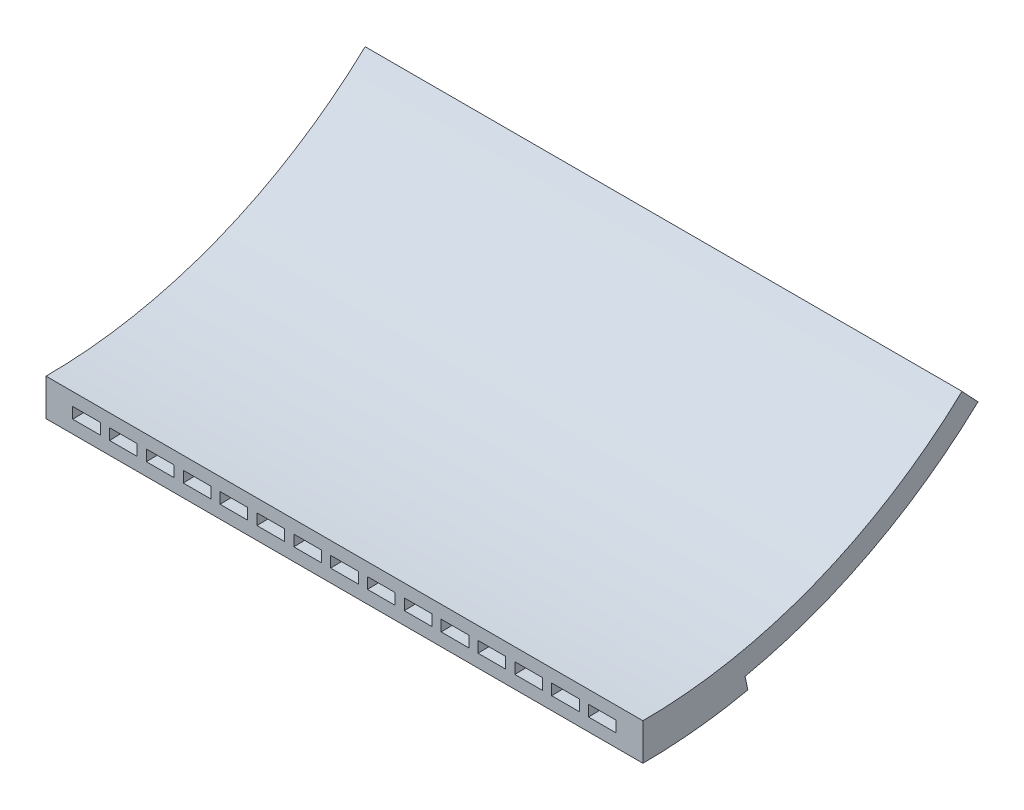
ISO-10303-21;
HEADER;
FILE_DESCRIPTION(('STEP AP214'),'2;1');
FILE_NAME('part.step','',(''),(''),'','','');
FILE_SCHEMA(('AUTOMOTIVE_DESIGN { 1 0 10303 214 1 1 1 1 }'));
ENDSEC;
DATA;
#1=APPLICATION_CONTEXT('core data for automotive mechanical design processes');
#2=APPLICATION_PROTOCOL_DEFINITION('international standard','automotive_design',2000,#1);
#3=PRODUCT_CONTEXT('',#1,'mechanical');
#4=PRODUCT('Part','Part','',(#3));
#5=PRODUCT_RELATED_PRODUCT_CATEGORY('part','',(#4));
#6=PRODUCT_DEFINITION_FORMATION('','',#4);
#7=PRODUCT_DEFINITION_CONTEXT('part definition',#1,'design');
#8=PRODUCT_DEFINITION('design','',#6,#7);
#9=PRODUCT_DEFINITION_SHAPE('','',#8);
#10=(LENGTH_UNIT() NAMED_UNIT(*) SI_UNIT(.MILLI.,.METRE.));
#11=(NAMED_UNIT(*) PLANE_ANGLE_UNIT() SI_UNIT($,.RADIAN.));
#12=(NAMED_UNIT(*) SI_UNIT($,.STERADIAN.) SOLID_ANGLE_UNIT());
#13=UNCERTAINTY_MEASURE_WITH_UNIT(LENGTH_MEASURE(1.E-05),#10,'distance_accuracy_value','');
#14=(GEOMETRIC_REPRESENTATION_CONTEXT(3) GLOBAL_UNCERTAINTY_ASSIGNED_CONTEXT((#13)) GLOBAL_UNIT_ASSIGNED_CONTEXT((#10,
#11,#12)) REPRESENTATION_CONTEXT('',''));
#15=CARTESIAN_POINT('',(0.,0.,0.));
#16=DIRECTION('',(0.,0.,1.));
#17=DIRECTION('',(1.,0.,0.));
#18=AXIS2_PLACEMENT_3D('',#15,#16,#17);
#19=CARTESIAN_POINT('',(96.6125,154.427341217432,-56.2069555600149));
#20=DIRECTION('',(1.,0.,0.));
#21=DIRECTION('',(0.,0.,-1.));
#22=AXIS2_PLACEMENT_3D('',#19,#20,#21);
#23=PLANE('',#22);
#24=CARTESIAN_POINT('',(96.6125,87.4425,0.));
#25=DIRECTION('',(1.,0.,0.));
#26=DIRECTION('',(0.,0.,-1.));
#27=AXIS2_PLACEMENT_3D('',#24,#25,#26);
#28=CIRCLE('',#27,87.3425);
#29=CARTESIAN_POINT('',(96.6125,2.0086431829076,-18.1595268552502));
#30=VERTEX_POINT('',#29);
#31=CARTESIAN_POINT('',(96.6125,23.5642393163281,-59.5674417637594));
#32=VERTEX_POINT('',#31);
#33=EDGE_CURVE('E53',#30,#32,#28,.T.);
#34=ORIENTED_EDGE('',*,*,#33,.F.);
#35=DIRECTION('',(0.,-0.978147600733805,-0.20791169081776));
#36=VECTOR('',#35,1.);
#37=CARTESIAN_POINT('',(96.6125,140.101055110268,11.1929214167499));
#38=LINE('',#37,#36);
#39=CARTESIAN_POINT('',(96.6125,1.91082842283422,-18.180318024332));
#40=VERTEX_POINT('',#39);
#41=EDGE_CURVE('E742',#30,#40,#38,.T.);
#42=ORIENTED_EDGE('',*,*,#41,.T.);
#43=CARTESIAN_POINT('',(96.6125,87.4425,0.));
#44=DIRECTION('',(-1.,0.,0.));
#45=DIRECTION('',(0.,0.,1.));
#46=AXIS2_PLACEMENT_3D('',#43,#44,#45);
#47=CIRCLE('',#46,87.4425);
#48=CARTESIAN_POINT('',(96.6125,0.,0.));
#49=VERTEX_POINT('',#48);
#50=EDGE_CURVE('E1294',#40,#49,#47,.T.);
#51=ORIENTED_EDGE('',*,*,#50,.T.);
#52=DIRECTION('',(0.,1.,0.));
#53=VECTOR('',#52,1.);
#54=CARTESIAN_POINT('',(96.6125,0.,0.));
#55=LINE('',#54,#53);
#56=CARTESIAN_POINT('',(96.6125,1.965,0.));
#57=VERTEX_POINT('',#56);
#58=EDGE_CURVE('E1161',#49,#57,#55,.T.);
#59=ORIENTED_EDGE('',*,*,#58,.T.);
#60=CARTESIAN_POINT('',(96.6125,87.4425,0.));
#61=DIRECTION('',(-1.,0.,0.));
#62=DIRECTION('',(0.,0.,1.));
#63=AXIS2_PLACEMENT_3D('',#60,#61,#62);
#64=CIRCLE('',#63,85.4775);
#65=CARTESIAN_POINT('',(96.6125,24.9282139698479,-58.2955148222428));
#66=VERTEX_POINT('',#65);
#67=EDGE_CURVE('E1296',#66,#57,#64,.T.);
#68=ORIENTED_EDGE('',*,*,#67,.F.);
#69=DIRECTION('',(0.,-0.731353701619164,-0.681998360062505));
#70=VECTOR('',#69,1.);
#71=CARTESIAN_POINT('',(96.6125,95.2362146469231,7.26775648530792));
#72=LINE('',#71,#70);
#73=EDGE_CURVE('E863',#66,#32,#72,.T.);
#74=ORIENTED_EDGE('',*,*,#73,.T.);
#75=EDGE_LOOP('',(#34,#42,#51,#59,#68,#74));
#76=FACE_BOUND('',#75,.T.);
#77=ADVANCED_FACE('F39',(#76),#23,.F.);
#78=CARTESIAN_POINT('',(85.15,154.427341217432,-56.2069555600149));
#79=DIRECTION('',(1.,0.,0.));
#80=DIRECTION('',(0.,0.,-1.));
#81=AXIS2_PLACEMENT_3D('',#78,#79,#80);
#82=PLANE('',#81);
#83=DIRECTION('',(0.,-0.978147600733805,-0.20791169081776));
#84=VECTOR('',#83,1.);
#85=CARTESIAN_POINT('',(85.15,140.101055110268,11.1929214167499));
#86=LINE('',#85,#84);
#87=CARTESIAN_POINT('',(85.15,2.0086431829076,-18.1595268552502));
#88=VERTEX_POINT('',#87);
#89=CARTESIAN_POINT('',(85.15,1.91082842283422,-18.180318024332));
#90=VERTEX_POINT('',#89);
#91=EDGE_CURVE('E847',#88,#90,#86,.T.);
#92=ORIENTED_EDGE('',*,*,#91,.F.);
#93=CARTESIAN_POINT('',(85.15,87.4425,0.));
#94=DIRECTION('',(1.,0.,0.));
#95=DIRECTION('',(0.,0.,-1.));
#96=AXIS2_PLACEMENT_3D('',#93,#94,#95);
#97=CIRCLE('',#96,87.3425);
#98=CARTESIAN_POINT('',(85.15,23.5642393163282,-59.5674417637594));
#99=VERTEX_POINT('',#98);
#100=EDGE_CURVE('E735',#88,#99,#97,.T.);
#101=ORIENTED_EDGE('',*,*,#100,.T.);
#102=DIRECTION('',(0.,-0.731353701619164,-0.681998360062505));
#103=VECTOR('',#102,1.);
#104=CARTESIAN_POINT('',(85.15,95.2362146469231,7.26775648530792));
#105=LINE('',#104,#103);
#106=CARTESIAN_POINT('',(85.15,24.9282139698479,-58.2955148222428));
#107=VERTEX_POINT('',#106);
#108=EDGE_CURVE('E975',#107,#99,#105,.T.);
#109=ORIENTED_EDGE('',*,*,#108,.F.);
#110=CARTESIAN_POINT('',(85.15,87.4425,0.));
#111=DIRECTION('',(-1.,0.,0.));
#112=DIRECTION('',(0.,0.,1.));
#113=AXIS2_PLACEMENT_3D('',#110,#111,#112);
#114=CIRCLE('',#113,85.4775);
#115=CARTESIAN_POINT('',(85.15,1.965,0.));
#116=VERTEX_POINT('',#115);
#117=EDGE_CURVE('E1286',#107,#116,#114,.T.);
#118=ORIENTED_EDGE('',*,*,#117,.T.);
#119=DIRECTION('',(0.,1.,0.));
#120=VECTOR('',#119,1.);
#121=CARTESIAN_POINT('',(85.15,0.,0.));
#122=LINE('',#121,#120);
#123=CARTESIAN_POINT('',(85.15,0.,0.));
#124=VERTEX_POINT('',#123);
#125=EDGE_CURVE('E1149',#124,#116,#122,.T.);
#126=ORIENTED_EDGE('',*,*,#125,.F.);
#127=CARTESIAN_POINT('',(85.15,87.4425,0.));
#128=DIRECTION('',(-1.,0.,0.));
#129=DIRECTION('',(0.,0.,1.));
#130=AXIS2_PLACEMENT_3D('',#127,#128,#129);
#131=CIRCLE('',#130,87.4425);
#132=EDGE_CURVE('E1288',#90,#124,#131,.T.);
#133=ORIENTED_EDGE('',*,*,#132,.F.);
#134=EDGE_LOOP('',(#92,#101,#109,#118,#126,#133));
#135=FACE_BOUND('',#134,.T.);
#136=ADVANCED_FACE('F1347',(#135),#82,.T.);
#137=CARTESIAN_POINT('',(78.6,154.427341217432,-56.2069555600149));
#138=DIRECTION('',(1.,0.,0.));
#139=DIRECTION('',(0.,0.,-1.));
#140=AXIS2_PLACEMENT_3D('',#137,#138,#139);
#141=PLANE('',#140);
#142=DIRECTION('',(0.,-0.978147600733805,-0.20791169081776));
#143=VECTOR('',#142,1.);
#144=CARTESIAN_POINT('',(78.6,140.101055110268,11.1929214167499));
#145=LINE('',#144,#143);
#146=CARTESIAN_POINT('',(78.6,2.0086431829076,-18.1595268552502));
#147=VERTEX_POINT('',#146);
#148=CARTESIAN_POINT('',(78.6,1.91082842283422,-18.180318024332));
#149=VERTEX_POINT('',#148);
#150=EDGE_CURVE('E839',#147,#149,#145,.T.);
#151=ORIENTED_EDGE('',*,*,#150,.F.);
#152=CARTESIAN_POINT('',(78.6,87.4425,0.));
#153=DIRECTION('',(1.,0.,0.));
#154=DIRECTION('',(0.,0.,-1.));
#155=AXIS2_PLACEMENT_3D('',#152,#153,#154);
#156=CIRCLE('',#155,87.3425);
#157=CARTESIAN_POINT('',(78.6,23.5642393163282,-59.5674417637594));
#158=VERTEX_POINT('',#157);
#159=EDGE_CURVE('E732',#147,#158,#156,.T.);
#160=ORIENTED_EDGE('',*,*,#159,.T.);
#161=DIRECTION('',(0.,-0.731353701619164,-0.681998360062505));
#162=VECTOR('',#161,1.);
#163=CARTESIAN_POINT('',(78.6,95.2362146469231,7.26775648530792));
#164=LINE('',#163,#162);
#165=CARTESIAN_POINT('',(78.6,24.9282139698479,-58.2955148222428));
#166=VERTEX_POINT('',#165);
#167=EDGE_CURVE('E967',#166,#158,#164,.T.);
#168=ORIENTED_EDGE('',*,*,#167,.F.);
#169=CARTESIAN_POINT('',(78.6,87.4425,0.));
#170=DIRECTION('',(-1.,0.,0.));
#171=DIRECTION('',(0.,0.,1.));
#172=AXIS2_PLACEMENT_3D('',#169,#170,#171);
#173=CIRCLE('',#172,85.4775);
#174=CARTESIAN_POINT('',(78.6,1.965,0.));
#175=VERTEX_POINT('',#174);
#176=EDGE_CURVE('E1278',#166,#175,#173,.T.);
#177=ORIENTED_EDGE('',*,*,#176,.T.);
#178=DIRECTION('',(0.,1.,0.));
#179=VECTOR('',#178,1.);
#180=CARTESIAN_POINT('',(78.6,0.,0.));
#181=LINE('',#180,#179);
#182=CARTESIAN_POINT('',(78.6,0.,0.));
#183=VERTEX_POINT('',#182);
#184=EDGE_CURVE('E1137',#183,#175,#181,.T.);
#185=ORIENTED_EDGE('',*,*,#184,.F.);
#186=CARTESIAN_POINT('',(78.6,87.4425,0.));
#187=DIRECTION('',(-1.,0.,0.));
#188=DIRECTION('',(0.,0.,1.));
#189=AXIS2_PLACEMENT_3D('',#186,#187,#188);
#190=CIRCLE('',#189,87.4425);
#191=EDGE_CURVE('E1280',#149,#183,#190,.T.);
#192=ORIENTED_EDGE('',*,*,#191,.F.);
#193=EDGE_LOOP('',(#151,#160,#168,#177,#185,#192));
#194=FACE_BOUND('',#193,.T.);
#195=ADVANCED_FACE('F1426',(#194),#141,.T.);
#196=CARTESIAN_POINT('',(72.05,154.427341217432,-56.2069555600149));
#197=DIRECTION('',(1.,0.,0.));
#198=DIRECTION('',(0.,0.,-1.));
#199=AXIS2_PLACEMENT_3D('',#196,#197,#198);
#200=PLANE('',#199);
#201=DIRECTION('',(0.,-0.978147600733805,-0.20791169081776));
#202=VECTOR('',#201,1.);
#203=CARTESIAN_POINT('',(72.05,140.101055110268,11.1929214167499));
#204=LINE('',#203,#202);
#205=CARTESIAN_POINT('',(72.05,2.0086431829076,-18.1595268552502));
#206=VERTEX_POINT('',#205);
#207=CARTESIAN_POINT('',(72.05,1.91082842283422,-18.180318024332));
#208=VERTEX_POINT('',#207);
#209=EDGE_CURVE('E831',#206,#208,#204,.T.);
#210=ORIENTED_EDGE('',*,*,#209,.F.);
#211=CARTESIAN_POINT('',(72.05,87.4425,0.));
#212=DIRECTION('',(1.,0.,0.));
#213=DIRECTION('',(0.,0.,-1.));
#214=AXIS2_PLACEMENT_3D('',#211,#212,#213);
#215=CIRCLE('',#214,87.3425);
#216=CARTESIAN_POINT('',(72.05,23.5642393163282,-59.5674417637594));
#217=VERTEX_POINT('',#216);
#218=EDGE_CURVE('E729',#206,#217,#215,.T.);
#219=ORIENTED_EDGE('',*,*,#218,.T.);
#220=DIRECTION('',(0.,-0.731353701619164,-0.681998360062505));
#221=VECTOR('',#220,1.);
#222=CARTESIAN_POINT('',(72.05,95.2362146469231,7.26775648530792));
#223=LINE('',#222,#221);
#224=CARTESIAN_POINT('',(72.05,24.9282139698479,-58.2955148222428));
#225=VERTEX_POINT('',#224);
#226=EDGE_CURVE('E959',#225,#217,#223,.T.);
#227=ORIENTED_EDGE('',*,*,#226,.F.);
#228=CARTESIAN_POINT('',(72.05,87.4425,0.));
#229=DIRECTION('',(-1.,0.,0.));
#230=DIRECTION('',(0.,0.,1.));
#231=AXIS2_PLACEMENT_3D('',#228,#229,#230);
#232=CIRCLE('',#231,85.4775);
#233=CARTESIAN_POINT('',(72.05,1.965,0.));
#234=VERTEX_POINT('',#233);
#235=EDGE_CURVE('E1270',#225,#234,#232,.T.);
#236=ORIENTED_EDGE('',*,*,#235,.T.);
#237=DIRECTION('',(0.,1.,0.));
#238=VECTOR('',#237,1.);
#239=CARTESIAN_POINT('',(72.05,0.,0.));
#240=LINE('',#239,#238);
#241=CARTESIAN_POINT('',(72.05,0.,0.));
#242=VERTEX_POINT('',#241);
#243=EDGE_CURVE('E1125',#242,#234,#240,.T.);
#244=ORIENTED_EDGE('',*,*,#243,.F.);
#245=CARTESIAN_POINT('',(72.05,87.4425,0.));
#246=DIRECTION('',(-1.,0.,0.));
#247=DIRECTION('',(0.,0.,1.));
#248=AXIS2_PLACEMENT_3D('',#245,#246,#247);
#249=CIRCLE('',#248,87.4425);
#250=EDGE_CURVE('E1272',#208,#242,#249,.T.);
#251=ORIENTED_EDGE('',*,*,#250,.F.);
#252=EDGE_LOOP('',(#210,#219,#227,#236,#244,#251));
#253=FACE_BOUND('',#252,.T.);
#254=ADVANCED_FACE('F1431',(#253),#200,.T.);
#255=CARTESIAN_POINT('',(65.5,154.427341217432,-56.2069555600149));
#256=DIRECTION('',(1.,0.,0.));
#257=DIRECTION('',(0.,0.,-1.));
#258=AXIS2_PLACEMENT_3D('',#255,#256,#257);
#259=PLANE('',#258);
#260=DIRECTION('',(0.,-0.978147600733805,-0.20791169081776));
#261=VECTOR('',#260,1.);
#262=CARTESIAN_POINT('',(65.5,140.101055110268,11.1929214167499));
#263=LINE('',#262,#261);
#264=CARTESIAN_POINT('',(65.5,2.0086431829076,-18.1595268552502));
#265=VERTEX_POINT('',#264);
#266=CARTESIAN_POINT('',(65.5,1.91082842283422,-18.180318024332));
#267=VERTEX_POINT('',#266);
#268=EDGE_CURVE('E823',#265,#267,#263,.T.);
#269=ORIENTED_EDGE('',*,*,#268,.F.);
#270=CARTESIAN_POINT('',(65.5,87.4425,0.));
#271=DIRECTION('',(1.,0.,0.));
#272=DIRECTION('',(0.,0.,-1.));
#273=AXIS2_PLACEMENT_3D('',#270,#271,#272);
#274=CIRCLE('',#273,87.3425);
#275=CARTESIAN_POINT('',(65.5,23.5642393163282,-59.5674417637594));
#276=VERTEX_POINT('',#275);
#277=EDGE_CURVE('E726',#265,#276,#274,.T.);
#278=ORIENTED_EDGE('',*,*,#277,.T.);
#279=DIRECTION('',(0.,-0.731353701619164,-0.681998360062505));
#280=VECTOR('',#279,1.);
#281=CARTESIAN_POINT('',(65.5,95.2362146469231,7.26775648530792));
#282=LINE('',#281,#280);
#283=CARTESIAN_POINT('',(65.5,24.9282139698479,-58.2955148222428));
#284=VERTEX_POINT('',#283);
#285=EDGE_CURVE('E951',#284,#276,#282,.T.);
#286=ORIENTED_EDGE('',*,*,#285,.F.);
#287=CARTESIAN_POINT('',(65.5,87.4425,0.));
#288=DIRECTION('',(-1.,0.,0.));
#289=DIRECTION('',(0.,0.,1.));
#290=AXIS2_PLACEMENT_3D('',#287,#288,#289);
#291=CIRCLE('',#290,85.4775);
#292=CARTESIAN_POINT('',(65.5,1.965,0.));
#293=VERTEX_POINT('',#292);
#294=EDGE_CURVE('E1262',#284,#293,#291,.T.);
#295=ORIENTED_EDGE('',*,*,#294,.T.);
#296=DIRECTION('',(0.,1.,0.));
#297=VECTOR('',#296,1.);
#298=CARTESIAN_POINT('',(65.5,0.,0.));
#299=LINE('',#298,#297);
#300=CARTESIAN_POINT('',(65.5,0.,0.));
#301=VERTEX_POINT('',#300);
#302=EDGE_CURVE('E1113',#301,#293,#299,.T.);
#303=ORIENTED_EDGE('',*,*,#302,.F.);
#304=CARTESIAN_POINT('',(65.5,87.4425,0.));
#305=DIRECTION('',(-1.,0.,0.));
#306=DIRECTION('',(0.,0.,1.));
#307=AXIS2_PLACEMENT_3D('',#304,#305,#306);
#308=CIRCLE('',#307,87.4425);
#309=EDGE_CURVE('E1264',#267,#301,#308,.T.);
#310=ORIENTED_EDGE('',*,*,#309,.F.);
#311=EDGE_LOOP('',(#269,#278,#286,#295,#303,#310));
#312=FACE_BOUND('',#311,.T.);
#313=ADVANCED_FACE('F1631',(#312),#259,.T.);
#314=CARTESIAN_POINT('',(58.95,154.427341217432,-56.2069555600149));
#315=DIRECTION('',(1.,0.,0.));
#316=DIRECTION('',(0.,0.,-1.));
#317=AXIS2_PLACEMENT_3D('',#314,#315,#316);
#318=PLANE('',#317);
#319=DIRECTION('',(0.,-0.978147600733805,-0.20791169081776));
#320=VECTOR('',#319,1.);
#321=CARTESIAN_POINT('',(58.95,140.101055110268,11.1929214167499));
#322=LINE('',#321,#320);
#323=CARTESIAN_POINT('',(58.95,2.0086431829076,-18.1595268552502));
#324=VERTEX_POINT('',#323);
#325=CARTESIAN_POINT('',(58.95,1.91082842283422,-18.180318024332));
#326=VERTEX_POINT('',#325);
#327=EDGE_CURVE('E815',#324,#326,#322,.T.);
#328=ORIENTED_EDGE('',*,*,#327,.F.);
#329=CARTESIAN_POINT('',(58.95,87.4425,0.));
#330=DIRECTION('',(1.,0.,0.));
#331=DIRECTION('',(0.,0.,-1.));
#332=AXIS2_PLACEMENT_3D('',#329,#330,#331);
#333=CIRCLE('',#332,87.3425);
#334=CARTESIAN_POINT('',(58.95,23.5642393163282,-59.5674417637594));
#335=VERTEX_POINT('',#334);
#336=EDGE_CURVE('E723',#324,#335,#333,.T.);
#337=ORIENTED_EDGE('',*,*,#336,.T.);
#338=DIRECTION('',(0.,-0.731353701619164,-0.681998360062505));
#339=VECTOR('',#338,1.);
#340=CARTESIAN_POINT('',(58.95,95.2362146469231,7.26775648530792));
#341=LINE('',#340,#339);
#342=CARTESIAN_POINT('',(58.95,24.9282139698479,-58.2955148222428));
#343=VERTEX_POINT('',#342);
#344=EDGE_CURVE('E943',#343,#335,#341,.T.);
#345=ORIENTED_EDGE('',*,*,#344,.F.);
#346=CARTESIAN_POINT('',(58.95,87.4425,0.));
#347=DIRECTION('',(-1.,0.,0.));
#348=DIRECTION('',(0.,0.,1.));
#349=AXIS2_PLACEMENT_3D('',#346,#347,#348);
#350=CIRCLE('',#349,85.4775);
#351=CARTESIAN_POINT('',(58.95,1.965,0.));
#352=VERTEX_POINT('',#351);
#353=EDGE_CURVE('E1254',#343,#352,#350,.T.);
#354=ORIENTED_EDGE('',*,*,#353,.T.);
#355=DIRECTION('',(0.,1.,0.));
#356=VECTOR('',#355,1.);
#357=CARTESIAN_POINT('',(58.95,0.,0.));
#358=LINE('',#357,#356);
#359=CARTESIAN_POINT('',(58.95,0.,0.));
#360=VERTEX_POINT('',#359);
#361=EDGE_CURVE('E1101',#360,#352,#358,.T.);
#362=ORIENTED_EDGE('',*,*,#361,.F.);
#363=CARTESIAN_POINT('',(58.95,87.4425,0.));
#364=DIRECTION('',(-1.,0.,0.));
#365=DIRECTION('',(0.,0.,1.));
#366=AXIS2_PLACEMENT_3D('',#363,#364,#365);
#367=CIRCLE('',#366,87.4425);
#368=EDGE_CURVE('E1256',#326,#360,#367,.T.);
#369=ORIENTED_EDGE('',*,*,#368,.F.);
#370=EDGE_LOOP('',(#328,#337,#345,#354,#362,#369));
#371=FACE_BOUND('',#370,.T.);
#372=ADVANCED_FACE('F1615',(#371),#318,.T.);
#373=CARTESIAN_POINT('',(52.4,154.427341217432,-56.2069555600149));
#374=DIRECTION('',(1.,0.,0.));
#375=DIRECTION('',(0.,0.,-1.));
#376=AXIS2_PLACEMENT_3D('',#373,#374,#375);
#377=PLANE('',#376);
#378=DIRECTION('',(0.,-0.978147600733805,-0.20791169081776));
#379=VECTOR('',#378,1.);
#380=CARTESIAN_POINT('',(52.4,140.101055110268,11.1929214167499));
#381=LINE('',#380,#379);
#382=CARTESIAN_POINT('',(52.4,2.0086431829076,-18.1595268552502));
#383=VERTEX_POINT('',#382);
#384=CARTESIAN_POINT('',(52.4,1.91082842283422,-18.180318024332));
#385=VERTEX_POINT('',#384);
#386=EDGE_CURVE('E807',#383,#385,#381,.T.);
#387=ORIENTED_EDGE('',*,*,#386,.F.);
#388=CARTESIAN_POINT('',(52.4,87.4425,0.));
#389=DIRECTION('',(1.,0.,0.));
#390=DIRECTION('',(0.,0.,-1.));
#391=AXIS2_PLACEMENT_3D('',#388,#389,#390);
#392=CIRCLE('',#391,87.3425);
#393=CARTESIAN_POINT('',(52.4,23.5642393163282,-59.5674417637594));
#394=VERTEX_POINT('',#393);
#395=EDGE_CURVE('E720',#383,#394,#392,.T.);
#396=ORIENTED_EDGE('',*,*,#395,.T.);
#397=DIRECTION('',(0.,-0.731353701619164,-0.681998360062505));
#398=VECTOR('',#397,1.);
#399=CARTESIAN_POINT('',(52.4,95.2362146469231,7.26775648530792));
#400=LINE('',#399,#398);
#401=CARTESIAN_POINT('',(52.4,24.9282139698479,-58.2955148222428));
#402=VERTEX_POINT('',#401);
#403=EDGE_CURVE('E935',#402,#394,#400,.T.);
#404=ORIENTED_EDGE('',*,*,#403,.F.);
#405=CARTESIAN_POINT('',(52.4,87.4425,0.));
#406=DIRECTION('',(-1.,0.,0.));
#407=DIRECTION('',(0.,0.,1.));
#408=AXIS2_PLACEMENT_3D('',#405,#406,#407);
#409=CIRCLE('',#408,85.4775);
#410=CARTESIAN_POINT('',(52.4,1.965,0.));
#411=VERTEX_POINT('',#410);
#412=EDGE_CURVE('E1246',#402,#411,#409,.T.);
#413=ORIENTED_EDGE('',*,*,#412,.T.);
#414=DIRECTION('',(0.,1.,0.));
#415=VECTOR('',#414,1.);
#416=CARTESIAN_POINT('',(52.4,0.,0.));
#417=LINE('',#416,#415);
#418=CARTESIAN_POINT('',(52.4,0.,0.));
#419=VERTEX_POINT('',#418);
#420=EDGE_CURVE('E1089',#419,#411,#417,.T.);
#421=ORIENTED_EDGE('',*,*,#420,.F.);
#422=CARTESIAN_POINT('',(52.4,87.4425,0.));
#423=DIRECTION('',(-1.,0.,0.));
#424=DIRECTION('',(0.,0.,1.));
#425=AXIS2_PLACEMENT_3D('',#422,#423,#424);
#426=CIRCLE('',#425,87.4425);
#427=EDGE_CURVE('E1248',#385,#419,#426,.T.);
#428=ORIENTED_EDGE('',*,*,#427,.F.);
#429=EDGE_LOOP('',(#387,#396,#404,#413,#421,#428));
#430=FACE_BOUND('',#429,.T.);
#431=ADVANCED_FACE('F1599',(#430),#377,.T.);
#432=CARTESIAN_POINT('',(45.85,154.427341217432,-56.2069555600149));
#433=DIRECTION('',(1.,0.,0.));
#434=DIRECTION('',(0.,0.,-1.));
#435=AXIS2_PLACEMENT_3D('',#432,#433,#434);
#436=PLANE('',#435);
#437=DIRECTION('',(0.,-0.978147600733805,-0.20791169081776));
#438=VECTOR('',#437,1.);
#439=CARTESIAN_POINT('',(45.85,140.101055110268,11.1929214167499));
#440=LINE('',#439,#438);
#441=CARTESIAN_POINT('',(45.85,2.0086431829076,-18.1595268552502));
#442=VERTEX_POINT('',#441);
#443=CARTESIAN_POINT('',(45.85,1.91082842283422,-18.180318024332));
#444=VERTEX_POINT('',#443);
#445=EDGE_CURVE('E799',#442,#444,#440,.T.);
#446=ORIENTED_EDGE('',*,*,#445,.F.);
#447=CARTESIAN_POINT('',(45.85,87.4425,0.));
#448=DIRECTION('',(1.,0.,0.));
#449=DIRECTION('',(0.,0.,-1.));
#450=AXIS2_PLACEMENT_3D('',#447,#448,#449);
#451=CIRCLE('',#450,87.3425);
#452=CARTESIAN_POINT('',(45.85,23.5642393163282,-59.5674417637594));
#453=VERTEX_POINT('',#452);
#454=EDGE_CURVE('E717',#442,#453,#451,.T.);
#455=ORIENTED_EDGE('',*,*,#454,.T.);
#456=DIRECTION('',(0.,-0.731353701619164,-0.681998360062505));
#457=VECTOR('',#456,1.);
#458=CARTESIAN_POINT('',(45.85,95.2362146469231,7.26775648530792));
#459=LINE('',#458,#457);
#460=CARTESIAN_POINT('',(45.85,24.9282139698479,-58.2955148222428));
#461=VERTEX_POINT('',#460);
#462=EDGE_CURVE('E927',#461,#453,#459,.T.);
#463=ORIENTED_EDGE('',*,*,#462,.F.);
#464=CARTESIAN_POINT('',(45.85,87.4425,0.));
#465=DIRECTION('',(-1.,0.,0.));
#466=DIRECTION('',(0.,0.,1.));
#467=AXIS2_PLACEMENT_3D('',#464,#465,#466);
#468=CIRCLE('',#467,85.4775);
#469=CARTESIAN_POINT('',(45.85,1.965,0.));
#470=VERTEX_POINT('',#469);
#471=EDGE_CURVE('E1238',#461,#470,#468,.T.);
#472=ORIENTED_EDGE('',*,*,#471,.T.);
#473=DIRECTION('',(0.,1.,0.));
#474=VECTOR('',#473,1.);
#475=CARTESIAN_POINT('',(45.85,0.,0.));
#476=LINE('',#475,#474);
#477=CARTESIAN_POINT('',(45.85,0.,0.));
#478=VERTEX_POINT('',#477);
#479=EDGE_CURVE('E1077',#478,#470,#476,.T.);
#480=ORIENTED_EDGE('',*,*,#479,.F.);
#481=CARTESIAN_POINT('',(45.85,87.4425,0.));
#482=DIRECTION('',(-1.,0.,0.));
#483=DIRECTION('',(0.,0.,1.));
#484=AXIS2_PLACEMENT_3D('',#481,#482,#483);
#485=CIRCLE('',#484,87.4425);
#486=EDGE_CURVE('E1240',#444,#478,#485,.T.);
#487=ORIENTED_EDGE('',*,*,#486,.F.);
#488=EDGE_LOOP('',(#446,#455,#463,#472,#480,#487));
#489=FACE_BOUND('',#488,.T.);
#490=ADVANCED_FACE('F1583',(#489),#436,.T.);
#491=CARTESIAN_POINT('',(39.3,154.427341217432,-56.2069555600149));
#492=DIRECTION('',(1.,0.,0.));
#493=DIRECTION('',(0.,0.,-1.));
#494=AXIS2_PLACEMENT_3D('',#491,#492,#493);
#495=PLANE('',#494);
#496=DIRECTION('',(0.,-0.978147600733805,-0.20791169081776));
#497=VECTOR('',#496,1.);
#498=CARTESIAN_POINT('',(39.3,140.101055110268,11.1929214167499));
#499=LINE('',#498,#497);
#500=CARTESIAN_POINT('',(39.3,2.0086431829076,-18.1595268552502));
#501=VERTEX_POINT('',#500);
#502=CARTESIAN_POINT('',(39.3,1.91082842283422,-18.180318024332));
#503=VERTEX_POINT('',#502);
#504=EDGE_CURVE('E791',#501,#503,#499,.T.);
#505=ORIENTED_EDGE('',*,*,#504,.F.);
#506=CARTESIAN_POINT('',(39.3,87.4425,0.));
#507=DIRECTION('',(1.,0.,0.));
#508=DIRECTION('',(0.,0.,-1.));
#509=AXIS2_PLACEMENT_3D('',#506,#507,#508);
#510=CIRCLE('',#509,87.3425);
#511=CARTESIAN_POINT('',(39.3,23.5642393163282,-59.5674417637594));
#512=VERTEX_POINT('',#511);
#513=EDGE_CURVE('E714',#501,#512,#510,.T.);
#514=ORIENTED_EDGE('',*,*,#513,.T.);
#515=DIRECTION('',(0.,-0.731353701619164,-0.681998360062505));
#516=VECTOR('',#515,1.);
#517=CARTESIAN_POINT('',(39.3,95.2362146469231,7.26775648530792));
#518=LINE('',#517,#516);
#519=CARTESIAN_POINT('',(39.3,24.9282139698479,-58.2955148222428));
#520=VERTEX_POINT('',#519);
#521=EDGE_CURVE('E919',#520,#512,#518,.T.);
#522=ORIENTED_EDGE('',*,*,#521,.F.);
#523=CARTESIAN_POINT('',(39.3,87.4425,0.));
#524=DIRECTION('',(-1.,0.,0.));
#525=DIRECTION('',(0.,0.,1.));
#526=AXIS2_PLACEMENT_3D('',#523,#524,#525);
#527=CIRCLE('',#526,85.4775);
#528=CARTESIAN_POINT('',(39.3,1.965,0.));
#529=VERTEX_POINT('',#528);
#530=EDGE_CURVE('E1230',#520,#529,#527,.T.);
#531=ORIENTED_EDGE('',*,*,#530,.T.);
#532=DIRECTION('',(0.,1.,0.));
#533=VECTOR('',#532,1.);
#534=CARTESIAN_POINT('',(39.3,0.,0.));
#535=LINE('',#534,#533);
#536=CARTESIAN_POINT('',(39.3,0.,0.));
#537=VERTEX_POINT('',#536);
#538=EDGE_CURVE('E1065',#537,#529,#535,.T.);
#539=ORIENTED_EDGE('',*,*,#538,.F.);
#540=CARTESIAN_POINT('',(39.3,87.4425,0.));
#541=DIRECTION('',(-1.,0.,0.));
#542=DIRECTION('',(0.,0.,1.));
#543=AXIS2_PLACEMENT_3D('',#540,#541,#542);
#544=CIRCLE('',#543,87.4425);
#545=EDGE_CURVE('E1232',#503,#537,#544,.T.);
#546=ORIENTED_EDGE('',*,*,#545,.F.);
#547=EDGE_LOOP('',(#505,#514,#522,#531,#539,#546));
#548=FACE_BOUND('',#547,.T.);
#549=ADVANCED_FACE('F1567',(#548),#495,.T.);
#550=CARTESIAN_POINT('',(32.75,154.427341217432,-56.2069555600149));
#551=DIRECTION('',(1.,0.,0.));
#552=DIRECTION('',(0.,0.,-1.));
#553=AXIS2_PLACEMENT_3D('',#550,#551,#552);
#554=PLANE('',#553);
#555=DIRECTION('',(0.,-0.978147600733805,-0.20791169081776));
#556=VECTOR('',#555,1.);
#557=CARTESIAN_POINT('',(32.75,140.101055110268,11.1929214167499));
#558=LINE('',#557,#556);
#559=CARTESIAN_POINT('',(32.75,2.0086431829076,-18.1595268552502));
#560=VERTEX_POINT('',#559);
#561=CARTESIAN_POINT('',(32.75,1.91082842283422,-18.180318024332));
#562=VERTEX_POINT('',#561);
#563=EDGE_CURVE('E783',#560,#562,#558,.T.);
#564=ORIENTED_EDGE('',*,*,#563,.F.);
#565=CARTESIAN_POINT('',(32.75,87.4425,0.));
#566=DIRECTION('',(1.,0.,0.));
#567=DIRECTION('',(0.,0.,-1.));
#568=AXIS2_PLACEMENT_3D('',#565,#566,#567);
#569=CIRCLE('',#568,87.3425);
#570=CARTESIAN_POINT('',(32.75,23.5642393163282,-59.5674417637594));
#571=VERTEX_POINT('',#570);
#572=EDGE_CURVE('E711',#560,#571,#569,.T.);
#573=ORIENTED_EDGE('',*,*,#572,.T.);
#574=DIRECTION('',(0.,-0.731353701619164,-0.681998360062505));
#575=VECTOR('',#574,1.);
#576=CARTESIAN_POINT('',(32.75,95.2362146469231,7.26775648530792));
#577=LINE('',#576,#575);
#578=CARTESIAN_POINT('',(32.75,24.9282139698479,-58.2955148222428));
#579=VERTEX_POINT('',#578);
#580=EDGE_CURVE('E911',#579,#571,#577,.T.);
#581=ORIENTED_EDGE('',*,*,#580,.F.);
#582=CARTESIAN_POINT('',(32.75,87.4425,0.));
#583=DIRECTION('',(-1.,0.,0.));
#584=DIRECTION('',(0.,0.,1.));
#585=AXIS2_PLACEMENT_3D('',#582,#583,#584);
#586=CIRCLE('',#585,85.4775);
#587=CARTESIAN_POINT('',(32.75,1.965,0.));
#588=VERTEX_POINT('',#587);
#589=EDGE_CURVE('E1222',#579,#588,#586,.T.);
#590=ORIENTED_EDGE('',*,*,#589,.T.);
#591=DIRECTION('',(0.,1.,0.));
#592=VECTOR('',#591,1.);
#593=CARTESIAN_POINT('',(32.75,0.,0.));
#594=LINE('',#593,#592);
#595=CARTESIAN_POINT('',(32.75,0.,0.));
#596=VERTEX_POINT('',#595);
#597=EDGE_CURVE('E1053',#596,#588,#594,.T.);
#598=ORIENTED_EDGE('',*,*,#597,.F.);
#599=CARTESIAN_POINT('',(32.75,87.4425,0.));
#600=DIRECTION('',(-1.,0.,0.));
#601=DIRECTION('',(0.,0.,1.));
#602=AXIS2_PLACEMENT_3D('',#599,#600,#601);
#603=CIRCLE('',#602,87.4425);
#604=EDGE_CURVE('E1224',#562,#596,#603,.T.);
#605=ORIENTED_EDGE('',*,*,#604,.F.);
#606=EDGE_LOOP('',(#564,#573,#581,#590,#598,#605));
#607=FACE_BOUND('',#606,.T.);
#608=ADVANCED_FACE('F1551',(#607),#554,.T.);
#609=CARTESIAN_POINT('',(26.2,154.427341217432,-56.2069555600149));
#610=DIRECTION('',(1.,0.,0.));
#611=DIRECTION('',(0.,0.,-1.));
#612=AXIS2_PLACEMENT_3D('',#609,#610,#611);
#613=PLANE('',#612);
#614=DIRECTION('',(0.,-0.978147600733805,-0.20791169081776));
#615=VECTOR('',#614,1.);
#616=CARTESIAN_POINT('',(26.2,140.101055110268,11.1929214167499));
#617=LINE('',#616,#615);
#618=CARTESIAN_POINT('',(26.2,2.0086431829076,-18.1595268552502));
#619=VERTEX_POINT('',#618);
#620=CARTESIAN_POINT('',(26.2,1.91082842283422,-18.180318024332));
#621=VERTEX_POINT('',#620);
#622=EDGE_CURVE('E775',#619,#621,#617,.T.);
#623=ORIENTED_EDGE('',*,*,#622,.F.);
#624=CARTESIAN_POINT('',(26.2,87.4425,0.));
#625=DIRECTION('',(1.,0.,0.));
#626=DIRECTION('',(0.,0.,-1.));
#627=AXIS2_PLACEMENT_3D('',#624,#625,#626);
#628=CIRCLE('',#627,87.3425);
#629=CARTESIAN_POINT('',(26.2,23.5642393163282,-59.5674417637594));
#630=VERTEX_POINT('',#629);
#631=EDGE_CURVE('E708',#619,#630,#628,.T.);
#632=ORIENTED_EDGE('',*,*,#631,.T.);
#633=DIRECTION('',(0.,-0.731353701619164,-0.681998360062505));
#634=VECTOR('',#633,1.);
#635=CARTESIAN_POINT('',(26.2,95.2362146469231,7.26775648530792));
#636=LINE('',#635,#634);
#637=CARTESIAN_POINT('',(26.2,24.9282139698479,-58.2955148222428));
#638=VERTEX_POINT('',#637);
#639=EDGE_CURVE('E903',#638,#630,#636,.T.);
#640=ORIENTED_EDGE('',*,*,#639,.F.);
#641=CARTESIAN_POINT('',(26.2,87.4425,0.));
#642=DIRECTION('',(-1.,0.,0.));
#643=DIRECTION('',(0.,0.,1.));
#644=AXIS2_PLACEMENT_3D('',#641,#642,#643);
#645=CIRCLE('',#644,85.4775);
#646=CARTESIAN_POINT('',(26.2,1.965,0.));
#647=VERTEX_POINT('',#646);
#648=EDGE_CURVE('E1214',#638,#647,#645,.T.);
#649=ORIENTED_EDGE('',*,*,#648,.T.);
#650=DIRECTION('',(0.,1.,0.));
#651=VECTOR('',#650,1.);
#652=CARTESIAN_POINT('',(26.2,0.,0.));
#653=LINE('',#652,#651);
#654=CARTESIAN_POINT('',(26.2,0.,0.));
#655=VERTEX_POINT('',#654);
#656=EDGE_CURVE('E1041',#655,#647,#653,.T.);
#657=ORIENTED_EDGE('',*,*,#656,.F.);
#658=CARTESIAN_POINT('',(26.2,87.4425,0.));
#659=DIRECTION('',(-1.,0.,0.));
#660=DIRECTION('',(0.,0.,1.));
#661=AXIS2_PLACEMENT_3D('',#658,#659,#660);
#662=CIRCLE('',#661,87.4425);
#663=EDGE_CURVE('E1216',#621,#655,#662,.T.);
#664=ORIENTED_EDGE('',*,*,#663,.F.);
#665=EDGE_LOOP('',(#623,#632,#640,#649,#657,#664));
#666=FACE_BOUND('',#665,.T.);
#667=ADVANCED_FACE('F1535',(#666),#613,.T.);
#668=CARTESIAN_POINT('',(19.65,154.427341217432,-56.2069555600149));
#669=DIRECTION('',(1.,0.,0.));
#670=DIRECTION('',(0.,0.,-1.));
#671=AXIS2_PLACEMENT_3D('',#668,#669,#670);
#672=PLANE('',#671);
#673=DIRECTION('',(0.,-0.978147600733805,-0.20791169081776));
#674=VECTOR('',#673,1.);
#675=CARTESIAN_POINT('',(19.65,140.101055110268,11.1929214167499));
#676=LINE('',#675,#674);
#677=CARTESIAN_POINT('',(19.65,2.0086431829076,-18.1595268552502));
#678=VERTEX_POINT('',#677);
#679=CARTESIAN_POINT('',(19.65,1.91082842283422,-18.180318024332));
#680=VERTEX_POINT('',#679);
#681=EDGE_CURVE('E767',#678,#680,#676,.T.);
#682=ORIENTED_EDGE('',*,*,#681,.F.);
#683=CARTESIAN_POINT('',(19.65,87.4425,0.));
#684=DIRECTION('',(1.,0.,0.));
#685=DIRECTION('',(0.,0.,-1.));
#686=AXIS2_PLACEMENT_3D('',#683,#684,#685);
#687=CIRCLE('',#686,87.3425);
#688=CARTESIAN_POINT('',(19.65,23.5642393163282,-59.5674417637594));
#689=VERTEX_POINT('',#688);
#690=EDGE_CURVE('E705',#678,#689,#687,.T.);
#691=ORIENTED_EDGE('',*,*,#690,.T.);
#692=DIRECTION('',(0.,-0.731353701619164,-0.681998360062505));
#693=VECTOR('',#692,1.);
#694=CARTESIAN_POINT('',(19.65,95.2362146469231,7.26775648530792));
#695=LINE('',#694,#693);
#696=CARTESIAN_POINT('',(19.65,24.9282139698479,-58.2955148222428));
#697=VERTEX_POINT('',#696);
#698=EDGE_CURVE('E895',#697,#689,#695,.T.);
#699=ORIENTED_EDGE('',*,*,#698,.F.);
#700=CARTESIAN_POINT('',(19.65,87.4425,0.));
#701=DIRECTION('',(-1.,0.,0.));
#702=DIRECTION('',(0.,0.,1.));
#703=AXIS2_PLACEMENT_3D('',#700,#701,#702);
#704=CIRCLE('',#703,85.4775);
#705=CARTESIAN_POINT('',(19.65,1.965,0.));
#706=VERTEX_POINT('',#705);
#707=EDGE_CURVE('E1206',#697,#706,#704,.T.);
#708=ORIENTED_EDGE('',*,*,#707,.T.);
#709=DIRECTION('',(0.,1.,0.));
#710=VECTOR('',#709,1.);
#711=CARTESIAN_POINT('',(19.65,0.,0.));
#712=LINE('',#711,#710);
#713=CARTESIAN_POINT('',(19.65,0.,0.));
#714=VERTEX_POINT('',#713);
#715=EDGE_CURVE('E1029',#714,#706,#712,.T.);
#716=ORIENTED_EDGE('',*,*,#715,.F.);
#717=CARTESIAN_POINT('',(19.65,87.4425,0.));
#718=DIRECTION('',(-1.,0.,0.));
#719=DIRECTION('',(0.,0.,1.));
#720=AXIS2_PLACEMENT_3D('',#717,#718,#719);
#721=CIRCLE('',#720,87.4425);
#722=EDGE_CURVE('E1208',#680,#714,#721,.T.);
#723=ORIENTED_EDGE('',*,*,#722,.F.);
#724=EDGE_LOOP('',(#682,#691,#699,#708,#716,#723));
#725=FACE_BOUND('',#724,.T.);
#726=ADVANCED_FACE('F1519',(#725),#672,.T.);
#727=CARTESIAN_POINT('',(13.1,154.427341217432,-56.2069555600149));
#728=DIRECTION('',(1.,0.,0.));
#729=DIRECTION('',(0.,0.,-1.));
#730=AXIS2_PLACEMENT_3D('',#727,#728,#729);
#731=PLANE('',#730);
#732=DIRECTION('',(0.,-0.978147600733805,-0.20791169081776));
#733=VECTOR('',#732,1.);
#734=CARTESIAN_POINT('',(13.1,140.101055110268,11.1929214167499));
#735=LINE('',#734,#733);
#736=CARTESIAN_POINT('',(13.1,2.0086431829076,-18.1595268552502));
#737=VERTEX_POINT('',#736);
#738=CARTESIAN_POINT('',(13.1,1.91082842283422,-18.180318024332));
#739=VERTEX_POINT('',#738);
#740=EDGE_CURVE('E759',#737,#739,#735,.T.);
#741=ORIENTED_EDGE('',*,*,#740,.F.);
#742=CARTESIAN_POINT('',(13.1,87.4425,0.));
#743=DIRECTION('',(1.,0.,0.));
#744=DIRECTION('',(0.,0.,-1.));
#745=AXIS2_PLACEMENT_3D('',#742,#743,#744);
#746=CIRCLE('',#745,87.3425);
#747=CARTESIAN_POINT('',(13.1,23.5642393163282,-59.5674417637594));
#748=VERTEX_POINT('',#747);
#749=EDGE_CURVE('E702',#737,#748,#746,.T.);
#750=ORIENTED_EDGE('',*,*,#749,.T.);
#751=DIRECTION('',(0.,-0.731353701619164,-0.681998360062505));
#752=VECTOR('',#751,1.);
#753=CARTESIAN_POINT('',(13.1,95.2362146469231,7.26775648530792));
#754=LINE('',#753,#752);
#755=CARTESIAN_POINT('',(13.1,24.9282139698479,-58.2955148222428));
#756=VERTEX_POINT('',#755);
#757=EDGE_CURVE('E887',#756,#748,#754,.T.);
#758=ORIENTED_EDGE('',*,*,#757,.F.);
#759=CARTESIAN_POINT('',(13.1,87.4425,0.));
#760=DIRECTION('',(-1.,0.,0.));
#761=DIRECTION('',(0.,0.,1.));
#762=AXIS2_PLACEMENT_3D('',#759,#760,#761);
#763=CIRCLE('',#762,85.4775);
#764=CARTESIAN_POINT('',(13.1,1.965,0.));
#765=VERTEX_POINT('',#764);
#766=EDGE_CURVE('E1198',#756,#765,#763,.T.);
#767=ORIENTED_EDGE('',*,*,#766,.T.);
#768=DIRECTION('',(0.,1.,0.));
#769=VECTOR('',#768,1.);
#770=CARTESIAN_POINT('',(13.1,0.,0.));
#771=LINE('',#770,#769);
#772=CARTESIAN_POINT('',(13.1,0.,0.));
#773=VERTEX_POINT('',#772);
#774=EDGE_CURVE('E1017',#773,#765,#771,.T.);
#775=ORIENTED_EDGE('',*,*,#774,.F.);
#776=CARTESIAN_POINT('',(13.1,87.4425,0.));
#777=DIRECTION('',(-1.,0.,0.));
#778=DIRECTION('',(0.,0.,1.));
#779=AXIS2_PLACEMENT_3D('',#776,#777,#778);
#780=CIRCLE('',#779,87.4425);
#781=EDGE_CURVE('E1200',#739,#773,#780,.T.);
#782=ORIENTED_EDGE('',*,*,#781,.F.);
#783=EDGE_LOOP('',(#741,#750,#758,#767,#775,#782));
#784=FACE_BOUND('',#783,.T.);
#785=ADVANCED_FACE('F1503',(#784),#731,.T.);
#786=CARTESIAN_POINT('',(6.55,154.427341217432,-56.2069555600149));
#787=DIRECTION('',(1.,0.,0.));
#788=DIRECTION('',(0.,0.,-1.));
#789=AXIS2_PLACEMENT_3D('',#786,#787,#788);
#790=PLANE('',#789);
#791=DIRECTION('',(0.,-0.978147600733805,-0.20791169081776));
#792=VECTOR('',#791,1.);
#793=CARTESIAN_POINT('',(6.55,140.101055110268,11.1929214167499));
#794=LINE('',#793,#792);
#795=CARTESIAN_POINT('',(6.55,2.0086431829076,-18.1595268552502));
#796=VERTEX_POINT('',#795);
#797=CARTESIAN_POINT('',(6.55,1.91082842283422,-18.180318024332));
#798=VERTEX_POINT('',#797);
#799=EDGE_CURVE('E751',#796,#798,#794,.T.);
#800=ORIENTED_EDGE('',*,*,#799,.F.);
#801=CARTESIAN_POINT('',(6.55,87.4425,0.));
#802=DIRECTION('',(1.,0.,0.));
#803=DIRECTION('',(0.,0.,-1.));
#804=AXIS2_PLACEMENT_3D('',#801,#802,#803);
#805=CIRCLE('',#804,87.3425);
#806=CARTESIAN_POINT('',(6.55,23.5642393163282,-59.5674417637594));
#807=VERTEX_POINT('',#806);
#808=EDGE_CURVE('E699',#796,#807,#805,.T.);
#809=ORIENTED_EDGE('',*,*,#808,.T.);
#810=DIRECTION('',(0.,-0.731353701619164,-0.681998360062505));
#811=VECTOR('',#810,1.);
#812=CARTESIAN_POINT('',(6.55,95.2362146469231,7.26775648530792));
#813=LINE('',#812,#811);
#814=CARTESIAN_POINT('',(6.55,24.9282139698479,-58.2955148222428));
#815=VERTEX_POINT('',#814);
#816=EDGE_CURVE('E879',#815,#807,#813,.T.);
#817=ORIENTED_EDGE('',*,*,#816,.F.);
#818=CARTESIAN_POINT('',(6.55,87.4425,0.));
#819=DIRECTION('',(-1.,0.,0.));
#820=DIRECTION('',(0.,0.,1.));
#821=AXIS2_PLACEMENT_3D('',#818,#819,#820);
#822=CIRCLE('',#821,85.4775);
#823=CARTESIAN_POINT('',(6.55,1.965,0.));
#824=VERTEX_POINT('',#823);
#825=EDGE_CURVE('E1190',#815,#824,#822,.T.);
#826=ORIENTED_EDGE('',*,*,#825,.T.);
#827=DIRECTION('',(0.,1.,0.));
#828=VECTOR('',#827,1.);
#829=CARTESIAN_POINT('',(6.55,0.,0.));
#830=LINE('',#829,#828);
#831=CARTESIAN_POINT('',(6.55,0.,0.));
#832=VERTEX_POINT('',#831);
#833=EDGE_CURVE('E1005',#832,#824,#830,.T.);
#834=ORIENTED_EDGE('',*,*,#833,.F.);
#835=CARTESIAN_POINT('',(6.55,87.4425,0.));
#836=DIRECTION('',(-1.,0.,0.));
#837=DIRECTION('',(0.,0.,1.));
#838=AXIS2_PLACEMENT_3D('',#835,#836,#837);
#839=CIRCLE('',#838,87.4425);
#840=EDGE_CURVE('E1192',#798,#832,#839,.T.);
#841=ORIENTED_EDGE('',*,*,#840,.F.);
#842=EDGE_LOOP('',(#800,#809,#817,#826,#834,#841));
#843=FACE_BOUND('',#842,.T.);
#844=ADVANCED_FACE('F1477',(#843),#790,.T.);
#845=CARTESIAN_POINT('',(4.9125,154.427341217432,-56.2069555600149));
#846=DIRECTION('',(1.,0.,0.));
#847=DIRECTION('',(0.,0.,-1.));
#848=AXIS2_PLACEMENT_3D('',#845,#846,#847);
#849=PLANE('',#848);
#850=CARTESIAN_POINT('',(4.9125,87.4425,0.));
#851=DIRECTION('',(1.,0.,0.));
#852=DIRECTION('',(0.,0.,-1.));
#853=AXIS2_PLACEMENT_3D('',#850,#851,#852);
#854=CIRCLE('',#853,87.3425);
#855=CARTESIAN_POINT('',(4.9125,2.0086431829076,-18.1595268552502));
#856=VERTEX_POINT('',#855);
#857=CARTESIAN_POINT('',(4.9125,23.5642393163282,-59.5674417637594));
#858=VERTEX_POINT('',#857);
#859=EDGE_CURVE('E697',#856,#858,#854,.T.);
#860=ORIENTED_EDGE('',*,*,#859,.F.);
#861=DIRECTION('',(0.,-0.978147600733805,-0.20791169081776));
#862=VECTOR('',#861,1.);
#863=CARTESIAN_POINT('',(4.9125,140.101055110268,11.1929214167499));
#864=LINE('',#863,#862);
#865=CARTESIAN_POINT('',(4.9125,1.91082842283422,-18.180318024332));
#866=VERTEX_POINT('',#865);
#867=EDGE_CURVE('E854',#856,#866,#864,.T.);
#868=ORIENTED_EDGE('',*,*,#867,.T.);
#869=CARTESIAN_POINT('',(4.9125,87.4425,0.));
#870=DIRECTION('',(-1.,0.,0.));
#871=DIRECTION('',(0.,0.,1.));
#872=AXIS2_PLACEMENT_3D('',#869,#870,#871);
#873=CIRCLE('',#872,87.4425);
#874=CARTESIAN_POINT('',(4.9125,0.,0.));
#875=VERTEX_POINT('',#874);
#876=EDGE_CURVE('E1184',#866,#875,#873,.T.);
#877=ORIENTED_EDGE('',*,*,#876,.T.);
#878=DIRECTION('',(0.,1.,0.));
#879=VECTOR('',#878,1.);
#880=CARTESIAN_POINT('',(4.9125,0.,0.));
#881=LINE('',#880,#879);
#882=CARTESIAN_POINT('',(4.9125,1.965,0.));
#883=VERTEX_POINT('',#882);
#884=EDGE_CURVE('E990',#875,#883,#881,.T.);
#885=ORIENTED_EDGE('',*,*,#884,.T.);
#886=CARTESIAN_POINT('',(4.9125,87.4425,0.));
#887=DIRECTION('',(-1.,0.,0.));
#888=DIRECTION('',(0.,0.,1.));
#889=AXIS2_PLACEMENT_3D('',#886,#887,#888);
#890=CIRCLE('',#889,85.4775);
#891=CARTESIAN_POINT('',(4.9125,24.9282139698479,-58.2955148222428));
#892=VERTEX_POINT('',#891);
#893=EDGE_CURVE('E1178',#892,#883,#890,.T.);
#894=ORIENTED_EDGE('',*,*,#893,.F.);
#895=DIRECTION('',(0.,-0.731353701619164,-0.681998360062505));
#896=VECTOR('',#895,1.);
#897=CARTESIAN_POINT('',(4.9125,95.2362146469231,7.26775648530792));
#898=LINE('',#897,#896);
#899=EDGE_CURVE('E61',#892,#858,#898,.T.);
#900=ORIENTED_EDGE('',*,*,#899,.T.);
#901=EDGE_LOOP('',(#860,#868,#877,#885,#894,#900));
#902=FACE_BOUND('',#901,.T.);
#903=ADVANCED_FACE('F1474',(#902),#849,.F.);
#904=CARTESIAN_POINT('',(0.,154.427341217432,-56.2069555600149));
#905=DIRECTION('',(1.,0.,0.));
#906=DIRECTION('',(0.,0.,-1.));
#907=AXIS2_PLACEMENT_3D('',#904,#905,#906);
#908=PLANE('',#907);
#909=DIRECTION('',(0.,-0.978147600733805,-0.20791169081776));
#910=VECTOR('',#909,1.);
#911=CARTESIAN_POINT('',(0.,140.101055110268,11.1929214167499));
#912=LINE('',#911,#910);
#913=CARTESIAN_POINT('',(0.,2.0086431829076,-18.1595268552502));
#914=VERTEX_POINT('',#913);
#915=CARTESIAN_POINT('',(0.,1.91082842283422,-18.180318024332));
#916=VERTEX_POINT('',#915);
#917=EDGE_CURVE('E849',#914,#916,#912,.T.);
#918=ORIENTED_EDGE('',*,*,#917,.F.);
#919=CARTESIAN_POINT('',(0.,87.4425,0.));
#920=DIRECTION('',(1.,0.,0.));
#921=DIRECTION('',(0.,0.,-1.));
#922=AXIS2_PLACEMENT_3D('',#919,#920,#921);
#923=CIRCLE('',#922,87.3425);
#924=CARTESIAN_POINT('',(0.,23.5642393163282,-59.5674417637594));
#925=VERTEX_POINT('',#924);
#926=EDGE_CURVE('E638',#914,#925,#923,.T.);
#927=ORIENTED_EDGE('',*,*,#926,.T.);
#928=DIRECTION('',(0.,-0.731353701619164,-0.681998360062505));
#929=VECTOR('',#928,1.);
#930=CARTESIAN_POINT('',(0.,95.2362146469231,7.26775648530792));
#931=LINE('',#930,#929);
#932=CARTESIAN_POINT('',(0.,24.9282139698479,-58.2955148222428));
#933=VERTEX_POINT('',#932);
#934=EDGE_CURVE('E870',#933,#925,#931,.T.);
#935=ORIENTED_EDGE('',*,*,#934,.F.);
#936=CARTESIAN_POINT('',(0.,87.4425,0.));
#937=DIRECTION('',(-1.,0.,0.));
#938=DIRECTION('',(0.,0.,1.));
#939=AXIS2_PLACEMENT_3D('',#936,#937,#938);
#940=CIRCLE('',#939,85.4775);
#941=CARTESIAN_POINT('',(0.,1.965,0.));
#942=VERTEX_POINT('',#941);
#943=EDGE_CURVE('E1180',#933,#942,#940,.T.);
#944=ORIENTED_EDGE('',*,*,#943,.T.);
#945=DIRECTION('',(0.,1.,0.));
#946=VECTOR('',#945,1.);
#947=CARTESIAN_POINT('',(0.,0.,0.));
#948=LINE('',#947,#946);
#949=CARTESIAN_POINT('',(0.,0.,0.));
#950=VERTEX_POINT('',#949);
#951=EDGE_CURVE('E996',#950,#942,#948,.T.);
#952=ORIENTED_EDGE('',*,*,#951,.F.);
#953=CARTESIAN_POINT('',(0.,87.4425,0.));
#954=DIRECTION('',(-1.,0.,0.));
#955=DIRECTION('',(0.,0.,1.));
#956=AXIS2_PLACEMENT_3D('',#953,#954,#955);
#957=CIRCLE('',#956,87.4425);
#958=EDGE_CURVE('E1182',#916,#950,#957,.T.);
#959=ORIENTED_EDGE('',*,*,#958,.F.);
#960=EDGE_LOOP('',(#918,#927,#935,#944,#952,#959));
#961=FACE_BOUND('',#960,.T.);
#962=ADVANCED_FACE('F1466',(#961),#908,.T.);
#963=CARTESIAN_POINT('',(101.36125,154.427341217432,-56.2069555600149));
#964=DIRECTION('',(1.,0.,0.));
#965=DIRECTION('',(0.,0.,-1.));
#966=AXIS2_PLACEMENT_3D('',#963,#964,#965);
#967=PLANE('',#966);
#968=DIRECTION('',(0.,-0.978147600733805,-0.20791169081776));
#969=VECTOR('',#968,1.);
#970=CARTESIAN_POINT('',(101.36125,3.77990066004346,-17.7830344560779));
#971=LINE('',#970,#969);
#972=CARTESIAN_POINT('',(101.36125,2.0086431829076,-18.1595268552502));
#973=VERTEX_POINT('',#972);
#974=CARTESIAN_POINT('',(101.36125,-0.331574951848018,-18.6569555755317));
#975=VERTEX_POINT('',#974);
#976=EDGE_CURVE('E657',#973,#975,#971,.T.);
#977=ORIENTED_EDGE('',*,*,#976,.F.);
#978=CARTESIAN_POINT('',(101.36125,87.4425,0.));
#979=DIRECTION('',(1.,0.,0.));
#980=DIRECTION('',(0.,0.,-1.));
#981=AXIS2_PLACEMENT_3D('',#978,#979,#980);
#982=CIRCLE('',#981,87.3425);
#983=CARTESIAN_POINT('',(101.36125,23.5642393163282,-59.5674417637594));
#984=VERTEX_POINT('',#983);
#985=EDGE_CURVE('E659',#973,#984,#982,.T.);
#986=ORIENTED_EDGE('',*,*,#985,.T.);
#987=DIRECTION('',(0.,-0.731353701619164,-0.681998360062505));
#988=VECTOR('',#987,1.);
#989=CARTESIAN_POINT('',(101.36125,40.6714097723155,-43.6147472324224));
#990=LINE('',#989,#988);
#991=CARTESIAN_POINT('',(101.36125,26.6048423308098,-56.7320335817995));
#992=VERTEX_POINT('',#991);
#993=EDGE_CURVE('E857',#992,#984,#990,.T.);
#994=ORIENTED_EDGE('',*,*,#993,.F.);
#995=CARTESIAN_POINT('',(101.36125,87.4425,0.));
#996=DIRECTION('',(-1.,0.,0.));
#997=DIRECTION('',(0.,0.,1.));
#998=AXIS2_PLACEMENT_3D('',#995,#996,#997);
#999=CIRCLE('',#998,83.185);
#1000=CARTESIAN_POINT('',(101.36125,4.25750000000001,0.));
#1001=VERTEX_POINT('',#1000);
#1002=EDGE_CURVE('E1176',#992,#1001,#999,.T.);
#1003=ORIENTED_EDGE('',*,*,#1002,.T.);
#1004=DIRECTION('',(0.,1.,0.));
#1005=VECTOR('',#1004,1.);
#1006=CARTESIAN_POINT('',(101.36125,0.,0.));
#1007=LINE('',#1006,#1005);
#1008=CARTESIAN_POINT('',(101.36125,-2.29249999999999,0.));
#1009=VERTEX_POINT('',#1008);
#1010=EDGE_CURVE('E978',#1009,#1001,#1007,.T.);
#1011=ORIENTED_EDGE('',*,*,#1010,.F.);
#1012=CARTESIAN_POINT('',(101.36125,87.4425,0.));
#1013=DIRECTION('',(-1.,0.,0.));
#1014=DIRECTION('',(0.,0.,1.));
#1015=AXIS2_PLACEMENT_3D('',#1012,#1013,#1014);
#1016=CIRCLE('',#1015,89.735);
#1017=EDGE_CURVE('E1170',#975,#1009,#1016,.T.);
#1018=ORIENTED_EDGE('',*,*,#1017,.F.);
#1019=EDGE_LOOP('',(#977,#986,#994,#1003,#1011,#1018));
#1020=FACE_BOUND('',#1019,.T.);
#1021=ADVANCED_FACE('F1397',(#1020),#967,.T.);
#1022=CARTESIAN_POINT('',(-4.74875,154.427341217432,-56.2069555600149));
#1023=DIRECTION('',(1.,0.,0.));
#1024=DIRECTION('',(0.,0.,-1.));
#1025=AXIS2_PLACEMENT_3D('',#1022,#1023,#1024);
#1026=PLANE('',#1025);
#1027=CARTESIAN_POINT('',(-4.74875,87.4425,0.));
#1028=DIRECTION('',(1.,0.,0.));
#1029=DIRECTION('',(0.,0.,-1.));
#1030=AXIS2_PLACEMENT_3D('',#1027,#1028,#1029);
#1031=CIRCLE('',#1030,87.3425);
#1032=CARTESIAN_POINT('',(-4.74875,2.0086431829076,-18.1595268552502));
#1033=VERTEX_POINT('',#1032);
#1034=CARTESIAN_POINT('',(-4.74875,23.5642393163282,-59.5674417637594));
#1035=VERTEX_POINT('',#1034);
#1036=EDGE_CURVE('E635',#1033,#1035,#1031,.T.);
#1037=ORIENTED_EDGE('',*,*,#1036,.F.);
#1038=DIRECTION('',(0.,-0.978147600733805,-0.20791169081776));
#1039=VECTOR('',#1038,1.);
#1040=CARTESIAN_POINT('',(-4.74875,3.77990066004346,-17.7830344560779));
#1041=LINE('',#1040,#1039);
#1042=CARTESIAN_POINT('',(-4.74875,-0.331574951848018,-18.6569555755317));
#1043=VERTEX_POINT('',#1042);
#1044=EDGE_CURVE('E646',#1033,#1043,#1041,.T.);
#1045=ORIENTED_EDGE('',*,*,#1044,.T.);
#1046=CARTESIAN_POINT('',(-4.74875,87.4425,0.));
#1047=DIRECTION('',(-1.,0.,0.));
#1048=DIRECTION('',(0.,0.,1.));
#1049=AXIS2_PLACEMENT_3D('',#1046,#1047,#1048);
#1050=CIRCLE('',#1049,89.735);
#1051=CARTESIAN_POINT('',(-4.74875,-2.29249999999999,0.));
#1052=VERTEX_POINT('',#1051);
#1053=EDGE_CURVE('E1172',#1043,#1052,#1050,.T.);
#1054=ORIENTED_EDGE('',*,*,#1053,.T.);
#1055=DIRECTION('',(0.,1.,0.));
#1056=VECTOR('',#1055,1.);
#1057=CARTESIAN_POINT('',(-4.74875,0.,0.));
#1058=LINE('',#1057,#1056);
#1059=CARTESIAN_POINT('',(-4.74875,4.25750000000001,0.));
#1060=VERTEX_POINT('',#1059);
#1061=EDGE_CURVE('E984',#1052,#1060,#1058,.T.);
#1062=ORIENTED_EDGE('',*,*,#1061,.T.);
#1063=CARTESIAN_POINT('',(-4.74875,87.4425,0.));
#1064=DIRECTION('',(-1.,0.,0.));
#1065=DIRECTION('',(0.,0.,1.));
#1066=AXIS2_PLACEMENT_3D('',#1063,#1064,#1065);
#1067=CIRCLE('',#1066,83.185);
#1068=CARTESIAN_POINT('',(-4.74875,26.6048423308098,-56.7320335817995));
#1069=VERTEX_POINT('',#1068);
#1070=EDGE_CURVE('E1174',#1069,#1060,#1067,.T.);
#1071=ORIENTED_EDGE('',*,*,#1070,.F.);
#1072=DIRECTION('',(0.,-0.731353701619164,-0.681998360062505));
#1073=VECTOR('',#1072,1.);
#1074=CARTESIAN_POINT('',(-4.74875,40.6714097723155,-43.6147472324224));
#1075=LINE('',#1074,#1073);
#1076=EDGE_CURVE('E656',#1069,#1035,#1075,.T.);
#1077=ORIENTED_EDGE('',*,*,#1076,.T.);
#1078=EDGE_LOOP('',(#1037,#1045,#1054,#1062,#1071,#1077));
#1079=FACE_BOUND('',#1078,.T.);
#1080=ADVANCED_FACE('F654',(#1079),#1026,.F.);
#1081=CARTESIAN_POINT('',(90.0625,154.427341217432,-56.2069555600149));
#1082=DIRECTION('',(1.,0.,0.));
#1083=DIRECTION('',(0.,0.,-1.));
#1084=AXIS2_PLACEMENT_3D('',#1081,#1082,#1083);
#1085=PLANE('',#1084);
#1086=CARTESIAN_POINT('',(90.0625,87.4425,0.));
#1087=DIRECTION('',(1.,0.,0.));
#1088=DIRECTION('',(0.,0.,-1.));
#1089=AXIS2_PLACEMENT_3D('',#1086,#1087,#1088);
#1090=CIRCLE('',#1089,87.3425);
#1091=CARTESIAN_POINT('',(90.0625,2.0086431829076,-18.1595268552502));
#1092=VERTEX_POINT('',#1091);
#1093=CARTESIAN_POINT('',(90.0625,23.5642393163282,-59.5674417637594));
#1094=VERTEX_POINT('',#1093);
#1095=EDGE_CURVE('E694',#1092,#1094,#1090,.T.);
#1096=ORIENTED_EDGE('',*,*,#1095,.F.);
#1097=DIRECTION('',(0.,-0.978147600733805,-0.20791169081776));
#1098=VECTOR('',#1097,1.);
#1099=CARTESIAN_POINT('',(90.0625,140.101055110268,11.1929214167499));
#1100=LINE('',#1099,#1098);
#1101=CARTESIAN_POINT('',(90.0625,1.91082842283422,-18.180318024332));
#1102=VERTEX_POINT('',#1101);
#1103=EDGE_CURVE('E841',#1092,#1102,#1100,.T.);
#1104=ORIENTED_EDGE('',*,*,#1103,.T.);
#1105=CARTESIAN_POINT('',(90.0625,87.4425,0.));
#1106=DIRECTION('',(-1.,0.,0.));
#1107=DIRECTION('',(0.,0.,1.));
#1108=AXIS2_PLACEMENT_3D('',#1105,#1106,#1107);
#1109=CIRCLE('',#1108,87.4425);
#1110=CARTESIAN_POINT('',(90.0625,0.,0.));
#1111=VERTEX_POINT('',#1110);
#1112=EDGE_CURVE('E1282',#1102,#1111,#1109,.T.);
#1113=ORIENTED_EDGE('',*,*,#1112,.T.);
#1114=DIRECTION('',(0.,1.,0.));
#1115=VECTOR('',#1114,1.);
#1116=CARTESIAN_POINT('',(90.0625,0.,0.));
#1117=LINE('',#1116,#1115);
#1118=CARTESIAN_POINT('',(90.0625,1.965,0.));
#1119=VERTEX_POINT('',#1118);
#1120=EDGE_CURVE('E1155',#1111,#1119,#1117,.T.);
#1121=ORIENTED_EDGE('',*,*,#1120,.T.);
#1122=CARTESIAN_POINT('',(90.0625,87.4425,0.));
#1123=DIRECTION('',(-1.,0.,0.));
#1124=DIRECTION('',(0.,0.,1.));
#1125=AXIS2_PLACEMENT_3D('',#1122,#1123,#1124);
#1126=CIRCLE('',#1125,85.4775);
#1127=CARTESIAN_POINT('',(90.0625,24.9282139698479,-58.2955148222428));
#1128=VERTEX_POINT('',#1127);
#1129=EDGE_CURVE('E1284',#1128,#1119,#1126,.T.);
#1130=ORIENTED_EDGE('',*,*,#1129,.F.);
#1131=DIRECTION('',(0.,-0.731353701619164,-0.681998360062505));
#1132=VECTOR('',#1131,1.);
#1133=CARTESIAN_POINT('',(90.0625,95.2362146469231,7.26775648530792));
#1134=LINE('',#1133,#1132);
#1135=EDGE_CURVE('E970',#1128,#1094,#1134,.T.);
#1136=ORIENTED_EDGE('',*,*,#1135,.T.);
#1137=EDGE_LOOP('',(#1096,#1104,#1113,#1121,#1130,#1136));
#1138=FACE_BOUND('',#1137,.T.);
#1139=ADVANCED_FACE('F1359',(#1138),#1085,.F.);
#1140=CARTESIAN_POINT('',(83.5125,154.427341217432,-56.2069555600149));
#1141=DIRECTION('',(1.,0.,0.));
#1142=DIRECTION('',(0.,0.,-1.));
#1143=AXIS2_PLACEMENT_3D('',#1140,#1141,#1142);
#1144=PLANE('',#1143);
#1145=CARTESIAN_POINT('',(83.5125,87.4425,0.));
#1146=DIRECTION('',(1.,0.,0.));
#1147=DIRECTION('',(0.,0.,-1.));
#1148=AXIS2_PLACEMENT_3D('',#1145,#1146,#1147);
#1149=CIRCLE('',#1148,87.3425);
#1150=CARTESIAN_POINT('',(83.5125,2.0086431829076,-18.1595268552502));
#1151=VERTEX_POINT('',#1150);
#1152=CARTESIAN_POINT('',(83.5125,23.5642393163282,-59.5674417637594));
#1153=VERTEX_POINT('',#1152);
#1154=EDGE_CURVE('E692',#1151,#1153,#1149,.T.);
#1155=ORIENTED_EDGE('',*,*,#1154,.F.);
#1156=DIRECTION('',(0.,-0.978147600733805,-0.20791169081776));
#1157=VECTOR('',#1156,1.);
#1158=CARTESIAN_POINT('',(83.5125,140.101055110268,11.1929214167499));
#1159=LINE('',#1158,#1157);
#1160=CARTESIAN_POINT('',(83.5125,1.91082842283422,-18.180318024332));
#1161=VERTEX_POINT('',#1160);
#1162=EDGE_CURVE('E833',#1151,#1161,#1159,.T.);
#1163=ORIENTED_EDGE('',*,*,#1162,.T.);
#1164=CARTESIAN_POINT('',(83.5125,87.4425,0.));
#1165=DIRECTION('',(-1.,0.,0.));
#1166=DIRECTION('',(0.,0.,1.));
#1167=AXIS2_PLACEMENT_3D('',#1164,#1165,#1166);
#1168=CIRCLE('',#1167,87.4425);
#1169=CARTESIAN_POINT('',(83.5125,0.,0.));
#1170=VERTEX_POINT('',#1169);
#1171=EDGE_CURVE('E1274',#1161,#1170,#1168,.T.);
#1172=ORIENTED_EDGE('',*,*,#1171,.T.);
#1173=DIRECTION('',(0.,1.,0.));
#1174=VECTOR('',#1173,1.);
#1175=CARTESIAN_POINT('',(83.5125,0.,0.));
#1176=LINE('',#1175,#1174);
#1177=CARTESIAN_POINT('',(83.5125,1.965,0.));
#1178=VERTEX_POINT('',#1177);
#1179=EDGE_CURVE('E1143',#1170,#1178,#1176,.T.);
#1180=ORIENTED_EDGE('',*,*,#1179,.T.);
#1181=CARTESIAN_POINT('',(83.5125,87.4425,0.));
#1182=DIRECTION('',(-1.,0.,0.));
#1183=DIRECTION('',(0.,0.,1.));
#1184=AXIS2_PLACEMENT_3D('',#1181,#1182,#1183);
#1185=CIRCLE('',#1184,85.4775);
#1186=CARTESIAN_POINT('',(83.5125,24.9282139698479,-58.2955148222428));
#1187=VERTEX_POINT('',#1186);
#1188=EDGE_CURVE('E1276',#1187,#1178,#1185,.T.);
#1189=ORIENTED_EDGE('',*,*,#1188,.F.);
#1190=DIRECTION('',(0.,-0.731353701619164,-0.681998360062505));
#1191=VECTOR('',#1190,1.);
#1192=CARTESIAN_POINT('',(83.5125,95.2362146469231,7.26775648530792));
#1193=LINE('',#1192,#1191);
#1194=EDGE_CURVE('E962',#1187,#1153,#1193,.T.);
#1195=ORIENTED_EDGE('',*,*,#1194,.T.);
#1196=EDGE_LOOP('',(#1155,#1163,#1172,#1180,#1189,#1195));
#1197=FACE_BOUND('',#1196,.T.);
#1198=ADVANCED_FACE('F1454',(#1197),#1144,.F.);
#1199=CARTESIAN_POINT('',(76.9625,154.427341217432,-56.2069555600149));
#1200=DIRECTION('',(1.,0.,0.));
#1201=DIRECTION('',(0.,0.,-1.));
#1202=AXIS2_PLACEMENT_3D('',#1199,#1200,#1201);
#1203=PLANE('',#1202);
#1204=CARTESIAN_POINT('',(76.9625,87.4425,0.));
#1205=DIRECTION('',(1.,0.,0.));
#1206=DIRECTION('',(0.,0.,-1.));
#1207=AXIS2_PLACEMENT_3D('',#1204,#1205,#1206);
#1208=CIRCLE('',#1207,87.3425);
#1209=CARTESIAN_POINT('',(76.9625,2.0086431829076,-18.1595268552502));
#1210=VERTEX_POINT('',#1209);
#1211=CARTESIAN_POINT('',(76.9625,23.5642393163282,-59.5674417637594));
#1212=VERTEX_POINT('',#1211);
#1213=EDGE_CURVE('E690',#1210,#1212,#1208,.T.);
#1214=ORIENTED_EDGE('',*,*,#1213,.F.);
#1215=DIRECTION('',(0.,-0.978147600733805,-0.20791169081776));
#1216=VECTOR('',#1215,1.);
#1217=CARTESIAN_POINT('',(76.9625,140.101055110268,11.1929214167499));
#1218=LINE('',#1217,#1216);
#1219=CARTESIAN_POINT('',(76.9625,1.91082842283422,-18.180318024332));
#1220=VERTEX_POINT('',#1219);
#1221=EDGE_CURVE('E825',#1210,#1220,#1218,.T.);
#1222=ORIENTED_EDGE('',*,*,#1221,.T.);
#1223=CARTESIAN_POINT('',(76.9625,87.4425,0.));
#1224=DIRECTION('',(-1.,0.,0.));
#1225=DIRECTION('',(0.,0.,1.));
#1226=AXIS2_PLACEMENT_3D('',#1223,#1224,#1225);
#1227=CIRCLE('',#1226,87.4425);
#1228=CARTESIAN_POINT('',(76.9625,0.,0.));
#1229=VERTEX_POINT('',#1228);
#1230=EDGE_CURVE('E1266',#1220,#1229,#1227,.T.);
#1231=ORIENTED_EDGE('',*,*,#1230,.T.);
#1232=DIRECTION('',(0.,1.,0.));
#1233=VECTOR('',#1232,1.);
#1234=CARTESIAN_POINT('',(76.9625,0.,0.));
#1235=LINE('',#1234,#1233);
#1236=CARTESIAN_POINT('',(76.9625,1.965,0.));
#1237=VERTEX_POINT('',#1236);
#1238=EDGE_CURVE('E1131',#1229,#1237,#1235,.T.);
#1239=ORIENTED_EDGE('',*,*,#1238,.T.);
#1240=CARTESIAN_POINT('',(76.9625,87.4425,0.));
#1241=DIRECTION('',(-1.,0.,0.));
#1242=DIRECTION('',(0.,0.,1.));
#1243=AXIS2_PLACEMENT_3D('',#1240,#1241,#1242);
#1244=CIRCLE('',#1243,85.4775);
#1245=CARTESIAN_POINT('',(76.9625,24.9282139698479,-58.2955148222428));
#1246=VERTEX_POINT('',#1245);
#1247=EDGE_CURVE('E1268',#1246,#1237,#1244,.T.);
#1248=ORIENTED_EDGE('',*,*,#1247,.F.);
#1249=DIRECTION('',(0.,-0.731353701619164,-0.681998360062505));
#1250=VECTOR('',#1249,1.);
#1251=CARTESIAN_POINT('',(76.9625,95.2362146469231,7.26775648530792));
#1252=LINE('',#1251,#1250);
#1253=EDGE_CURVE('E954',#1246,#1212,#1252,.T.);
#1254=ORIENTED_EDGE('',*,*,#1253,.T.);
#1255=EDGE_LOOP('',(#1214,#1222,#1231,#1239,#1248,#1254));
#1256=FACE_BOUND('',#1255,.T.);
#1257=ADVANCED_FACE('F1459',(#1256),#1203,.F.);
#1258=CARTESIAN_POINT('',(70.4125,154.427341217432,-56.2069555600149));
#1259=DIRECTION('',(1.,0.,0.));
#1260=DIRECTION('',(0.,0.,-1.));
#1261=AXIS2_PLACEMENT_3D('',#1258,#1259,#1260);
#1262=PLANE('',#1261);
#1263=CARTESIAN_POINT('',(70.4125,87.4425,0.));
#1264=DIRECTION('',(1.,0.,0.));
#1265=DIRECTION('',(0.,0.,-1.));
#1266=AXIS2_PLACEMENT_3D('',#1263,#1264,#1265);
#1267=CIRCLE('',#1266,87.3425);
#1268=CARTESIAN_POINT('',(70.4125,2.0086431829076,-18.1595268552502));
#1269=VERTEX_POINT('',#1268);
#1270=CARTESIAN_POINT('',(70.4125,23.5642393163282,-59.5674417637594));
#1271=VERTEX_POINT('',#1270);
#1272=EDGE_CURVE('E688',#1269,#1271,#1267,.T.);
#1273=ORIENTED_EDGE('',*,*,#1272,.F.);
#1274=DIRECTION('',(0.,-0.978147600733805,-0.20791169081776));
#1275=VECTOR('',#1274,1.);
#1276=CARTESIAN_POINT('',(70.4125,140.101055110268,11.1929214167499));
#1277=LINE('',#1276,#1275);
#1278=CARTESIAN_POINT('',(70.4125,1.91082842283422,-18.180318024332));
#1279=VERTEX_POINT('',#1278);
#1280=EDGE_CURVE('E817',#1269,#1279,#1277,.T.);
#1281=ORIENTED_EDGE('',*,*,#1280,.T.);
#1282=CARTESIAN_POINT('',(70.4125,87.4425,0.));
#1283=DIRECTION('',(-1.,0.,0.));
#1284=DIRECTION('',(0.,0.,1.));
#1285=AXIS2_PLACEMENT_3D('',#1282,#1283,#1284);
#1286=CIRCLE('',#1285,87.4425);
#1287=CARTESIAN_POINT('',(70.4125,0.,0.));
#1288=VERTEX_POINT('',#1287);
#1289=EDGE_CURVE('E1258',#1279,#1288,#1286,.T.);
#1290=ORIENTED_EDGE('',*,*,#1289,.T.);
#1291=DIRECTION('',(0.,1.,0.));
#1292=VECTOR('',#1291,1.);
#1293=CARTESIAN_POINT('',(70.4125,0.,0.));
#1294=LINE('',#1293,#1292);
#1295=CARTESIAN_POINT('',(70.4125,1.965,0.));
#1296=VERTEX_POINT('',#1295);
#1297=EDGE_CURVE('E1119',#1288,#1296,#1294,.T.);
#1298=ORIENTED_EDGE('',*,*,#1297,.T.);
#1299=CARTESIAN_POINT('',(70.4125,87.4425,0.));
#1300=DIRECTION('',(-1.,0.,0.));
#1301=DIRECTION('',(0.,0.,1.));
#1302=AXIS2_PLACEMENT_3D('',#1299,#1300,#1301);
#1303=CIRCLE('',#1302,85.4775);
#1304=CARTESIAN_POINT('',(70.4125,24.9282139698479,-58.2955148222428));
#1305=VERTEX_POINT('',#1304);
#1306=EDGE_CURVE('E1260',#1305,#1296,#1303,.T.);
#1307=ORIENTED_EDGE('',*,*,#1306,.F.);
#1308=DIRECTION('',(0.,-0.731353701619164,-0.681998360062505));
#1309=VECTOR('',#1308,1.);
#1310=CARTESIAN_POINT('',(70.4125,95.2362146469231,7.26775648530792));
#1311=LINE('',#1310,#1309);
#1312=EDGE_CURVE('E946',#1305,#1271,#1311,.T.);
#1313=ORIENTED_EDGE('',*,*,#1312,.T.);
#1314=EDGE_LOOP('',(#1273,#1281,#1290,#1298,#1307,#1313));
#1315=FACE_BOUND('',#1314,.T.);
#1316=ADVANCED_FACE('F1624',(#1315),#1262,.F.);
#1317=CARTESIAN_POINT('',(63.8625,154.427341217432,-56.2069555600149));
#1318=DIRECTION('',(1.,0.,0.));
#1319=DIRECTION('',(0.,0.,-1.));
#1320=AXIS2_PLACEMENT_3D('',#1317,#1318,#1319);
#1321=PLANE('',#1320);
#1322=CARTESIAN_POINT('',(63.8625,87.4425,0.));
#1323=DIRECTION('',(1.,0.,0.));
#1324=DIRECTION('',(0.,0.,-1.));
#1325=AXIS2_PLACEMENT_3D('',#1322,#1323,#1324);
#1326=CIRCLE('',#1325,87.3425);
#1327=CARTESIAN_POINT('',(63.8625,2.0086431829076,-18.1595268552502));
#1328=VERTEX_POINT('',#1327);
#1329=CARTESIAN_POINT('',(63.8625,23.5642393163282,-59.5674417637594));
#1330=VERTEX_POINT('',#1329);
#1331=EDGE_CURVE('E686',#1328,#1330,#1326,.T.);
#1332=ORIENTED_EDGE('',*,*,#1331,.F.);
#1333=DIRECTION('',(0.,-0.978147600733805,-0.20791169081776));
#1334=VECTOR('',#1333,1.);
#1335=CARTESIAN_POINT('',(63.8625,140.101055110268,11.1929214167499));
#1336=LINE('',#1335,#1334);
#1337=CARTESIAN_POINT('',(63.8625,1.91082842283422,-18.180318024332));
#1338=VERTEX_POINT('',#1337);
#1339=EDGE_CURVE('E809',#1328,#1338,#1336,.T.);
#1340=ORIENTED_EDGE('',*,*,#1339,.T.);
#1341=CARTESIAN_POINT('',(63.8625,87.4425,0.));
#1342=DIRECTION('',(-1.,0.,0.));
#1343=DIRECTION('',(0.,0.,1.));
#1344=AXIS2_PLACEMENT_3D('',#1341,#1342,#1343);
#1345=CIRCLE('',#1344,87.4425);
#1346=CARTESIAN_POINT('',(63.8625,0.,0.));
#1347=VERTEX_POINT('',#1346);
#1348=EDGE_CURVE('E1250',#1338,#1347,#1345,.T.);
#1349=ORIENTED_EDGE('',*,*,#1348,.T.);
#1350=DIRECTION('',(0.,1.,0.));
#1351=VECTOR('',#1350,1.);
#1352=CARTESIAN_POINT('',(63.8625,0.,0.));
#1353=LINE('',#1352,#1351);
#1354=CARTESIAN_POINT('',(63.8625,1.965,0.));
#1355=VERTEX_POINT('',#1354);
#1356=EDGE_CURVE('E1107',#1347,#1355,#1353,.T.);
#1357=ORIENTED_EDGE('',*,*,#1356,.T.);
#1358=CARTESIAN_POINT('',(63.8625,87.4425,0.));
#1359=DIRECTION('',(-1.,0.,0.));
#1360=DIRECTION('',(0.,0.,1.));
#1361=AXIS2_PLACEMENT_3D('',#1358,#1359,#1360);
#1362=CIRCLE('',#1361,85.4775);
#1363=CARTESIAN_POINT('',(63.8625,24.9282139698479,-58.2955148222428));
#1364=VERTEX_POINT('',#1363);
#1365=EDGE_CURVE('E1252',#1364,#1355,#1362,.T.);
#1366=ORIENTED_EDGE('',*,*,#1365,.F.);
#1367=DIRECTION('',(0.,-0.731353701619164,-0.681998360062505));
#1368=VECTOR('',#1367,1.);
#1369=CARTESIAN_POINT('',(63.8625,95.2362146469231,7.26775648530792));
#1370=LINE('',#1369,#1368);
#1371=EDGE_CURVE('E938',#1364,#1330,#1370,.T.);
#1372=ORIENTED_EDGE('',*,*,#1371,.T.);
#1373=EDGE_LOOP('',(#1332,#1340,#1349,#1357,#1366,#1372));
#1374=FACE_BOUND('',#1373,.T.);
#1375=ADVANCED_FACE('F1608',(#1374),#1321,.F.);
#1376=CARTESIAN_POINT('',(57.3125,154.427341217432,-56.2069555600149));
#1377=DIRECTION('',(1.,0.,0.));
#1378=DIRECTION('',(0.,0.,-1.));
#1379=AXIS2_PLACEMENT_3D('',#1376,#1377,#1378);
#1380=PLANE('',#1379);
#1381=CARTESIAN_POINT('',(57.3125,87.4425,0.));
#1382=DIRECTION('',(1.,0.,0.));
#1383=DIRECTION('',(0.,0.,-1.));
#1384=AXIS2_PLACEMENT_3D('',#1381,#1382,#1383);
#1385=CIRCLE('',#1384,87.3425);
#1386=CARTESIAN_POINT('',(57.3125,2.0086431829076,-18.1595268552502));
#1387=VERTEX_POINT('',#1386);
#1388=CARTESIAN_POINT('',(57.3125,23.5642393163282,-59.5674417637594));
#1389=VERTEX_POINT('',#1388);
#1390=EDGE_CURVE('E684',#1387,#1389,#1385,.T.);
#1391=ORIENTED_EDGE('',*,*,#1390,.F.);
#1392=DIRECTION('',(0.,-0.978147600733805,-0.20791169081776));
#1393=VECTOR('',#1392,1.);
#1394=CARTESIAN_POINT('',(57.3125,140.101055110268,11.1929214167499));
#1395=LINE('',#1394,#1393);
#1396=CARTESIAN_POINT('',(57.3125,1.91082842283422,-18.180318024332));
#1397=VERTEX_POINT('',#1396);
#1398=EDGE_CURVE('E801',#1387,#1397,#1395,.T.);
#1399=ORIENTED_EDGE('',*,*,#1398,.T.);
#1400=CARTESIAN_POINT('',(57.3125,87.4425,0.));
#1401=DIRECTION('',(-1.,0.,0.));
#1402=DIRECTION('',(0.,0.,1.));
#1403=AXIS2_PLACEMENT_3D('',#1400,#1401,#1402);
#1404=CIRCLE('',#1403,87.4425);
#1405=CARTESIAN_POINT('',(57.3125,0.,0.));
#1406=VERTEX_POINT('',#1405);
#1407=EDGE_CURVE('E1242',#1397,#1406,#1404,.T.);
#1408=ORIENTED_EDGE('',*,*,#1407,.T.);
#1409=DIRECTION('',(0.,1.,0.));
#1410=VECTOR('',#1409,1.);
#1411=CARTESIAN_POINT('',(57.3125,0.,0.));
#1412=LINE('',#1411,#1410);
#1413=CARTESIAN_POINT('',(57.3125,1.965,0.));
#1414=VERTEX_POINT('',#1413);
#1415=EDGE_CURVE('E1095',#1406,#1414,#1412,.T.);
#1416=ORIENTED_EDGE('',*,*,#1415,.T.);
#1417=CARTESIAN_POINT('',(57.3125,87.4425,0.));
#1418=DIRECTION('',(-1.,0.,0.));
#1419=DIRECTION('',(0.,0.,1.));
#1420=AXIS2_PLACEMENT_3D('',#1417,#1418,#1419);
#1421=CIRCLE('',#1420,85.4775);
#1422=CARTESIAN_POINT('',(57.3125,24.9282139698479,-58.2955148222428));
#1423=VERTEX_POINT('',#1422);
#1424=EDGE_CURVE('E1244',#1423,#1414,#1421,.T.);
#1425=ORIENTED_EDGE('',*,*,#1424,.F.);
#1426=DIRECTION('',(0.,-0.731353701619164,-0.681998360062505));
#1427=VECTOR('',#1426,1.);
#1428=CARTESIAN_POINT('',(57.3125,95.2362146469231,7.26775648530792));
#1429=LINE('',#1428,#1427);
#1430=EDGE_CURVE('E930',#1423,#1389,#1429,.T.);
#1431=ORIENTED_EDGE('',*,*,#1430,.T.);
#1432=EDGE_LOOP('',(#1391,#1399,#1408,#1416,#1425,#1431));
#1433=FACE_BOUND('',#1432,.T.);
#1434=ADVANCED_FACE('F1592',(#1433),#1380,.F.);
#1435=CARTESIAN_POINT('',(50.7625,154.427341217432,-56.2069555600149));
#1436=DIRECTION('',(1.,0.,0.));
#1437=DIRECTION('',(0.,0.,-1.));
#1438=AXIS2_PLACEMENT_3D('',#1435,#1436,#1437);
#1439=PLANE('',#1438);
#1440=CARTESIAN_POINT('',(50.7625,87.4425,0.));
#1441=DIRECTION('',(1.,0.,0.));
#1442=DIRECTION('',(0.,0.,-1.));
#1443=AXIS2_PLACEMENT_3D('',#1440,#1441,#1442);
#1444=CIRCLE('',#1443,87.3425);
#1445=CARTESIAN_POINT('',(50.7625,2.0086431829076,-18.1595268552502));
#1446=VERTEX_POINT('',#1445);
#1447=CARTESIAN_POINT('',(50.7625,23.5642393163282,-59.5674417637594));
#1448=VERTEX_POINT('',#1447);
#1449=EDGE_CURVE('E682',#1446,#1448,#1444,.T.);
#1450=ORIENTED_EDGE('',*,*,#1449,.F.);
#1451=DIRECTION('',(0.,-0.978147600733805,-0.20791169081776));
#1452=VECTOR('',#1451,1.);
#1453=CARTESIAN_POINT('',(50.7625,140.101055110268,11.1929214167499));
#1454=LINE('',#1453,#1452);
#1455=CARTESIAN_POINT('',(50.7625,1.91082842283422,-18.180318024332));
#1456=VERTEX_POINT('',#1455);
#1457=EDGE_CURVE('E793',#1446,#1456,#1454,.T.);
#1458=ORIENTED_EDGE('',*,*,#1457,.T.);
#1459=CARTESIAN_POINT('',(50.7625,87.4425,0.));
#1460=DIRECTION('',(-1.,0.,0.));
#1461=DIRECTION('',(0.,0.,1.));
#1462=AXIS2_PLACEMENT_3D('',#1459,#1460,#1461);
#1463=CIRCLE('',#1462,87.4425);
#1464=CARTESIAN_POINT('',(50.7625,0.,0.));
#1465=VERTEX_POINT('',#1464);
#1466=EDGE_CURVE('E1234',#1456,#1465,#1463,.T.);
#1467=ORIENTED_EDGE('',*,*,#1466,.T.);
#1468=DIRECTION('',(0.,1.,0.));
#1469=VECTOR('',#1468,1.);
#1470=CARTESIAN_POINT('',(50.7625,0.,0.));
#1471=LINE('',#1470,#1469);
#1472=CARTESIAN_POINT('',(50.7625,1.965,0.));
#1473=VERTEX_POINT('',#1472);
#1474=EDGE_CURVE('E1083',#1465,#1473,#1471,.T.);
#1475=ORIENTED_EDGE('',*,*,#1474,.T.);
#1476=CARTESIAN_POINT('',(50.7625,87.4425,0.));
#1477=DIRECTION('',(-1.,0.,0.));
#1478=DIRECTION('',(0.,0.,1.));
#1479=AXIS2_PLACEMENT_3D('',#1476,#1477,#1478);
#1480=CIRCLE('',#1479,85.4775);
#1481=CARTESIAN_POINT('',(50.7625,24.9282139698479,-58.2955148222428));
#1482=VERTEX_POINT('',#1481);
#1483=EDGE_CURVE('E1236',#1482,#1473,#1480,.T.);
#1484=ORIENTED_EDGE('',*,*,#1483,.F.);
#1485=DIRECTION('',(0.,-0.731353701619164,-0.681998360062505));
#1486=VECTOR('',#1485,1.);
#1487=CARTESIAN_POINT('',(50.7625,95.2362146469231,7.26775648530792));
#1488=LINE('',#1487,#1486);
#1489=EDGE_CURVE('E922',#1482,#1448,#1488,.T.);
#1490=ORIENTED_EDGE('',*,*,#1489,.T.);
#1491=EDGE_LOOP('',(#1450,#1458,#1467,#1475,#1484,#1490));
#1492=FACE_BOUND('',#1491,.T.);
#1493=ADVANCED_FACE('F1576',(#1492),#1439,.F.);
#1494=CARTESIAN_POINT('',(44.2125,154.427341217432,-56.2069555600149));
#1495=DIRECTION('',(1.,0.,0.));
#1496=DIRECTION('',(0.,0.,-1.));
#1497=AXIS2_PLACEMENT_3D('',#1494,#1495,#1496);
#1498=PLANE('',#1497);
#1499=CARTESIAN_POINT('',(44.2125,87.4425,0.));
#1500=DIRECTION('',(1.,0.,0.));
#1501=DIRECTION('',(0.,0.,-1.));
#1502=AXIS2_PLACEMENT_3D('',#1499,#1500,#1501);
#1503=CIRCLE('',#1502,87.3425);
#1504=CARTESIAN_POINT('',(44.2125,2.0086431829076,-18.1595268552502));
#1505=VERTEX_POINT('',#1504);
#1506=CARTESIAN_POINT('',(44.2125,23.5642393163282,-59.5674417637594));
#1507=VERTEX_POINT('',#1506);
#1508=EDGE_CURVE('E680',#1505,#1507,#1503,.T.);
#1509=ORIENTED_EDGE('',*,*,#1508,.F.);
#1510=DIRECTION('',(0.,-0.978147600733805,-0.20791169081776));
#1511=VECTOR('',#1510,1.);
#1512=CARTESIAN_POINT('',(44.2125,140.101055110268,11.1929214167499));
#1513=LINE('',#1512,#1511);
#1514=CARTESIAN_POINT('',(44.2125,1.91082842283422,-18.180318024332));
#1515=VERTEX_POINT('',#1514);
#1516=EDGE_CURVE('E785',#1505,#1515,#1513,.T.);
#1517=ORIENTED_EDGE('',*,*,#1516,.T.);
#1518=CARTESIAN_POINT('',(44.2125,87.4425,0.));
#1519=DIRECTION('',(-1.,0.,0.));
#1520=DIRECTION('',(0.,0.,1.));
#1521=AXIS2_PLACEMENT_3D('',#1518,#1519,#1520);
#1522=CIRCLE('',#1521,87.4425);
#1523=CARTESIAN_POINT('',(44.2125,0.,0.));
#1524=VERTEX_POINT('',#1523);
#1525=EDGE_CURVE('E1226',#1515,#1524,#1522,.T.);
#1526=ORIENTED_EDGE('',*,*,#1525,.T.);
#1527=DIRECTION('',(0.,1.,0.));
#1528=VECTOR('',#1527,1.);
#1529=CARTESIAN_POINT('',(44.2125,0.,0.));
#1530=LINE('',#1529,#1528);
#1531=CARTESIAN_POINT('',(44.2125,1.965,0.));
#1532=VERTEX_POINT('',#1531);
#1533=EDGE_CURVE('E1071',#1524,#1532,#1530,.T.);
#1534=ORIENTED_EDGE('',*,*,#1533,.T.);
#1535=CARTESIAN_POINT('',(44.2125,87.4425,0.));
#1536=DIRECTION('',(-1.,0.,0.));
#1537=DIRECTION('',(0.,0.,1.));
#1538=AXIS2_PLACEMENT_3D('',#1535,#1536,#1537);
#1539=CIRCLE('',#1538,85.4775);
#1540=CARTESIAN_POINT('',(44.2125,24.9282139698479,-58.2955148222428));
#1541=VERTEX_POINT('',#1540);
#1542=EDGE_CURVE('E1228',#1541,#1532,#1539,.T.);
#1543=ORIENTED_EDGE('',*,*,#1542,.F.);
#1544=DIRECTION('',(0.,-0.731353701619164,-0.681998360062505));
#1545=VECTOR('',#1544,1.);
#1546=CARTESIAN_POINT('',(44.2125,95.2362146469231,7.26775648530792));
#1547=LINE('',#1546,#1545);
#1548=EDGE_CURVE('E914',#1541,#1507,#1547,.T.);
#1549=ORIENTED_EDGE('',*,*,#1548,.T.);
#1550=EDGE_LOOP('',(#1509,#1517,#1526,#1534,#1543,#1549));
#1551=FACE_BOUND('',#1550,.T.);
#1552=ADVANCED_FACE('F1560',(#1551),#1498,.F.);
#1553=CARTESIAN_POINT('',(37.6625,154.427341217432,-56.2069555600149));
#1554=DIRECTION('',(1.,0.,0.));
#1555=DIRECTION('',(0.,0.,-1.));
#1556=AXIS2_PLACEMENT_3D('',#1553,#1554,#1555);
#1557=PLANE('',#1556);
#1558=CARTESIAN_POINT('',(37.6625,87.4425,0.));
#1559=DIRECTION('',(1.,0.,0.));
#1560=DIRECTION('',(0.,0.,-1.));
#1561=AXIS2_PLACEMENT_3D('',#1558,#1559,#1560);
#1562=CIRCLE('',#1561,87.3425);
#1563=CARTESIAN_POINT('',(37.6625,2.0086431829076,-18.1595268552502));
#1564=VERTEX_POINT('',#1563);
#1565=CARTESIAN_POINT('',(37.6625,23.5642393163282,-59.5674417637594));
#1566=VERTEX_POINT('',#1565);
#1567=EDGE_CURVE('E678',#1564,#1566,#1562,.T.);
#1568=ORIENTED_EDGE('',*,*,#1567,.F.);
#1569=DIRECTION('',(0.,-0.978147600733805,-0.20791169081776));
#1570=VECTOR('',#1569,1.);
#1571=CARTESIAN_POINT('',(37.6625,140.101055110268,11.1929214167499));
#1572=LINE('',#1571,#1570);
#1573=CARTESIAN_POINT('',(37.6625,1.91082842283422,-18.180318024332));
#1574=VERTEX_POINT('',#1573);
#1575=EDGE_CURVE('E777',#1564,#1574,#1572,.T.);
#1576=ORIENTED_EDGE('',*,*,#1575,.T.);
#1577=CARTESIAN_POINT('',(37.6625,87.4425,0.));
#1578=DIRECTION('',(-1.,0.,0.));
#1579=DIRECTION('',(0.,0.,1.));
#1580=AXIS2_PLACEMENT_3D('',#1577,#1578,#1579);
#1581=CIRCLE('',#1580,87.4425);
#1582=CARTESIAN_POINT('',(37.6625,0.,0.));
#1583=VERTEX_POINT('',#1582);
#1584=EDGE_CURVE('E1218',#1574,#1583,#1581,.T.);
#1585=ORIENTED_EDGE('',*,*,#1584,.T.);
#1586=DIRECTION('',(0.,1.,0.));
#1587=VECTOR('',#1586,1.);
#1588=CARTESIAN_POINT('',(37.6625,0.,0.));
#1589=LINE('',#1588,#1587);
#1590=CARTESIAN_POINT('',(37.6625,1.965,0.));
#1591=VERTEX_POINT('',#1590);
#1592=EDGE_CURVE('E1059',#1583,#1591,#1589,.T.);
#1593=ORIENTED_EDGE('',*,*,#1592,.T.);
#1594=CARTESIAN_POINT('',(37.6625,87.4425,0.));
#1595=DIRECTION('',(-1.,0.,0.));
#1596=DIRECTION('',(0.,0.,1.));
#1597=AXIS2_PLACEMENT_3D('',#1594,#1595,#1596);
#1598=CIRCLE('',#1597,85.4775);
#1599=CARTESIAN_POINT('',(37.6625,24.9282139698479,-58.2955148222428));
#1600=VERTEX_POINT('',#1599);
#1601=EDGE_CURVE('E1220',#1600,#1591,#1598,.T.);
#1602=ORIENTED_EDGE('',*,*,#1601,.F.);
#1603=DIRECTION('',(0.,-0.731353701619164,-0.681998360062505));
#1604=VECTOR('',#1603,1.);
#1605=CARTESIAN_POINT('',(37.6625,95.2362146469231,7.26775648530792));
#1606=LINE('',#1605,#1604);
#1607=EDGE_CURVE('E906',#1600,#1566,#1606,.T.);
#1608=ORIENTED_EDGE('',*,*,#1607,.T.);
#1609=EDGE_LOOP('',(#1568,#1576,#1585,#1593,#1602,#1608));
#1610=FACE_BOUND('',#1609,.T.);
#1611=ADVANCED_FACE('F1544',(#1610),#1557,.F.);
#1612=CARTESIAN_POINT('',(31.1125,154.427341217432,-56.2069555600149));
#1613=DIRECTION('',(1.,0.,0.));
#1614=DIRECTION('',(0.,0.,-1.));
#1615=AXIS2_PLACEMENT_3D('',#1612,#1613,#1614);
#1616=PLANE('',#1615);
#1617=CARTESIAN_POINT('',(31.1125,87.4425,0.));
#1618=DIRECTION('',(1.,0.,0.));
#1619=DIRECTION('',(0.,0.,-1.));
#1620=AXIS2_PLACEMENT_3D('',#1617,#1618,#1619);
#1621=CIRCLE('',#1620,87.3425);
#1622=CARTESIAN_POINT('',(31.1125,2.0086431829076,-18.1595268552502));
#1623=VERTEX_POINT('',#1622);
#1624=CARTESIAN_POINT('',(31.1125,23.5642393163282,-59.5674417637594));
#1625=VERTEX_POINT('',#1624);
#1626=EDGE_CURVE('E676',#1623,#1625,#1621,.T.);
#1627=ORIENTED_EDGE('',*,*,#1626,.F.);
#1628=DIRECTION('',(0.,-0.978147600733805,-0.20791169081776));
#1629=VECTOR('',#1628,1.);
#1630=CARTESIAN_POINT('',(31.1125,140.101055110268,11.1929214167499));
#1631=LINE('',#1630,#1629);
#1632=CARTESIAN_POINT('',(31.1125,1.91082842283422,-18.180318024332));
#1633=VERTEX_POINT('',#1632);
#1634=EDGE_CURVE('E769',#1623,#1633,#1631,.T.);
#1635=ORIENTED_EDGE('',*,*,#1634,.T.);
#1636=CARTESIAN_POINT('',(31.1125,87.4425,0.));
#1637=DIRECTION('',(-1.,0.,0.));
#1638=DIRECTION('',(0.,0.,1.));
#1639=AXIS2_PLACEMENT_3D('',#1636,#1637,#1638);
#1640=CIRCLE('',#1639,87.4425);
#1641=CARTESIAN_POINT('',(31.1125,0.,0.));
#1642=VERTEX_POINT('',#1641);
#1643=EDGE_CURVE('E1210',#1633,#1642,#1640,.T.);
#1644=ORIENTED_EDGE('',*,*,#1643,.T.);
#1645=DIRECTION('',(0.,1.,0.));
#1646=VECTOR('',#1645,1.);
#1647=CARTESIAN_POINT('',(31.1125,0.,0.));
#1648=LINE('',#1647,#1646);
#1649=CARTESIAN_POINT('',(31.1125,1.965,0.));
#1650=VERTEX_POINT('',#1649);
#1651=EDGE_CURVE('E1047',#1642,#1650,#1648,.T.);
#1652=ORIENTED_EDGE('',*,*,#1651,.T.);
#1653=CARTESIAN_POINT('',(31.1125,87.4425,0.));
#1654=DIRECTION('',(-1.,0.,0.));
#1655=DIRECTION('',(0.,0.,1.));
#1656=AXIS2_PLACEMENT_3D('',#1653,#1654,#1655);
#1657=CIRCLE('',#1656,85.4775);
#1658=CARTESIAN_POINT('',(31.1125,24.9282139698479,-58.2955148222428));
#1659=VERTEX_POINT('',#1658);
#1660=EDGE_CURVE('E1212',#1659,#1650,#1657,.T.);
#1661=ORIENTED_EDGE('',*,*,#1660,.F.);
#1662=DIRECTION('',(0.,-0.731353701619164,-0.681998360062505));
#1663=VECTOR('',#1662,1.);
#1664=CARTESIAN_POINT('',(31.1125,95.2362146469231,7.26775648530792));
#1665=LINE('',#1664,#1663);
#1666=EDGE_CURVE('E898',#1659,#1625,#1665,.T.);
#1667=ORIENTED_EDGE('',*,*,#1666,.T.);
#1668=EDGE_LOOP('',(#1627,#1635,#1644,#1652,#1661,#1667));
#1669=FACE_BOUND('',#1668,.T.);
#1670=ADVANCED_FACE('F1528',(#1669),#1616,.F.);
#1671=CARTESIAN_POINT('',(24.5625,154.427341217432,-56.2069555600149));
#1672=DIRECTION('',(1.,0.,0.));
#1673=DIRECTION('',(0.,0.,-1.));
#1674=AXIS2_PLACEMENT_3D('',#1671,#1672,#1673);
#1675=PLANE('',#1674);
#1676=CARTESIAN_POINT('',(24.5625,87.4425,0.));
#1677=DIRECTION('',(1.,0.,0.));
#1678=DIRECTION('',(0.,0.,-1.));
#1679=AXIS2_PLACEMENT_3D('',#1676,#1677,#1678);
#1680=CIRCLE('',#1679,87.3425);
#1681=CARTESIAN_POINT('',(24.5625,2.0086431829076,-18.1595268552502));
#1682=VERTEX_POINT('',#1681);
#1683=CARTESIAN_POINT('',(24.5625,23.5642393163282,-59.5674417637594));
#1684=VERTEX_POINT('',#1683);
#1685=EDGE_CURVE('E674',#1682,#1684,#1680,.T.);
#1686=ORIENTED_EDGE('',*,*,#1685,.F.);
#1687=DIRECTION('',(0.,-0.978147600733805,-0.20791169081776));
#1688=VECTOR('',#1687,1.);
#1689=CARTESIAN_POINT('',(24.5625,140.101055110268,11.1929214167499));
#1690=LINE('',#1689,#1688);
#1691=CARTESIAN_POINT('',(24.5625,1.91082842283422,-18.180318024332));
#1692=VERTEX_POINT('',#1691);
#1693=EDGE_CURVE('E761',#1682,#1692,#1690,.T.);
#1694=ORIENTED_EDGE('',*,*,#1693,.T.);
#1695=CARTESIAN_POINT('',(24.5625,87.4425,0.));
#1696=DIRECTION('',(-1.,0.,0.));
#1697=DIRECTION('',(0.,0.,1.));
#1698=AXIS2_PLACEMENT_3D('',#1695,#1696,#1697);
#1699=CIRCLE('',#1698,87.4425);
#1700=CARTESIAN_POINT('',(24.5625,0.,0.));
#1701=VERTEX_POINT('',#1700);
#1702=EDGE_CURVE('E1202',#1692,#1701,#1699,.T.);
#1703=ORIENTED_EDGE('',*,*,#1702,.T.);
#1704=DIRECTION('',(0.,1.,0.));
#1705=VECTOR('',#1704,1.);
#1706=CARTESIAN_POINT('',(24.5625,0.,0.));
#1707=LINE('',#1706,#1705);
#1708=CARTESIAN_POINT('',(24.5625,1.965,0.));
#1709=VERTEX_POINT('',#1708);
#1710=EDGE_CURVE('E1035',#1701,#1709,#1707,.T.);
#1711=ORIENTED_EDGE('',*,*,#1710,.T.);
#1712=CARTESIAN_POINT('',(24.5625,87.4425,0.));
#1713=DIRECTION('',(-1.,0.,0.));
#1714=DIRECTION('',(0.,0.,1.));
#1715=AXIS2_PLACEMENT_3D('',#1712,#1713,#1714);
#1716=CIRCLE('',#1715,85.4775);
#1717=CARTESIAN_POINT('',(24.5625,24.9282139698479,-58.2955148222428));
#1718=VERTEX_POINT('',#1717);
#1719=EDGE_CURVE('E1204',#1718,#1709,#1716,.T.);
#1720=ORIENTED_EDGE('',*,*,#1719,.F.);
#1721=DIRECTION('',(0.,-0.731353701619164,-0.681998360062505));
#1722=VECTOR('',#1721,1.);
#1723=CARTESIAN_POINT('',(24.5625,95.2362146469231,7.26775648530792));
#1724=LINE('',#1723,#1722);
#1725=EDGE_CURVE('E890',#1718,#1684,#1724,.T.);
#1726=ORIENTED_EDGE('',*,*,#1725,.T.);
#1727=EDGE_LOOP('',(#1686,#1694,#1703,#1711,#1720,#1726));
#1728=FACE_BOUND('',#1727,.T.);
#1729=ADVANCED_FACE('F1512',(#1728),#1675,.F.);
#1730=CARTESIAN_POINT('',(18.0125,154.427341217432,-56.2069555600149));
#1731=DIRECTION('',(1.,0.,0.));
#1732=DIRECTION('',(0.,0.,-1.));
#1733=AXIS2_PLACEMENT_3D('',#1730,#1731,#1732);
#1734=PLANE('',#1733);
#1735=CARTESIAN_POINT('',(18.0125,87.4425,0.));
#1736=DIRECTION('',(1.,0.,0.));
#1737=DIRECTION('',(0.,0.,-1.));
#1738=AXIS2_PLACEMENT_3D('',#1735,#1736,#1737);
#1739=CIRCLE('',#1738,87.3425);
#1740=CARTESIAN_POINT('',(18.0125,2.0086431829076,-18.1595268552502));
#1741=VERTEX_POINT('',#1740);
#1742=CARTESIAN_POINT('',(18.0125,23.5642393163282,-59.5674417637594));
#1743=VERTEX_POINT('',#1742);
#1744=EDGE_CURVE('E672',#1741,#1743,#1739,.T.);
#1745=ORIENTED_EDGE('',*,*,#1744,.F.);
#1746=DIRECTION('',(0.,-0.978147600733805,-0.20791169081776));
#1747=VECTOR('',#1746,1.);
#1748=CARTESIAN_POINT('',(18.0125,140.101055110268,11.1929214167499));
#1749=LINE('',#1748,#1747);
#1750=CARTESIAN_POINT('',(18.0125,1.91082842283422,-18.180318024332));
#1751=VERTEX_POINT('',#1750);
#1752=EDGE_CURVE('E753',#1741,#1751,#1749,.T.);
#1753=ORIENTED_EDGE('',*,*,#1752,.T.);
#1754=CARTESIAN_POINT('',(18.0125,87.4425,0.));
#1755=DIRECTION('',(-1.,0.,0.));
#1756=DIRECTION('',(0.,0.,1.));
#1757=AXIS2_PLACEMENT_3D('',#1754,#1755,#1756);
#1758=CIRCLE('',#1757,87.4425);
#1759=CARTESIAN_POINT('',(18.0125,0.,0.));
#1760=VERTEX_POINT('',#1759);
#1761=EDGE_CURVE('E1194',#1751,#1760,#1758,.T.);
#1762=ORIENTED_EDGE('',*,*,#1761,.T.);
#1763=DIRECTION('',(0.,1.,0.));
#1764=VECTOR('',#1763,1.);
#1765=CARTESIAN_POINT('',(18.0125,0.,0.));
#1766=LINE('',#1765,#1764);
#1767=CARTESIAN_POINT('',(18.0125,1.965,0.));
#1768=VERTEX_POINT('',#1767);
#1769=EDGE_CURVE('E1023',#1760,#1768,#1766,.T.);
#1770=ORIENTED_EDGE('',*,*,#1769,.T.);
#1771=CARTESIAN_POINT('',(18.0125,87.4425,0.));
#1772=DIRECTION('',(-1.,0.,0.));
#1773=DIRECTION('',(0.,0.,1.));
#1774=AXIS2_PLACEMENT_3D('',#1771,#1772,#1773);
#1775=CIRCLE('',#1774,85.4775);
#1776=CARTESIAN_POINT('',(18.0125,24.9282139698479,-58.2955148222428));
#1777=VERTEX_POINT('',#1776);
#1778=EDGE_CURVE('E1196',#1777,#1768,#1775,.T.);
#1779=ORIENTED_EDGE('',*,*,#1778,.F.);
#1780=DIRECTION('',(0.,-0.731353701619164,-0.681998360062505));
#1781=VECTOR('',#1780,1.);
#1782=CARTESIAN_POINT('',(18.0125,95.2362146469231,7.26775648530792));
#1783=LINE('',#1782,#1781);
#1784=EDGE_CURVE('E882',#1777,#1743,#1783,.T.);
#1785=ORIENTED_EDGE('',*,*,#1784,.T.);
#1786=EDGE_LOOP('',(#1745,#1753,#1762,#1770,#1779,#1785));
#1787=FACE_BOUND('',#1786,.T.);
#1788=ADVANCED_FACE('F1496',(#1787),#1734,.F.);
#1789=CARTESIAN_POINT('',(11.4625,154.427341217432,-56.2069555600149));
#1790=DIRECTION('',(1.,0.,0.));
#1791=DIRECTION('',(0.,0.,-1.));
#1792=AXIS2_PLACEMENT_3D('',#1789,#1790,#1791);
#1793=PLANE('',#1792);
#1794=CARTESIAN_POINT('',(11.4625,87.4425,0.));
#1795=DIRECTION('',(1.,0.,0.));
#1796=DIRECTION('',(0.,0.,-1.));
#1797=AXIS2_PLACEMENT_3D('',#1794,#1795,#1796);
#1798=CIRCLE('',#1797,87.3425);
#1799=CARTESIAN_POINT('',(11.4625,2.0086431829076,-18.1595268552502));
#1800=VERTEX_POINT('',#1799);
#1801=CARTESIAN_POINT('',(11.4625,23.5642393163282,-59.5674417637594));
#1802=VERTEX_POINT('',#1801);
#1803=EDGE_CURVE('E670',#1800,#1802,#1798,.T.);
#1804=ORIENTED_EDGE('',*,*,#1803,.F.);
#1805=DIRECTION('',(0.,-0.978147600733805,-0.20791169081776));
#1806=VECTOR('',#1805,1.);
#1807=CARTESIAN_POINT('',(11.4625,140.101055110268,11.1929214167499));
#1808=LINE('',#1807,#1806);
#1809=CARTESIAN_POINT('',(11.4625,1.91082842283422,-18.180318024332));
#1810=VERTEX_POINT('',#1809);
#1811=EDGE_CURVE('E745',#1800,#1810,#1808,.T.);
#1812=ORIENTED_EDGE('',*,*,#1811,.T.);
#1813=CARTESIAN_POINT('',(11.4625,87.4425,0.));
#1814=DIRECTION('',(-1.,0.,0.));
#1815=DIRECTION('',(0.,0.,1.));
#1816=AXIS2_PLACEMENT_3D('',#1813,#1814,#1815);
#1817=CIRCLE('',#1816,87.4425);
#1818=CARTESIAN_POINT('',(11.4625,0.,0.));
#1819=VERTEX_POINT('',#1818);
#1820=EDGE_CURVE('E1186',#1810,#1819,#1817,.T.);
#1821=ORIENTED_EDGE('',*,*,#1820,.T.);
#1822=DIRECTION('',(0.,1.,0.));
#1823=VECTOR('',#1822,1.);
#1824=CARTESIAN_POINT('',(11.4625,0.,0.));
#1825=LINE('',#1824,#1823);
#1826=CARTESIAN_POINT('',(11.4625,1.965,0.));
#1827=VERTEX_POINT('',#1826);
#1828=EDGE_CURVE('E1011',#1819,#1827,#1825,.T.);
#1829=ORIENTED_EDGE('',*,*,#1828,.T.);
#1830=CARTESIAN_POINT('',(11.4625,87.4425,0.));
#1831=DIRECTION('',(-1.,0.,0.));
#1832=DIRECTION('',(0.,0.,1.));
#1833=AXIS2_PLACEMENT_3D('',#1830,#1831,#1832);
#1834=CIRCLE('',#1833,85.4775);
#1835=CARTESIAN_POINT('',(11.4625,24.9282139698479,-58.2955148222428));
#1836=VERTEX_POINT('',#1835);
#1837=EDGE_CURVE('E1188',#1836,#1827,#1834,.T.);
#1838=ORIENTED_EDGE('',*,*,#1837,.F.);
#1839=DIRECTION('',(0.,-0.731353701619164,-0.681998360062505));
#1840=VECTOR('',#1839,1.);
#1841=CARTESIAN_POINT('',(11.4625,95.2362146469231,7.26775648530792));
#1842=LINE('',#1841,#1840);
#1843=EDGE_CURVE('E874',#1836,#1802,#1842,.T.);
#1844=ORIENTED_EDGE('',*,*,#1843,.T.);
#1845=EDGE_LOOP('',(#1804,#1812,#1821,#1829,#1838,#1844));
#1846=FACE_BOUND('',#1845,.T.);
#1847=ADVANCED_FACE('F1440',(#1846),#1793,.F.);
#1848=CARTESIAN_POINT('',(91.7,154.427341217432,-56.2069555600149));
#1849=DIRECTION('',(1.,0.,0.));
#1850=DIRECTION('',(0.,0.,-1.));
#1851=AXIS2_PLACEMENT_3D('',#1848,#1849,#1850);
#1852=PLANE('',#1851);
#1853=DIRECTION('',(0.,-0.978147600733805,-0.20791169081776));
#1854=VECTOR('',#1853,1.);
#1855=CARTESIAN_POINT('',(91.7,140.101055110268,11.1929214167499));
#1856=LINE('',#1855,#1854);
#1857=CARTESIAN_POINT('',(91.7,2.0086431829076,-18.1595268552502));
#1858=VERTEX_POINT('',#1857);
#1859=CARTESIAN_POINT('',(91.7,1.91082842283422,-18.180318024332));
#1860=VERTEX_POINT('',#1859);
#1861=EDGE_CURVE('E11',#1858,#1860,#1856,.T.);
#1862=ORIENTED_EDGE('',*,*,#1861,.F.);
#1863=CARTESIAN_POINT('',(91.7,87.4425,0.));
#1864=DIRECTION('',(1.,0.,0.));
#1865=DIRECTION('',(0.,0.,-1.));
#1866=AXIS2_PLACEMENT_3D('',#1863,#1864,#1865);
#1867=CIRCLE('',#1866,87.3425);
#1868=CARTESIAN_POINT('',(91.7,23.5642393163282,-59.5674417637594));
#1869=VERTEX_POINT('',#1868);
#1870=EDGE_CURVE('E666',#1858,#1869,#1867,.T.);
#1871=ORIENTED_EDGE('',*,*,#1870,.T.);
#1872=DIRECTION('',(0.,-0.731353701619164,-0.681998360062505));
#1873=VECTOR('',#1872,1.);
#1874=CARTESIAN_POINT('',(91.7,95.2362146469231,7.26775648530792));
#1875=LINE('',#1874,#1873);
#1876=CARTESIAN_POINT('',(91.7,24.9282139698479,-58.2955148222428));
#1877=VERTEX_POINT('',#1876);
#1878=EDGE_CURVE('E1298',#1877,#1869,#1875,.T.);
#1879=ORIENTED_EDGE('',*,*,#1878,.F.);
#1880=CARTESIAN_POINT('',(91.7,87.4425,0.));
#1881=DIRECTION('',(-1.,0.,0.));
#1882=DIRECTION('',(0.,0.,1.));
#1883=AXIS2_PLACEMENT_3D('',#1880,#1881,#1882);
#1884=CIRCLE('',#1883,85.4775);
#1885=CARTESIAN_POINT('',(91.7,1.965,0.));
#1886=VERTEX_POINT('',#1885);
#1887=EDGE_CURVE('E1290',#1877,#1886,#1884,.T.);
#1888=ORIENTED_EDGE('',*,*,#1887,.T.);
#1889=DIRECTION('',(0.,1.,0.));
#1890=VECTOR('',#1889,1.);
#1891=CARTESIAN_POINT('',(91.7,0.,0.));
#1892=LINE('',#1891,#1890);
#1893=CARTESIAN_POINT('',(91.7,0.,0.));
#1894=VERTEX_POINT('',#1893);
#1895=EDGE_CURVE('E1167',#1894,#1886,#1892,.T.);
#1896=ORIENTED_EDGE('',*,*,#1895,.F.);
#1897=CARTESIAN_POINT('',(91.7,87.4425,0.));
#1898=DIRECTION('',(-1.,0.,0.));
#1899=DIRECTION('',(0.,0.,1.));
#1900=AXIS2_PLACEMENT_3D('',#1897,#1898,#1899);
#1901=CIRCLE('',#1900,87.4425);
#1902=EDGE_CURVE('E1292',#1860,#1894,#1901,.T.);
#1903=ORIENTED_EDGE('',*,*,#1902,.F.);
#1904=EDGE_LOOP('',(#1862,#1871,#1879,#1888,#1896,#1903));
#1905=FACE_BOUND('',#1904,.T.);
#1906=ADVANCED_FACE('F1379',(#1905),#1852,.T.);
#1907=CARTESIAN_POINT('',(-4.74875,40.6714097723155,-43.6147472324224));
#1908=DIRECTION('',(0.,-0.681998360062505,0.731353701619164));
#1909=DIRECTION('',(0.,-0.731353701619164,-0.681998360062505));
#1910=AXIS2_PLACEMENT_3D('',#1907,#1908,#1909);
#1911=PLANE('',#1910);
#1912=DIRECTION('',(1.,0.,0.));
#1913=VECTOR('',#1912,1.);
#1914=CARTESIAN_POINT('',(-4.74875,23.5642393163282,-59.5674417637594));
#1915=LINE('',#1914,#1913);
#1916=EDGE_CURVE('E664',#1035,#925,#1915,.T.);
#1917=ORIENTED_EDGE('',*,*,#1916,.F.);
#1918=ORIENTED_EDGE('',*,*,#1076,.F.);
#1919=DIRECTION('',(1.,0.,0.));
#1920=VECTOR('',#1919,1.);
#1921=CARTESIAN_POINT('',(-4.74875,26.6048423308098,-56.7320335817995));
#1922=LINE('',#1921,#1920);
#1923=EDGE_CURVE('E859',#1069,#992,#1922,.T.);
#1924=ORIENTED_EDGE('',*,*,#1923,.T.);
#1925=ORIENTED_EDGE('',*,*,#993,.T.);
#1926=DIRECTION('',(1.,0.,0.));
#1927=VECTOR('',#1926,1.);
#1928=CARTESIAN_POINT('',(-4.74875,23.5642393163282,-59.5674417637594));
#1929=LINE('',#1928,#1927);
#1930=EDGE_CURVE('E1300',#32,#984,#1929,.T.);
#1931=ORIENTED_EDGE('',*,*,#1930,.F.);
#1932=ORIENTED_EDGE('',*,*,#73,.F.);
#1933=DIRECTION('',(-1.,0.,0.));
#1934=VECTOR('',#1933,1.);
#1935=CARTESIAN_POINT('',(-4.74875,24.9282139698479,-58.2955148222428));
#1936=LINE('',#1935,#1934);
#1937=EDGE_CURVE('E866',#66,#1877,#1936,.T.);
#1938=ORIENTED_EDGE('',*,*,#1937,.T.);
#1939=ORIENTED_EDGE('',*,*,#1878,.T.);
#1940=EDGE_CURVE('E1301',#1094,#1869,#1929,.T.);
#1941=ORIENTED_EDGE('',*,*,#1940,.F.);
#1942=ORIENTED_EDGE('',*,*,#1135,.F.);
#1943=DIRECTION('',(-1.,0.,0.));
#1944=VECTOR('',#1943,1.);
#1945=CARTESIAN_POINT('',(-4.74875,24.9282139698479,-58.2955148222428));
#1946=LINE('',#1945,#1944);
#1947=EDGE_CURVE('E973',#1128,#107,#1946,.T.);
#1948=ORIENTED_EDGE('',*,*,#1947,.T.);
#1949=ORIENTED_EDGE('',*,*,#108,.T.);
#1950=EDGE_CURVE('E1303',#1153,#99,#1929,.T.);
#1951=ORIENTED_EDGE('',*,*,#1950,.F.);
#1952=ORIENTED_EDGE('',*,*,#1194,.F.);
#1953=DIRECTION('',(-1.,0.,0.));
#1954=VECTOR('',#1953,1.);
#1955=CARTESIAN_POINT('',(-4.74875,24.9282139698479,-58.2955148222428));
#1956=LINE('',#1955,#1954);
#1957=EDGE_CURVE('E965',#1187,#166,#1956,.T.);
#1958=ORIENTED_EDGE('',*,*,#1957,.T.);
#1959=ORIENTED_EDGE('',*,*,#167,.T.);
#1960=EDGE_CURVE('E1333',#1212,#158,#1929,.T.);
#1961=ORIENTED_EDGE('',*,*,#1960,.F.);
#1962=ORIENTED_EDGE('',*,*,#1253,.F.);
#1963=DIRECTION('',(-1.,0.,0.));
#1964=VECTOR('',#1963,1.);
#1965=CARTESIAN_POINT('',(-4.74875,24.9282139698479,-58.2955148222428));
#1966=LINE('',#1965,#1964);
#1967=EDGE_CURVE('E957',#1246,#225,#1966,.T.);
#1968=ORIENTED_EDGE('',*,*,#1967,.T.);
#1969=ORIENTED_EDGE('',*,*,#226,.T.);
#1970=EDGE_CURVE('E1330',#1271,#217,#1929,.T.);
#1971=ORIENTED_EDGE('',*,*,#1970,.F.);
#1972=ORIENTED_EDGE('',*,*,#1312,.F.);
#1973=DIRECTION('',(-1.,0.,0.));
#1974=VECTOR('',#1973,1.);
#1975=CARTESIAN_POINT('',(-4.74875,24.9282139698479,-58.2955148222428));
#1976=LINE('',#1975,#1974);
#1977=EDGE_CURVE('E949',#1305,#284,#1976,.T.);
#1978=ORIENTED_EDGE('',*,*,#1977,.T.);
#1979=ORIENTED_EDGE('',*,*,#285,.T.);
#1980=EDGE_CURVE('E1327',#1330,#276,#1929,.T.);
#1981=ORIENTED_EDGE('',*,*,#1980,.F.);
#1982=ORIENTED_EDGE('',*,*,#1371,.F.);
#1983=DIRECTION('',(-1.,0.,0.));
#1984=VECTOR('',#1983,1.);
#1985=CARTESIAN_POINT('',(-4.74875,24.9282139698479,-58.2955148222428));
#1986=LINE('',#1985,#1984);
#1987=EDGE_CURVE('E941',#1364,#343,#1986,.T.);
#1988=ORIENTED_EDGE('',*,*,#1987,.T.);
#1989=ORIENTED_EDGE('',*,*,#344,.T.);
#1990=EDGE_CURVE('E1324',#1389,#335,#1929,.T.);
#1991=ORIENTED_EDGE('',*,*,#1990,.F.);
#1992=ORIENTED_EDGE('',*,*,#1430,.F.);
#1993=DIRECTION('',(-1.,0.,0.));
#1994=VECTOR('',#1993,1.);
#1995=CARTESIAN_POINT('',(-4.74875,24.9282139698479,-58.2955148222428));
#1996=LINE('',#1995,#1994);
#1997=EDGE_CURVE('E933',#1423,#402,#1996,.T.);
#1998=ORIENTED_EDGE('',*,*,#1997,.T.);
#1999=ORIENTED_EDGE('',*,*,#403,.T.);
#2000=EDGE_CURVE('E1321',#1448,#394,#1929,.T.);
#2001=ORIENTED_EDGE('',*,*,#2000,.F.);
#2002=ORIENTED_EDGE('',*,*,#1489,.F.);
#2003=DIRECTION('',(-1.,0.,0.));
#2004=VECTOR('',#2003,1.);
#2005=CARTESIAN_POINT('',(-4.74875,24.9282139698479,-58.2955148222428));
#2006=LINE('',#2005,#2004);
#2007=EDGE_CURVE('E925',#1482,#461,#2006,.T.);
#2008=ORIENTED_EDGE('',*,*,#2007,.T.);
#2009=ORIENTED_EDGE('',*,*,#462,.T.);
#2010=EDGE_CURVE('E1318',#1507,#453,#1929,.T.);
#2011=ORIENTED_EDGE('',*,*,#2010,.F.);
#2012=ORIENTED_EDGE('',*,*,#1548,.F.);
#2013=DIRECTION('',(-1.,0.,0.));
#2014=VECTOR('',#2013,1.);
#2015=CARTESIAN_POINT('',(-4.74875,24.9282139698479,-58.2955148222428));
#2016=LINE('',#2015,#2014);
#2017=EDGE_CURVE('E917',#1541,#520,#2016,.T.);
#2018=ORIENTED_EDGE('',*,*,#2017,.T.);
#2019=ORIENTED_EDGE('',*,*,#521,.T.);
#2020=EDGE_CURVE('E1315',#1566,#512,#1929,.T.);
#2021=ORIENTED_EDGE('',*,*,#2020,.F.);
#2022=ORIENTED_EDGE('',*,*,#1607,.F.);
#2023=DIRECTION('',(-1.,0.,0.));
#2024=VECTOR('',#2023,1.);
#2025=CARTESIAN_POINT('',(-4.74875,24.9282139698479,-58.2955148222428));
#2026=LINE('',#2025,#2024);
#2027=EDGE_CURVE('E909',#1600,#579,#2026,.T.);
#2028=ORIENTED_EDGE('',*,*,#2027,.T.);
#2029=ORIENTED_EDGE('',*,*,#580,.T.);
#2030=EDGE_CURVE('E1312',#1625,#571,#1929,.T.);
#2031=ORIENTED_EDGE('',*,*,#2030,.F.);
#2032=ORIENTED_EDGE('',*,*,#1666,.F.);
#2033=DIRECTION('',(-1.,0.,0.));
#2034=VECTOR('',#2033,1.);
#2035=CARTESIAN_POINT('',(-4.74875,24.9282139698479,-58.2955148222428));
#2036=LINE('',#2035,#2034);
#2037=EDGE_CURVE('E901',#1659,#638,#2036,.T.);
#2038=ORIENTED_EDGE('',*,*,#2037,.T.);
#2039=ORIENTED_EDGE('',*,*,#639,.T.);
#2040=EDGE_CURVE('E1309',#1684,#630,#1929,.T.);
#2041=ORIENTED_EDGE('',*,*,#2040,.F.);
#2042=ORIENTED_EDGE('',*,*,#1725,.F.);
#2043=DIRECTION('',(-1.,0.,0.));
#2044=VECTOR('',#2043,1.);
#2045=CARTESIAN_POINT('',(-4.74875,24.9282139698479,-58.2955148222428));
#2046=LINE('',#2045,#2044);
#2047=EDGE_CURVE('E893',#1718,#697,#2046,.T.);
#2048=ORIENTED_EDGE('',*,*,#2047,.T.);
#2049=ORIENTED_EDGE('',*,*,#698,.T.);
#2050=EDGE_CURVE('E1306',#1743,#689,#1929,.T.);
#2051=ORIENTED_EDGE('',*,*,#2050,.F.);
#2052=ORIENTED_EDGE('',*,*,#1784,.F.);
#2053=DIRECTION('',(-1.,0.,0.));
#2054=VECTOR('',#2053,1.);
#2055=CARTESIAN_POINT('',(-4.74875,24.9282139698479,-58.2955148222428));
#2056=LINE('',#2055,#2054);
#2057=EDGE_CURVE('E885',#1777,#756,#2056,.T.);
#2058=ORIENTED_EDGE('',*,*,#2057,.T.);
#2059=ORIENTED_EDGE('',*,*,#757,.T.);
#2060=EDGE_CURVE('E1304',#1802,#748,#1929,.T.);
#2061=ORIENTED_EDGE('',*,*,#2060,.F.);
#2062=ORIENTED_EDGE('',*,*,#1843,.F.);
#2063=DIRECTION('',(-1.,0.,0.));
#2064=VECTOR('',#2063,1.);
#2065=CARTESIAN_POINT('',(-4.74875,24.9282139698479,-58.2955148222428));
#2066=LINE('',#2065,#2064);
#2067=EDGE_CURVE('E877',#1836,#815,#2066,.T.);
#2068=ORIENTED_EDGE('',*,*,#2067,.T.);
#2069=ORIENTED_EDGE('',*,*,#816,.T.);
#2070=EDGE_CURVE('E46',#858,#807,#1929,.T.);
#2071=ORIENTED_EDGE('',*,*,#2070,.F.);
#2072=ORIENTED_EDGE('',*,*,#899,.F.);
#2073=DIRECTION('',(-1.,0.,0.));
#2074=VECTOR('',#2073,1.);
#2075=CARTESIAN_POINT('',(-4.74875,24.9282139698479,-58.2955148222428));
#2076=LINE('',#2075,#2074);
#2077=EDGE_CURVE('E868',#892,#933,#2076,.T.);
#2078=ORIENTED_EDGE('',*,*,#2077,.T.);
#2079=ORIENTED_EDGE('',*,*,#934,.T.);
#2080=EDGE_LOOP('',(#1917,#1918,#1924,#1925,#1931,#1932,#1938,#1939,#1941,#1942,#1948,#1949,
#1951,#1952,#1958,#1959,#1961,#1962,#1968,#1969,#1971,#1972,#1978,#1979,#1981,#1982,#1988,#1989,
#1991,#1992,#1998,#1999,#2001,#2002,#2008,#2009,#2011,#2012,#2018,#2019,#2021,#2022,#2028,#2029,
#2031,#2032,#2038,#2039,#2041,#2042,#2048,#2049,#2051,#2052,#2058,#2059,#2061,#2062,#2068,#2069,
#2071,#2072,#2078,#2079));
#2081=FACE_BOUND('',#2080,.T.);
#2082=ADVANCED_FACE('F1350',(#2081),#1911,.F.);
#2083=CARTESIAN_POINT('',(-4.74875,87.4425,0.));
#2084=DIRECTION('',(-1.,0.,0.));
#2085=DIRECTION('',(0.,0.,1.));
#2086=AXIS2_PLACEMENT_3D('',#2083,#2084,#2085);
#2087=CYLINDRICAL_SURFACE('',#2086,85.4775);
#2088=ORIENTED_EDGE('',*,*,#1937,.F.);
#2089=ORIENTED_EDGE('',*,*,#67,.T.);
#2090=DIRECTION('',(1.,0.,0.));
#2091=VECTOR('',#2090,1.);
#2092=CARTESIAN_POINT('',(0.,1.965,0.));
#2093=LINE('',#2092,#2091);
#2094=EDGE_CURVE('E1158',#1886,#57,#2093,.T.);
#2095=ORIENTED_EDGE('',*,*,#2094,.F.);
#2096=ORIENTED_EDGE('',*,*,#1887,.F.);
#2097=EDGE_LOOP('',(#2088,#2089,#2095,#2096));
#2098=FACE_BOUND('',#2097,.T.);
#2099=ADVANCED_FACE('F1383',(#2098),#2087,.T.);
#2100=CARTESIAN_POINT('',(-4.74875,87.4425,0.));
#2101=DIRECTION('',(-1.,0.,0.));
#2102=DIRECTION('',(0.,0.,1.));
#2103=AXIS2_PLACEMENT_3D('',#2100,#2101,#2102);
#2104=CYLINDRICAL_SURFACE('',#2103,87.4425);
#2105=ORIENTED_EDGE('',*,*,#50,.F.);
#2106=DIRECTION('',(-1.,0.,0.));
#2107=VECTOR('',#2106,1.);
#2108=CARTESIAN_POINT('',(-4.74875,1.91082842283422,-18.180318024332));
#2109=LINE('',#2108,#2107);
#2110=EDGE_CURVE('E739',#40,#1860,#2109,.T.);
#2111=ORIENTED_EDGE('',*,*,#2110,.T.);
#2112=ORIENTED_EDGE('',*,*,#1902,.T.);
#2113=DIRECTION('',(1.,0.,0.));
#2114=VECTOR('',#2113,1.);
#2115=CARTESIAN_POINT('',(0.,0.,0.));
#2116=LINE('',#2115,#2114);
#2117=EDGE_CURVE('E1164',#1894,#49,#2116,.T.);
#2118=ORIENTED_EDGE('',*,*,#2117,.T.);
#2119=EDGE_LOOP('',(#2105,#2111,#2112,#2118));
#2120=FACE_BOUND('',#2119,.T.);
#2121=ADVANCED_FACE('F1390',(#2120),#2104,.F.);
#2122=CARTESIAN_POINT('',(-4.74875,87.4425,0.));
#2123=DIRECTION('',(-1.,0.,0.));
#2124=DIRECTION('',(0.,0.,1.));
#2125=AXIS2_PLACEMENT_3D('',#2122,#2123,#2124);
#2126=CYLINDRICAL_SURFACE('',#2125,87.4425);
#2127=ORIENTED_EDGE('',*,*,#1112,.F.);
#2128=DIRECTION('',(-1.,0.,0.));
#2129=VECTOR('',#2128,1.);
#2130=CARTESIAN_POINT('',(-4.74875,1.91082842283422,-18.180318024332));
#2131=LINE('',#2130,#2129);
#2132=EDGE_CURVE('E844',#1102,#90,#2131,.T.);
#2133=ORIENTED_EDGE('',*,*,#2132,.T.);
#2134=ORIENTED_EDGE('',*,*,#132,.T.);
#2135=DIRECTION('',(1.,0.,0.));
#2136=VECTOR('',#2135,1.);
#2137=CARTESIAN_POINT('',(0.,0.,0.));
#2138=LINE('',#2137,#2136);
#2139=EDGE_CURVE('E1146',#124,#1111,#2138,.T.);
#2140=ORIENTED_EDGE('',*,*,#2139,.T.);
#2141=EDGE_LOOP('',(#2127,#2133,#2134,#2140));
#2142=FACE_BOUND('',#2141,.T.);
#2143=ADVANCED_FACE('F1368',(#2142),#2126,.F.);
#2144=CARTESIAN_POINT('',(-4.74875,87.4425,0.));
#2145=DIRECTION('',(-1.,0.,0.));
#2146=DIRECTION('',(0.,0.,1.));
#2147=AXIS2_PLACEMENT_3D('',#2144,#2145,#2146);
#2148=CYLINDRICAL_SURFACE('',#2147,85.4775);
#2149=ORIENTED_EDGE('',*,*,#1947,.F.);
#2150=ORIENTED_EDGE('',*,*,#1129,.T.);
#2151=DIRECTION('',(1.,0.,0.));
#2152=VECTOR('',#2151,1.);
#2153=CARTESIAN_POINT('',(0.,1.965,0.));
#2154=LINE('',#2153,#2152);
#2155=EDGE_CURVE('E1152',#116,#1119,#2154,.T.);
#2156=ORIENTED_EDGE('',*,*,#2155,.F.);
#2157=ORIENTED_EDGE('',*,*,#117,.F.);
#2158=EDGE_LOOP('',(#2149,#2150,#2156,#2157));
#2159=FACE_BOUND('',#2158,.T.);
#2160=ADVANCED_FACE('F1355',(#2159),#2148,.T.);
#2161=CARTESIAN_POINT('',(-4.74875,87.4425,0.));
#2162=DIRECTION('',(-1.,0.,0.));
#2163=DIRECTION('',(0.,0.,1.));
#2164=AXIS2_PLACEMENT_3D('',#2161,#2162,#2163);
#2165=CYLINDRICAL_SURFACE('',#2164,87.4425);
#2166=ORIENTED_EDGE('',*,*,#1171,.F.);
#2167=DIRECTION('',(-1.,0.,0.));
#2168=VECTOR('',#2167,1.);
#2169=CARTESIAN_POINT('',(-4.74875,1.91082842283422,-18.180318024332));
#2170=LINE('',#2169,#2168);
#2171=EDGE_CURVE('E836',#1161,#149,#2170,.T.);
#2172=ORIENTED_EDGE('',*,*,#2171,.T.);
#2173=ORIENTED_EDGE('',*,*,#191,.T.);
#2174=DIRECTION('',(1.,0.,0.));
#2175=VECTOR('',#2174,1.);
#2176=CARTESIAN_POINT('',(0.,0.,0.));
#2177=LINE('',#2176,#2175);
#2178=EDGE_CURVE('E1134',#183,#1170,#2177,.T.);
#2179=ORIENTED_EDGE('',*,*,#2178,.T.);
#2180=EDGE_LOOP('',(#2166,#2172,#2173,#2179));
#2181=FACE_BOUND('',#2180,.T.);
#2182=ADVANCED_FACE('F1451',(#2181),#2165,.F.);
#2183=CARTESIAN_POINT('',(-4.74875,87.4425,0.));
#2184=DIRECTION('',(-1.,0.,0.));
#2185=DIRECTION('',(0.,0.,1.));
#2186=AXIS2_PLACEMENT_3D('',#2183,#2184,#2185);
#2187=CYLINDRICAL_SURFACE('',#2186,85.4775);
#2188=ORIENTED_EDGE('',*,*,#1957,.F.);
#2189=ORIENTED_EDGE('',*,*,#1188,.T.);
#2190=DIRECTION('',(1.,0.,0.));
#2191=VECTOR('',#2190,1.);
#2192=CARTESIAN_POINT('',(0.,1.965,0.));
#2193=LINE('',#2192,#2191);
#2194=EDGE_CURVE('E1140',#175,#1178,#2193,.T.);
#2195=ORIENTED_EDGE('',*,*,#2194,.F.);
#2196=ORIENTED_EDGE('',*,*,#176,.F.);
#2197=EDGE_LOOP('',(#2188,#2189,#2195,#2196));
#2198=FACE_BOUND('',#2197,.T.);
#2199=ADVANCED_FACE('F1650',(#2198),#2187,.T.);
#2200=CARTESIAN_POINT('',(-4.74875,87.4425,0.));
#2201=DIRECTION('',(-1.,0.,0.));
#2202=DIRECTION('',(0.,0.,1.));
#2203=AXIS2_PLACEMENT_3D('',#2200,#2201,#2202);
#2204=CYLINDRICAL_SURFACE('',#2203,87.4425);
#2205=ORIENTED_EDGE('',*,*,#1230,.F.);
#2206=DIRECTION('',(-1.,0.,0.));
#2207=VECTOR('',#2206,1.);
#2208=CARTESIAN_POINT('',(-4.74875,1.91082842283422,-18.180318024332));
#2209=LINE('',#2208,#2207);
#2210=EDGE_CURVE('E828',#1220,#208,#2209,.T.);
#2211=ORIENTED_EDGE('',*,*,#2210,.T.);
#2212=ORIENTED_EDGE('',*,*,#250,.T.);
#2213=DIRECTION('',(1.,0.,0.));
#2214=VECTOR('',#2213,1.);
#2215=CARTESIAN_POINT('',(0.,0.,0.));
#2216=LINE('',#2215,#2214);
#2217=EDGE_CURVE('E1122',#242,#1229,#2216,.T.);
#2218=ORIENTED_EDGE('',*,*,#2217,.T.);
#2219=EDGE_LOOP('',(#2205,#2211,#2212,#2218));
#2220=FACE_BOUND('',#2219,.T.);
#2221=ADVANCED_FACE('F1647',(#2220),#2204,.F.);
#2222=CARTESIAN_POINT('',(-4.74875,87.4425,0.));
#2223=DIRECTION('',(-1.,0.,0.));
#2224=DIRECTION('',(0.,0.,1.));
#2225=AXIS2_PLACEMENT_3D('',#2222,#2223,#2224);
#2226=CYLINDRICAL_SURFACE('',#2225,85.4775);
#2227=ORIENTED_EDGE('',*,*,#1967,.F.);
#2228=ORIENTED_EDGE('',*,*,#1247,.T.);
#2229=DIRECTION('',(1.,0.,0.));
#2230=VECTOR('',#2229,1.);
#2231=CARTESIAN_POINT('',(0.,1.965,0.));
#2232=LINE('',#2231,#2230);
#2233=EDGE_CURVE('E1128',#234,#1237,#2232,.T.);
#2234=ORIENTED_EDGE('',*,*,#2233,.F.);
#2235=ORIENTED_EDGE('',*,*,#235,.F.);
#2236=EDGE_LOOP('',(#2227,#2228,#2234,#2235));
#2237=FACE_BOUND('',#2236,.T.);
#2238=ADVANCED_FACE('F1636',(#2237),#2226,.T.);
#2239=CARTESIAN_POINT('',(-4.74875,87.4425,0.));
#2240=DIRECTION('',(-1.,0.,0.));
#2241=DIRECTION('',(0.,0.,1.));
#2242=AXIS2_PLACEMENT_3D('',#2239,#2240,#2241);
#2243=CYLINDRICAL_SURFACE('',#2242,87.4425);
#2244=ORIENTED_EDGE('',*,*,#1289,.F.);
#2245=DIRECTION('',(-1.,0.,0.));
#2246=VECTOR('',#2245,1.);
#2247=CARTESIAN_POINT('',(-4.74875,1.91082842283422,-18.180318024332));
#2248=LINE('',#2247,#2246);
#2249=EDGE_CURVE('E820',#1279,#267,#2248,.T.);
#2250=ORIENTED_EDGE('',*,*,#2249,.T.);
#2251=ORIENTED_EDGE('',*,*,#309,.T.);
#2252=DIRECTION('',(1.,0.,0.));
#2253=VECTOR('',#2252,1.);
#2254=CARTESIAN_POINT('',(0.,0.,0.));
#2255=LINE('',#2254,#2253);
#2256=EDGE_CURVE('E1110',#301,#1288,#2255,.T.);
#2257=ORIENTED_EDGE('',*,*,#2256,.T.);
#2258=EDGE_LOOP('',(#2244,#2250,#2251,#2257));
#2259=FACE_BOUND('',#2258,.T.);
#2260=ADVANCED_FACE('F1633',(#2259),#2243,.F.);
#2261=CARTESIAN_POINT('',(-4.74875,87.4425,0.));
#2262=DIRECTION('',(-1.,0.,0.));
#2263=DIRECTION('',(0.,0.,1.));
#2264=AXIS2_PLACEMENT_3D('',#2261,#2262,#2263);
#2265=CYLINDRICAL_SURFACE('',#2264,85.4775);
#2266=ORIENTED_EDGE('',*,*,#1977,.F.);
#2267=ORIENTED_EDGE('',*,*,#1306,.T.);
#2268=DIRECTION('',(1.,0.,0.));
#2269=VECTOR('',#2268,1.);
#2270=CARTESIAN_POINT('',(0.,1.965,0.));
#2271=LINE('',#2270,#2269);
#2272=EDGE_CURVE('E1116',#293,#1296,#2271,.T.);
#2273=ORIENTED_EDGE('',*,*,#2272,.F.);
#2274=ORIENTED_EDGE('',*,*,#294,.F.);
#2275=EDGE_LOOP('',(#2266,#2267,#2273,#2274));
#2276=FACE_BOUND('',#2275,.T.);
#2277=ADVANCED_FACE('F1620',(#2276),#2265,.T.);
#2278=CARTESIAN_POINT('',(-4.74875,87.4425,0.));
#2279=DIRECTION('',(-1.,0.,0.));
#2280=DIRECTION('',(0.,0.,1.));
#2281=AXIS2_PLACEMENT_3D('',#2278,#2279,#2280);
#2282=CYLINDRICAL_SURFACE('',#2281,87.4425);
#2283=ORIENTED_EDGE('',*,*,#1348,.F.);
#2284=DIRECTION('',(-1.,0.,0.));
#2285=VECTOR('',#2284,1.);
#2286=CARTESIAN_POINT('',(-4.74875,1.91082842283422,-18.180318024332));
#2287=LINE('',#2286,#2285);
#2288=EDGE_CURVE('E812',#1338,#326,#2287,.T.);
#2289=ORIENTED_EDGE('',*,*,#2288,.T.);
#2290=ORIENTED_EDGE('',*,*,#368,.T.);
#2291=DIRECTION('',(1.,0.,0.));
#2292=VECTOR('',#2291,1.);
#2293=CARTESIAN_POINT('',(0.,0.,0.));
#2294=LINE('',#2293,#2292);
#2295=EDGE_CURVE('E1098',#360,#1347,#2294,.T.);
#2296=ORIENTED_EDGE('',*,*,#2295,.T.);
#2297=EDGE_LOOP('',(#2283,#2289,#2290,#2296));
#2298=FACE_BOUND('',#2297,.T.);
#2299=ADVANCED_FACE('F1617',(#2298),#2282,.F.);
#2300=CARTESIAN_POINT('',(-4.74875,87.4425,0.));
#2301=DIRECTION('',(-1.,0.,0.));
#2302=DIRECTION('',(0.,0.,1.));
#2303=AXIS2_PLACEMENT_3D('',#2300,#2301,#2302);
#2304=CYLINDRICAL_SURFACE('',#2303,85.4775);
#2305=ORIENTED_EDGE('',*,*,#1987,.F.);
#2306=ORIENTED_EDGE('',*,*,#1365,.T.);
#2307=DIRECTION('',(1.,0.,0.));
#2308=VECTOR('',#2307,1.);
#2309=CARTESIAN_POINT('',(0.,1.965,0.));
#2310=LINE('',#2309,#2308);
#2311=EDGE_CURVE('E1104',#352,#1355,#2310,.T.);
#2312=ORIENTED_EDGE('',*,*,#2311,.F.);
#2313=ORIENTED_EDGE('',*,*,#353,.F.);
#2314=EDGE_LOOP('',(#2305,#2306,#2312,#2313));
#2315=FACE_BOUND('',#2314,.T.);
#2316=ADVANCED_FACE('F1604',(#2315),#2304,.T.);
#2317=CARTESIAN_POINT('',(-4.74875,87.4425,0.));
#2318=DIRECTION('',(-1.,0.,0.));
#2319=DIRECTION('',(0.,0.,1.));
#2320=AXIS2_PLACEMENT_3D('',#2317,#2318,#2319);
#2321=CYLINDRICAL_SURFACE('',#2320,87.4425);
#2322=ORIENTED_EDGE('',*,*,#1407,.F.);
#2323=DIRECTION('',(-1.,0.,0.));
#2324=VECTOR('',#2323,1.);
#2325=CARTESIAN_POINT('',(-4.74875,1.91082842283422,-18.180318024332));
#2326=LINE('',#2325,#2324);
#2327=EDGE_CURVE('E804',#1397,#385,#2326,.T.);
#2328=ORIENTED_EDGE('',*,*,#2327,.T.);
#2329=ORIENTED_EDGE('',*,*,#427,.T.);
#2330=DIRECTION('',(1.,0.,0.));
#2331=VECTOR('',#2330,1.);
#2332=CARTESIAN_POINT('',(0.,0.,0.));
#2333=LINE('',#2332,#2331);
#2334=EDGE_CURVE('E1086',#419,#1406,#2333,.T.);
#2335=ORIENTED_EDGE('',*,*,#2334,.T.);
#2336=EDGE_LOOP('',(#2322,#2328,#2329,#2335));
#2337=FACE_BOUND('',#2336,.T.);
#2338=ADVANCED_FACE('F1601',(#2337),#2321,.F.);
#2339=CARTESIAN_POINT('',(-4.74875,87.4425,0.));
#2340=DIRECTION('',(-1.,0.,0.));
#2341=DIRECTION('',(0.,0.,1.));
#2342=AXIS2_PLACEMENT_3D('',#2339,#2340,#2341);
#2343=CYLINDRICAL_SURFACE('',#2342,85.4775);
#2344=ORIENTED_EDGE('',*,*,#1997,.F.);
#2345=ORIENTED_EDGE('',*,*,#1424,.T.);
#2346=DIRECTION('',(1.,0.,0.));
#2347=VECTOR('',#2346,1.);
#2348=CARTESIAN_POINT('',(0.,1.965,0.));
#2349=LINE('',#2348,#2347);
#2350=EDGE_CURVE('E1092',#411,#1414,#2349,.T.);
#2351=ORIENTED_EDGE('',*,*,#2350,.F.);
#2352=ORIENTED_EDGE('',*,*,#412,.F.);
#2353=EDGE_LOOP('',(#2344,#2345,#2351,#2352));
#2354=FACE_BOUND('',#2353,.T.);
#2355=ADVANCED_FACE('F1588',(#2354),#2343,.T.);
#2356=CARTESIAN_POINT('',(-4.74875,87.4425,0.));
#2357=DIRECTION('',(-1.,0.,0.));
#2358=DIRECTION('',(0.,0.,1.));
#2359=AXIS2_PLACEMENT_3D('',#2356,#2357,#2358);
#2360=CYLINDRICAL_SURFACE('',#2359,87.4425);
#2361=ORIENTED_EDGE('',*,*,#1466,.F.);
#2362=DIRECTION('',(-1.,0.,0.));
#2363=VECTOR('',#2362,1.);
#2364=CARTESIAN_POINT('',(-4.74875,1.91082842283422,-18.180318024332));
#2365=LINE('',#2364,#2363);
#2366=EDGE_CURVE('E796',#1456,#444,#2365,.T.);
#2367=ORIENTED_EDGE('',*,*,#2366,.T.);
#2368=ORIENTED_EDGE('',*,*,#486,.T.);
#2369=DIRECTION('',(1.,0.,0.));
#2370=VECTOR('',#2369,1.);
#2371=CARTESIAN_POINT('',(0.,0.,0.));
#2372=LINE('',#2371,#2370);
#2373=EDGE_CURVE('E1074',#478,#1465,#2372,.T.);
#2374=ORIENTED_EDGE('',*,*,#2373,.T.);
#2375=EDGE_LOOP('',(#2361,#2367,#2368,#2374));
#2376=FACE_BOUND('',#2375,.T.);
#2377=ADVANCED_FACE('F1585',(#2376),#2360,.F.);
#2378=CARTESIAN_POINT('',(-4.74875,87.4425,0.));
#2379=DIRECTION('',(-1.,0.,0.));
#2380=DIRECTION('',(0.,0.,1.));
#2381=AXIS2_PLACEMENT_3D('',#2378,#2379,#2380);
#2382=CYLINDRICAL_SURFACE('',#2381,85.4775);
#2383=ORIENTED_EDGE('',*,*,#2007,.F.);
#2384=ORIENTED_EDGE('',*,*,#1483,.T.);
#2385=DIRECTION('',(1.,0.,0.));
#2386=VECTOR('',#2385,1.);
#2387=CARTESIAN_POINT('',(0.,1.965,0.));
#2388=LINE('',#2387,#2386);
#2389=EDGE_CURVE('E1080',#470,#1473,#2388,.T.);
#2390=ORIENTED_EDGE('',*,*,#2389,.F.);
#2391=ORIENTED_EDGE('',*,*,#471,.F.);
#2392=EDGE_LOOP('',(#2383,#2384,#2390,#2391));
#2393=FACE_BOUND('',#2392,.T.);
#2394=ADVANCED_FACE('F1572',(#2393),#2382,.T.);
#2395=CARTESIAN_POINT('',(-4.74875,87.4425,0.));
#2396=DIRECTION('',(-1.,0.,0.));
#2397=DIRECTION('',(0.,0.,1.));
#2398=AXIS2_PLACEMENT_3D('',#2395,#2396,#2397);
#2399=CYLINDRICAL_SURFACE('',#2398,87.4425);
#2400=ORIENTED_EDGE('',*,*,#1525,.F.);
#2401=DIRECTION('',(-1.,0.,0.));
#2402=VECTOR('',#2401,1.);
#2403=CARTESIAN_POINT('',(-4.74875,1.91082842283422,-18.180318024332));
#2404=LINE('',#2403,#2402);
#2405=EDGE_CURVE('E788',#1515,#503,#2404,.T.);
#2406=ORIENTED_EDGE('',*,*,#2405,.T.);
#2407=ORIENTED_EDGE('',*,*,#545,.T.);
#2408=DIRECTION('',(1.,0.,0.));
#2409=VECTOR('',#2408,1.);
#2410=CARTESIAN_POINT('',(0.,0.,0.));
#2411=LINE('',#2410,#2409);
#2412=EDGE_CURVE('E1062',#537,#1524,#2411,.T.);
#2413=ORIENTED_EDGE('',*,*,#2412,.T.);
#2414=EDGE_LOOP('',(#2400,#2406,#2407,#2413));
#2415=FACE_BOUND('',#2414,.T.);
#2416=ADVANCED_FACE('F1569',(#2415),#2399,.F.);
#2417=CARTESIAN_POINT('',(-4.74875,87.4425,0.));
#2418=DIRECTION('',(-1.,0.,0.));
#2419=DIRECTION('',(0.,0.,1.));
#2420=AXIS2_PLACEMENT_3D('',#2417,#2418,#2419);
#2421=CYLINDRICAL_SURFACE('',#2420,85.4775);
#2422=ORIENTED_EDGE('',*,*,#2017,.F.);
#2423=ORIENTED_EDGE('',*,*,#1542,.T.);
#2424=DIRECTION('',(1.,0.,0.));
#2425=VECTOR('',#2424,1.);
#2426=CARTESIAN_POINT('',(0.,1.965,0.));
#2427=LINE('',#2426,#2425);
#2428=EDGE_CURVE('E1068',#529,#1532,#2427,.T.);
#2429=ORIENTED_EDGE('',*,*,#2428,.F.);
#2430=ORIENTED_EDGE('',*,*,#530,.F.);
#2431=EDGE_LOOP('',(#2422,#2423,#2429,#2430));
#2432=FACE_BOUND('',#2431,.T.);
#2433=ADVANCED_FACE('F1556',(#2432),#2421,.T.);
#2434=CARTESIAN_POINT('',(-4.74875,87.4425,0.));
#2435=DIRECTION('',(-1.,0.,0.));
#2436=DIRECTION('',(0.,0.,1.));
#2437=AXIS2_PLACEMENT_3D('',#2434,#2435,#2436);
#2438=CYLINDRICAL_SURFACE('',#2437,87.4425);
#2439=ORIENTED_EDGE('',*,*,#1584,.F.);
#2440=DIRECTION('',(-1.,0.,0.));
#2441=VECTOR('',#2440,1.);
#2442=CARTESIAN_POINT('',(-4.74875,1.91082842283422,-18.180318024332));
#2443=LINE('',#2442,#2441);
#2444=EDGE_CURVE('E780',#1574,#562,#2443,.T.);
#2445=ORIENTED_EDGE('',*,*,#2444,.T.);
#2446=ORIENTED_EDGE('',*,*,#604,.T.);
#2447=DIRECTION('',(1.,0.,0.));
#2448=VECTOR('',#2447,1.);
#2449=CARTESIAN_POINT('',(0.,0.,0.));
#2450=LINE('',#2449,#2448);
#2451=EDGE_CURVE('E1050',#596,#1583,#2450,.T.);
#2452=ORIENTED_EDGE('',*,*,#2451,.T.);
#2453=EDGE_LOOP('',(#2439,#2445,#2446,#2452));
#2454=FACE_BOUND('',#2453,.T.);
#2455=ADVANCED_FACE('F1553',(#2454),#2438,.F.);
#2456=CARTESIAN_POINT('',(-4.74875,87.4425,0.));
#2457=DIRECTION('',(-1.,0.,0.));
#2458=DIRECTION('',(0.,0.,1.));
#2459=AXIS2_PLACEMENT_3D('',#2456,#2457,#2458);
#2460=CYLINDRICAL_SURFACE('',#2459,85.4775);
#2461=ORIENTED_EDGE('',*,*,#2027,.F.);
#2462=ORIENTED_EDGE('',*,*,#1601,.T.);
#2463=DIRECTION('',(1.,0.,0.));
#2464=VECTOR('',#2463,1.);
#2465=CARTESIAN_POINT('',(0.,1.965,0.));
#2466=LINE('',#2465,#2464);
#2467=EDGE_CURVE('E1056',#588,#1591,#2466,.T.);
#2468=ORIENTED_EDGE('',*,*,#2467,.F.);
#2469=ORIENTED_EDGE('',*,*,#589,.F.);
#2470=EDGE_LOOP('',(#2461,#2462,#2468,#2469));
#2471=FACE_BOUND('',#2470,.T.);
#2472=ADVANCED_FACE('F1540',(#2471),#2460,.T.);
#2473=CARTESIAN_POINT('',(-4.74875,87.4425,0.));
#2474=DIRECTION('',(-1.,0.,0.));
#2475=DIRECTION('',(0.,0.,1.));
#2476=AXIS2_PLACEMENT_3D('',#2473,#2474,#2475);
#2477=CYLINDRICAL_SURFACE('',#2476,87.4425);
#2478=ORIENTED_EDGE('',*,*,#1643,.F.);
#2479=DIRECTION('',(-1.,0.,0.));
#2480=VECTOR('',#2479,1.);
#2481=CARTESIAN_POINT('',(-4.74875,1.91082842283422,-18.180318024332));
#2482=LINE('',#2481,#2480);
#2483=EDGE_CURVE('E772',#1633,#621,#2482,.T.);
#2484=ORIENTED_EDGE('',*,*,#2483,.T.);
#2485=ORIENTED_EDGE('',*,*,#663,.T.);
#2486=DIRECTION('',(1.,0.,0.));
#2487=VECTOR('',#2486,1.);
#2488=CARTESIAN_POINT('',(0.,0.,0.));
#2489=LINE('',#2488,#2487);
#2490=EDGE_CURVE('E1038',#655,#1642,#2489,.T.);
#2491=ORIENTED_EDGE('',*,*,#2490,.T.);
#2492=EDGE_LOOP('',(#2478,#2484,#2485,#2491));
#2493=FACE_BOUND('',#2492,.T.);
#2494=ADVANCED_FACE('F1537',(#2493),#2477,.F.);
#2495=CARTESIAN_POINT('',(-4.74875,87.4425,0.));
#2496=DIRECTION('',(-1.,0.,0.));
#2497=DIRECTION('',(0.,0.,1.));
#2498=AXIS2_PLACEMENT_3D('',#2495,#2496,#2497);
#2499=CYLINDRICAL_SURFACE('',#2498,85.4775);
#2500=ORIENTED_EDGE('',*,*,#2037,.F.);
#2501=ORIENTED_EDGE('',*,*,#1660,.T.);
#2502=DIRECTION('',(1.,0.,0.));
#2503=VECTOR('',#2502,1.);
#2504=CARTESIAN_POINT('',(0.,1.965,0.));
#2505=LINE('',#2504,#2503);
#2506=EDGE_CURVE('E1044',#647,#1650,#2505,.T.);
#2507=ORIENTED_EDGE('',*,*,#2506,.F.);
#2508=ORIENTED_EDGE('',*,*,#648,.F.);
#2509=EDGE_LOOP('',(#2500,#2501,#2507,#2508));
#2510=FACE_BOUND('',#2509,.T.);
#2511=ADVANCED_FACE('F1524',(#2510),#2499,.T.);
#2512=CARTESIAN_POINT('',(-4.74875,87.4425,0.));
#2513=DIRECTION('',(-1.,0.,0.));
#2514=DIRECTION('',(0.,0.,1.));
#2515=AXIS2_PLACEMENT_3D('',#2512,#2513,#2514);
#2516=CYLINDRICAL_SURFACE('',#2515,87.4425);
#2517=ORIENTED_EDGE('',*,*,#1702,.F.);
#2518=DIRECTION('',(-1.,0.,0.));
#2519=VECTOR('',#2518,1.);
#2520=CARTESIAN_POINT('',(-4.74875,1.91082842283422,-18.180318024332));
#2521=LINE('',#2520,#2519);
#2522=EDGE_CURVE('E764',#1692,#680,#2521,.T.);
#2523=ORIENTED_EDGE('',*,*,#2522,.T.);
#2524=ORIENTED_EDGE('',*,*,#722,.T.);
#2525=DIRECTION('',(1.,0.,0.));
#2526=VECTOR('',#2525,1.);
#2527=CARTESIAN_POINT('',(0.,0.,0.));
#2528=LINE('',#2527,#2526);
#2529=EDGE_CURVE('E1026',#714,#1701,#2528,.T.);
#2530=ORIENTED_EDGE('',*,*,#2529,.T.);
#2531=EDGE_LOOP('',(#2517,#2523,#2524,#2530));
#2532=FACE_BOUND('',#2531,.T.);
#2533=ADVANCED_FACE('F1521',(#2532),#2516,.F.);
#2534=CARTESIAN_POINT('',(-4.74875,87.4425,0.));
#2535=DIRECTION('',(-1.,0.,0.));
#2536=DIRECTION('',(0.,0.,1.));
#2537=AXIS2_PLACEMENT_3D('',#2534,#2535,#2536);
#2538=CYLINDRICAL_SURFACE('',#2537,85.4775);
#2539=ORIENTED_EDGE('',*,*,#2047,.F.);
#2540=ORIENTED_EDGE('',*,*,#1719,.T.);
#2541=DIRECTION('',(1.,0.,0.));
#2542=VECTOR('',#2541,1.);
#2543=CARTESIAN_POINT('',(0.,1.965,0.));
#2544=LINE('',#2543,#2542);
#2545=EDGE_CURVE('E1032',#706,#1709,#2544,.T.);
#2546=ORIENTED_EDGE('',*,*,#2545,.F.);
#2547=ORIENTED_EDGE('',*,*,#707,.F.);
#2548=EDGE_LOOP('',(#2539,#2540,#2546,#2547));
#2549=FACE_BOUND('',#2548,.T.);
#2550=ADVANCED_FACE('F1508',(#2549),#2538,.T.);
#2551=CARTESIAN_POINT('',(-4.74875,87.4425,0.));
#2552=DIRECTION('',(-1.,0.,0.));
#2553=DIRECTION('',(0.,0.,1.));
#2554=AXIS2_PLACEMENT_3D('',#2551,#2552,#2553);
#2555=CYLINDRICAL_SURFACE('',#2554,87.4425);
#2556=ORIENTED_EDGE('',*,*,#1761,.F.);
#2557=DIRECTION('',(-1.,0.,0.));
#2558=VECTOR('',#2557,1.);
#2559=CARTESIAN_POINT('',(-4.74875,1.91082842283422,-18.180318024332));
#2560=LINE('',#2559,#2558);
#2561=EDGE_CURVE('E756',#1751,#739,#2560,.T.);
#2562=ORIENTED_EDGE('',*,*,#2561,.T.);
#2563=ORIENTED_EDGE('',*,*,#781,.T.);
#2564=DIRECTION('',(1.,0.,0.));
#2565=VECTOR('',#2564,1.);
#2566=CARTESIAN_POINT('',(0.,0.,0.));
#2567=LINE('',#2566,#2565);
#2568=EDGE_CURVE('E1014',#773,#1760,#2567,.T.);
#2569=ORIENTED_EDGE('',*,*,#2568,.T.);
#2570=EDGE_LOOP('',(#2556,#2562,#2563,#2569));
#2571=FACE_BOUND('',#2570,.T.);
#2572=ADVANCED_FACE('F1505',(#2571),#2555,.F.);
#2573=CARTESIAN_POINT('',(-4.74875,87.4425,0.));
#2574=DIRECTION('',(-1.,0.,0.));
#2575=DIRECTION('',(0.,0.,1.));
#2576=AXIS2_PLACEMENT_3D('',#2573,#2574,#2575);
#2577=CYLINDRICAL_SURFACE('',#2576,85.4775);
#2578=ORIENTED_EDGE('',*,*,#2057,.F.);
#2579=ORIENTED_EDGE('',*,*,#1778,.T.);
#2580=DIRECTION('',(1.,0.,0.));
#2581=VECTOR('',#2580,1.);
#2582=CARTESIAN_POINT('',(0.,1.965,0.));
#2583=LINE('',#2582,#2581);
#2584=EDGE_CURVE('E1020',#765,#1768,#2583,.T.);
#2585=ORIENTED_EDGE('',*,*,#2584,.F.);
#2586=ORIENTED_EDGE('',*,*,#766,.F.);
#2587=EDGE_LOOP('',(#2578,#2579,#2585,#2586));
#2588=FACE_BOUND('',#2587,.T.);
#2589=ADVANCED_FACE('F1492',(#2588),#2577,.T.);
#2590=CARTESIAN_POINT('',(-4.74875,87.4425,0.));
#2591=DIRECTION('',(-1.,0.,0.));
#2592=DIRECTION('',(0.,0.,1.));
#2593=AXIS2_PLACEMENT_3D('',#2590,#2591,#2592);
#2594=CYLINDRICAL_SURFACE('',#2593,87.4425);
#2595=ORIENTED_EDGE('',*,*,#1820,.F.);
#2596=DIRECTION('',(-1.,0.,0.));
#2597=VECTOR('',#2596,1.);
#2598=CARTESIAN_POINT('',(-4.74875,1.91082842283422,-18.180318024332));
#2599=LINE('',#2598,#2597);
#2600=EDGE_CURVE('E748',#1810,#798,#2599,.T.);
#2601=ORIENTED_EDGE('',*,*,#2600,.T.);
#2602=ORIENTED_EDGE('',*,*,#840,.T.);
#2603=DIRECTION('',(1.,0.,0.));
#2604=VECTOR('',#2603,1.);
#2605=CARTESIAN_POINT('',(0.,0.,0.));
#2606=LINE('',#2605,#2604);
#2607=EDGE_CURVE('E1002',#832,#1819,#2606,.T.);
#2608=ORIENTED_EDGE('',*,*,#2607,.T.);
#2609=EDGE_LOOP('',(#2595,#2601,#2602,#2608));
#2610=FACE_BOUND('',#2609,.T.);
#2611=ADVANCED_FACE('F1489',(#2610),#2594,.F.);
#2612=CARTESIAN_POINT('',(-4.74875,87.4425,0.));
#2613=DIRECTION('',(-1.,0.,0.));
#2614=DIRECTION('',(0.,0.,1.));
#2615=AXIS2_PLACEMENT_3D('',#2612,#2613,#2614);
#2616=CYLINDRICAL_SURFACE('',#2615,85.4775);
#2617=ORIENTED_EDGE('',*,*,#2067,.F.);
#2618=ORIENTED_EDGE('',*,*,#1837,.T.);
#2619=DIRECTION('',(1.,0.,0.));
#2620=VECTOR('',#2619,1.);
#2621=CARTESIAN_POINT('',(0.,1.965,0.));
#2622=LINE('',#2621,#2620);
#2623=EDGE_CURVE('E1008',#824,#1827,#2622,.T.);
#2624=ORIENTED_EDGE('',*,*,#2623,.F.);
#2625=ORIENTED_EDGE('',*,*,#825,.F.);
#2626=EDGE_LOOP('',(#2617,#2618,#2624,#2625));
#2627=FACE_BOUND('',#2626,.T.);
#2628=ADVANCED_FACE('F1487',(#2627),#2616,.T.);
#2629=CARTESIAN_POINT('',(-4.74875,87.4425,0.));
#2630=DIRECTION('',(-1.,0.,0.));
#2631=DIRECTION('',(0.,0.,1.));
#2632=AXIS2_PLACEMENT_3D('',#2629,#2630,#2631);
#2633=CYLINDRICAL_SURFACE('',#2632,87.4425);
#2634=ORIENTED_EDGE('',*,*,#876,.F.);
#2635=DIRECTION('',(-1.,0.,0.));
#2636=VECTOR('',#2635,1.);
#2637=CARTESIAN_POINT('',(-4.74875,1.91082842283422,-18.180318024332));
#2638=LINE('',#2637,#2636);
#2639=EDGE_CURVE('E851',#866,#916,#2638,.T.);
#2640=ORIENTED_EDGE('',*,*,#2639,.T.);
#2641=ORIENTED_EDGE('',*,*,#958,.T.);
#2642=DIRECTION('',(1.,0.,0.));
#2643=VECTOR('',#2642,1.);
#2644=CARTESIAN_POINT('',(0.,0.,0.));
#2645=LINE('',#2644,#2643);
#2646=EDGE_CURVE('E993',#950,#875,#2645,.T.);
#2647=ORIENTED_EDGE('',*,*,#2646,.T.);
#2648=EDGE_LOOP('',(#2634,#2640,#2641,#2647));
#2649=FACE_BOUND('',#2648,.T.);
#2650=ADVANCED_FACE('F1473',(#2649),#2633,.F.);
#2651=CARTESIAN_POINT('',(-4.74875,87.4425,0.));
#2652=DIRECTION('',(-1.,0.,0.));
#2653=DIRECTION('',(0.,0.,1.));
#2654=AXIS2_PLACEMENT_3D('',#2651,#2652,#2653);
#2655=CYLINDRICAL_SURFACE('',#2654,83.185);
#2656=ORIENTED_EDGE('',*,*,#1002,.F.);
#2657=ORIENTED_EDGE('',*,*,#1923,.F.);
#2658=ORIENTED_EDGE('',*,*,#1070,.T.);
#2659=DIRECTION('',(1.,0.,0.));
#2660=VECTOR('',#2659,1.);
#2661=CARTESIAN_POINT('',(0.,4.25750000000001,0.));
#2662=LINE('',#2661,#2660);
#2663=EDGE_CURVE('E981',#1060,#1001,#2662,.T.);
#2664=ORIENTED_EDGE('',*,*,#2663,.T.);
#2665=EDGE_LOOP('',(#2656,#2657,#2658,#2664));
#2666=FACE_BOUND('',#2665,.T.);
#2667=ADVANCED_FACE('F1400',(#2666),#2655,.F.);
#2668=CARTESIAN_POINT('',(-4.74875,87.4425,0.));
#2669=DIRECTION('',(-1.,0.,0.));
#2670=DIRECTION('',(0.,0.,1.));
#2671=AXIS2_PLACEMENT_3D('',#2668,#2669,#2670);
#2672=CYLINDRICAL_SURFACE('',#2671,85.4775);
#2673=ORIENTED_EDGE('',*,*,#2077,.F.);
#2674=ORIENTED_EDGE('',*,*,#893,.T.);
#2675=DIRECTION('',(1.,0.,0.));
#2676=VECTOR('',#2675,1.);
#2677=CARTESIAN_POINT('',(0.,1.965,0.));
#2678=LINE('',#2677,#2676);
#2679=EDGE_CURVE('E999',#942,#883,#2678,.T.);
#2680=ORIENTED_EDGE('',*,*,#2679,.F.);
#2681=ORIENTED_EDGE('',*,*,#943,.F.);
#2682=EDGE_LOOP('',(#2673,#2674,#2680,#2681));
#2683=FACE_BOUND('',#2682,.T.);
#2684=ADVANCED_FACE('F1472',(#2683),#2672,.T.);
#2685=CARTESIAN_POINT('',(-4.74875,87.4425,0.));
#2686=DIRECTION('',(-1.,0.,0.));
#2687=DIRECTION('',(0.,0.,1.));
#2688=AXIS2_PLACEMENT_3D('',#2685,#2686,#2687);
#2689=CYLINDRICAL_SURFACE('',#2688,89.735);
#2690=DIRECTION('',(1.,0.,0.));
#2691=VECTOR('',#2690,1.);
#2692=CARTESIAN_POINT('',(-4.74875,-0.331574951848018,-18.6569555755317));
#2693=LINE('',#2692,#2691);
#2694=EDGE_CURVE('E641',#1043,#975,#2693,.T.);
#2695=ORIENTED_EDGE('',*,*,#2694,.T.);
#2696=ORIENTED_EDGE('',*,*,#1017,.T.);
#2697=DIRECTION('',(1.,0.,0.));
#2698=VECTOR('',#2697,1.);
#2699=CARTESIAN_POINT('',(0.,-2.29249999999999,0.));
#2700=LINE('',#2699,#2698);
#2701=EDGE_CURVE('E987',#1052,#1009,#2700,.T.);
#2702=ORIENTED_EDGE('',*,*,#2701,.F.);
#2703=ORIENTED_EDGE('',*,*,#1053,.F.);
#2704=EDGE_LOOP('',(#2695,#2696,#2702,#2703));
#2705=FACE_BOUND('',#2704,.T.);
#2706=ADVANCED_FACE('F1407',(#2705),#2689,.T.);
#2707=CARTESIAN_POINT('',(0.,0.,0.));
#2708=DIRECTION('',(0.,0.,1.));
#2709=DIRECTION('',(1.,0.,0.));
#2710=AXIS2_PLACEMENT_3D('',#2707,#2708,#2709);
#2711=PLANE('',#2710);
#2712=ORIENTED_EDGE('',*,*,#1010,.T.);
#2713=ORIENTED_EDGE('',*,*,#2663,.F.);
#2714=ORIENTED_EDGE('',*,*,#1061,.F.);
#2715=ORIENTED_EDGE('',*,*,#2701,.T.);
#2716=EDGE_LOOP('',(#2712,#2713,#2714,#2715));
#2717=FACE_BOUND('',#2716,.T.);
#2718=ORIENTED_EDGE('',*,*,#884,.F.);
#2719=ORIENTED_EDGE('',*,*,#2646,.F.);
#2720=ORIENTED_EDGE('',*,*,#951,.T.);
#2721=ORIENTED_EDGE('',*,*,#2679,.T.);
#2722=EDGE_LOOP('',(#2718,#2719,#2720,#2721));
#2723=FACE_BOUND('',#2722,.T.);
#2724=ORIENTED_EDGE('',*,*,#2607,.F.);
#2725=ORIENTED_EDGE('',*,*,#833,.T.);
#2726=ORIENTED_EDGE('',*,*,#2623,.T.);
#2727=ORIENTED_EDGE('',*,*,#1828,.F.);
#2728=EDGE_LOOP('',(#2724,#2725,#2726,#2727));
#2729=FACE_BOUND('',#2728,.T.);
#2730=ORIENTED_EDGE('',*,*,#2568,.F.);
#2731=ORIENTED_EDGE('',*,*,#774,.T.);
#2732=ORIENTED_EDGE('',*,*,#2584,.T.);
#2733=ORIENTED_EDGE('',*,*,#1769,.F.);
#2734=EDGE_LOOP('',(#2730,#2731,#2732,#2733));
#2735=FACE_BOUND('',#2734,.T.);
#2736=ORIENTED_EDGE('',*,*,#2529,.F.);
#2737=ORIENTED_EDGE('',*,*,#715,.T.);
#2738=ORIENTED_EDGE('',*,*,#2545,.T.);
#2739=ORIENTED_EDGE('',*,*,#1710,.F.);
#2740=EDGE_LOOP('',(#2736,#2737,#2738,#2739));
#2741=FACE_BOUND('',#2740,.T.);
#2742=ORIENTED_EDGE('',*,*,#2490,.F.);
#2743=ORIENTED_EDGE('',*,*,#656,.T.);
#2744=ORIENTED_EDGE('',*,*,#2506,.T.);
#2745=ORIENTED_EDGE('',*,*,#1651,.F.);
#2746=EDGE_LOOP('',(#2742,#2743,#2744,#2745));
#2747=FACE_BOUND('',#2746,.T.);
#2748=ORIENTED_EDGE('',*,*,#2451,.F.);
#2749=ORIENTED_EDGE('',*,*,#597,.T.);
#2750=ORIENTED_EDGE('',*,*,#2467,.T.);
#2751=ORIENTED_EDGE('',*,*,#1592,.F.);
#2752=EDGE_LOOP('',(#2748,#2749,#2750,#2751));
#2753=FACE_BOUND('',#2752,.T.);
#2754=ORIENTED_EDGE('',*,*,#2412,.F.);
#2755=ORIENTED_EDGE('',*,*,#538,.T.);
#2756=ORIENTED_EDGE('',*,*,#2428,.T.);
#2757=ORIENTED_EDGE('',*,*,#1533,.F.);
#2758=EDGE_LOOP('',(#2754,#2755,#2756,#2757));
#2759=FACE_BOUND('',#2758,.T.);
#2760=ORIENTED_EDGE('',*,*,#2373,.F.);
#2761=ORIENTED_EDGE('',*,*,#479,.T.);
#2762=ORIENTED_EDGE('',*,*,#2389,.T.);
#2763=ORIENTED_EDGE('',*,*,#1474,.F.);
#2764=EDGE_LOOP('',(#2760,#2761,#2762,#2763));
#2765=FACE_BOUND('',#2764,.T.);
#2766=ORIENTED_EDGE('',*,*,#2334,.F.);
#2767=ORIENTED_EDGE('',*,*,#420,.T.);
#2768=ORIENTED_EDGE('',*,*,#2350,.T.);
#2769=ORIENTED_EDGE('',*,*,#1415,.F.);
#2770=EDGE_LOOP('',(#2766,#2767,#2768,#2769));
#2771=FACE_BOUND('',#2770,.T.);
#2772=ORIENTED_EDGE('',*,*,#2295,.F.);
#2773=ORIENTED_EDGE('',*,*,#361,.T.);
#2774=ORIENTED_EDGE('',*,*,#2311,.T.);
#2775=ORIENTED_EDGE('',*,*,#1356,.F.);
#2776=EDGE_LOOP('',(#2772,#2773,#2774,#2775));
#2777=FACE_BOUND('',#2776,.T.);
#2778=ORIENTED_EDGE('',*,*,#2256,.F.);
#2779=ORIENTED_EDGE('',*,*,#302,.T.);
#2780=ORIENTED_EDGE('',*,*,#2272,.T.);
#2781=ORIENTED_EDGE('',*,*,#1297,.F.);
#2782=EDGE_LOOP('',(#2778,#2779,#2780,#2781));
#2783=FACE_BOUND('',#2782,.T.);
#2784=ORIENTED_EDGE('',*,*,#2217,.F.);
#2785=ORIENTED_EDGE('',*,*,#243,.T.);
#2786=ORIENTED_EDGE('',*,*,#2233,.T.);
#2787=ORIENTED_EDGE('',*,*,#1238,.F.);
#2788=EDGE_LOOP('',(#2784,#2785,#2786,#2787));
#2789=FACE_BOUND('',#2788,.T.);
#2790=ORIENTED_EDGE('',*,*,#2178,.F.);
#2791=ORIENTED_EDGE('',*,*,#184,.T.);
#2792=ORIENTED_EDGE('',*,*,#2194,.T.);
#2793=ORIENTED_EDGE('',*,*,#1179,.F.);
#2794=EDGE_LOOP('',(#2790,#2791,#2792,#2793));
#2795=FACE_BOUND('',#2794,.T.);
#2796=ORIENTED_EDGE('',*,*,#2139,.F.);
#2797=ORIENTED_EDGE('',*,*,#125,.T.);
#2798=ORIENTED_EDGE('',*,*,#2155,.T.);
#2799=ORIENTED_EDGE('',*,*,#1120,.F.);
#2800=EDGE_LOOP('',(#2796,#2797,#2798,#2799));
#2801=FACE_BOUND('',#2800,.T.);
#2802=ORIENTED_EDGE('',*,*,#2094,.T.);
#2803=ORIENTED_EDGE('',*,*,#58,.F.);
#2804=ORIENTED_EDGE('',*,*,#2117,.F.);
#2805=ORIENTED_EDGE('',*,*,#1895,.T.);
#2806=EDGE_LOOP('',(#2802,#2803,#2804,#2805));
#2807=FACE_BOUND('',#2806,.T.);
#2808=ADVANCED_FACE('F1364',(#2717,#2723,#2729,#2735,#2741,#2747,#2753,#2759,#2765,#2771,#2777,
#2783,#2789,#2795,#2801,#2807),#2711,.T.);
#2809=CARTESIAN_POINT('',(-4.74875,3.77990066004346,-17.7830344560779));
#2810=DIRECTION('',(0.,-0.20791169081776,0.978147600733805));
#2811=DIRECTION('',(0.,-0.978147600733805,-0.20791169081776));
#2812=AXIS2_PLACEMENT_3D('',#2809,#2810,#2811);
#2813=PLANE('',#2812);
#2814=DIRECTION('',(1.,0.,0.));
#2815=VECTOR('',#2814,1.);
#2816=CARTESIAN_POINT('',(-4.74875,2.0086431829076,-18.1595268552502));
#2817=LINE('',#2816,#2815);
#2818=EDGE_CURVE('E642',#856,#796,#2817,.T.);
#2819=ORIENTED_EDGE('',*,*,#2818,.T.);
#2820=ORIENTED_EDGE('',*,*,#799,.T.);
#2821=ORIENTED_EDGE('',*,*,#2600,.F.);
#2822=ORIENTED_EDGE('',*,*,#1811,.F.);
#2823=EDGE_CURVE('E2130',#1800,#737,#2817,.T.);
#2824=ORIENTED_EDGE('',*,*,#2823,.T.);
#2825=ORIENTED_EDGE('',*,*,#740,.T.);
#2826=ORIENTED_EDGE('',*,*,#2561,.F.);
#2827=ORIENTED_EDGE('',*,*,#1752,.F.);
#2828=EDGE_CURVE('E2131',#1741,#678,#2817,.T.);
#2829=ORIENTED_EDGE('',*,*,#2828,.T.);
#2830=ORIENTED_EDGE('',*,*,#681,.T.);
#2831=ORIENTED_EDGE('',*,*,#2522,.F.);
#2832=ORIENTED_EDGE('',*,*,#1693,.F.);
#2833=EDGE_CURVE('E2133',#1682,#619,#2817,.T.);
#2834=ORIENTED_EDGE('',*,*,#2833,.T.);
#2835=ORIENTED_EDGE('',*,*,#622,.T.);
#2836=ORIENTED_EDGE('',*,*,#2483,.F.);
#2837=ORIENTED_EDGE('',*,*,#1634,.F.);
#2838=EDGE_CURVE('E2136',#1623,#560,#2817,.T.);
#2839=ORIENTED_EDGE('',*,*,#2838,.T.);
#2840=ORIENTED_EDGE('',*,*,#563,.T.);
#2841=ORIENTED_EDGE('',*,*,#2444,.F.);
#2842=ORIENTED_EDGE('',*,*,#1575,.F.);
#2843=EDGE_CURVE('E2139',#1564,#501,#2817,.T.);
#2844=ORIENTED_EDGE('',*,*,#2843,.T.);
#2845=ORIENTED_EDGE('',*,*,#504,.T.);
#2846=ORIENTED_EDGE('',*,*,#2405,.F.);
#2847=ORIENTED_EDGE('',*,*,#1516,.F.);
#2848=EDGE_CURVE('E2142',#1505,#442,#2817,.T.);
#2849=ORIENTED_EDGE('',*,*,#2848,.T.);
#2850=ORIENTED_EDGE('',*,*,#445,.T.);
#2851=ORIENTED_EDGE('',*,*,#2366,.F.);
#2852=ORIENTED_EDGE('',*,*,#1457,.F.);
#2853=EDGE_CURVE('E2145',#1446,#383,#2817,.T.);
#2854=ORIENTED_EDGE('',*,*,#2853,.T.);
#2855=ORIENTED_EDGE('',*,*,#386,.T.);
#2856=ORIENTED_EDGE('',*,*,#2327,.F.);
#2857=ORIENTED_EDGE('',*,*,#1398,.F.);
#2858=EDGE_CURVE('E2148',#1387,#324,#2817,.T.);
#2859=ORIENTED_EDGE('',*,*,#2858,.T.);
#2860=ORIENTED_EDGE('',*,*,#327,.T.);
#2861=ORIENTED_EDGE('',*,*,#2288,.F.);
#2862=ORIENTED_EDGE('',*,*,#1339,.F.);
#2863=EDGE_CURVE('E2151',#1328,#265,#2817,.T.);
#2864=ORIENTED_EDGE('',*,*,#2863,.T.);
#2865=ORIENTED_EDGE('',*,*,#268,.T.);
#2866=ORIENTED_EDGE('',*,*,#2249,.F.);
#2867=ORIENTED_EDGE('',*,*,#1280,.F.);
#2868=EDGE_CURVE('E2154',#1269,#206,#2817,.T.);
#2869=ORIENTED_EDGE('',*,*,#2868,.T.);
#2870=ORIENTED_EDGE('',*,*,#209,.T.);
#2871=ORIENTED_EDGE('',*,*,#2210,.F.);
#2872=ORIENTED_EDGE('',*,*,#1221,.F.);
#2873=EDGE_CURVE('E2157',#1210,#147,#2817,.T.);
#2874=ORIENTED_EDGE('',*,*,#2873,.T.);
#2875=ORIENTED_EDGE('',*,*,#150,.T.);
#2876=ORIENTED_EDGE('',*,*,#2171,.F.);
#2877=ORIENTED_EDGE('',*,*,#1162,.F.);
#2878=EDGE_CURVE('E2160',#1151,#88,#2817,.T.);
#2879=ORIENTED_EDGE('',*,*,#2878,.T.);
#2880=ORIENTED_EDGE('',*,*,#91,.T.);
#2881=ORIENTED_EDGE('',*,*,#2132,.F.);
#2882=ORIENTED_EDGE('',*,*,#1103,.F.);
#2883=EDGE_CURVE('E1373',#1092,#1858,#2817,.T.);
#2884=ORIENTED_EDGE('',*,*,#2883,.T.);
#2885=ORIENTED_EDGE('',*,*,#1861,.T.);
#2886=ORIENTED_EDGE('',*,*,#2110,.F.);
#2887=ORIENTED_EDGE('',*,*,#41,.F.);
#2888=EDGE_CURVE('E644',#30,#973,#2817,.T.);
#2889=ORIENTED_EDGE('',*,*,#2888,.T.);
#2890=ORIENTED_EDGE('',*,*,#976,.T.);
#2891=ORIENTED_EDGE('',*,*,#2694,.F.);
#2892=ORIENTED_EDGE('',*,*,#1044,.F.);
#2893=EDGE_CURVE('E631',#1033,#914,#2817,.T.);
#2894=ORIENTED_EDGE('',*,*,#2893,.T.);
#2895=ORIENTED_EDGE('',*,*,#917,.T.);
#2896=ORIENTED_EDGE('',*,*,#2639,.F.);
#2897=ORIENTED_EDGE('',*,*,#867,.F.);
#2898=EDGE_LOOP('',(#2819,#2820,#2821,#2822,#2824,#2825,#2826,#2827,#2829,#2830,#2831,#2832,
#2834,#2835,#2836,#2837,#2839,#2840,#2841,#2842,#2844,#2845,#2846,#2847,#2849,#2850,#2851,#2852,
#2854,#2855,#2856,#2857,#2859,#2860,#2861,#2862,#2864,#2865,#2866,#2867,#2869,#2870,#2871,#2872,
#2874,#2875,#2876,#2877,#2879,#2880,#2881,#2882,#2884,#2885,#2886,#2887,#2889,#2890,#2891,#2892,
#2894,#2895,#2896,#2897));
#2899=FACE_BOUND('',#2898,.T.);
#2900=ADVANCED_FACE('F648',(#2899),#2813,.F.);
#2901=CARTESIAN_POINT('',(-4.74875,87.4425,0.));
#2902=DIRECTION('',(1.,0.,0.));
#2903=DIRECTION('',(0.,0.,-1.));
#2904=AXIS2_PLACEMENT_3D('',#2901,#2902,#2903);
#2905=CYLINDRICAL_SURFACE('',#2904,87.3425);
#2906=ORIENTED_EDGE('',*,*,#33,.T.);
#2907=ORIENTED_EDGE('',*,*,#1930,.T.);
#2908=ORIENTED_EDGE('',*,*,#985,.F.);
#2909=ORIENTED_EDGE('',*,*,#2888,.F.);
#2910=EDGE_LOOP('',(#2906,#2907,#2908,#2909));
#2911=FACE_BOUND('',#2910,.T.);
#2912=ADVANCED_FACE('F1409',(#2911),#2905,.T.);
#2913=ORIENTED_EDGE('',*,*,#2818,.F.);
#2914=ORIENTED_EDGE('',*,*,#859,.T.);
#2915=ORIENTED_EDGE('',*,*,#2070,.T.);
#2916=ORIENTED_EDGE('',*,*,#808,.F.);
#2917=EDGE_LOOP('',(#2913,#2914,#2915,#2916));
#2918=FACE_BOUND('',#2917,.T.);
#2919=ADVANCED_FACE('F1411',(#2918),#2905,.T.);
#2920=ORIENTED_EDGE('',*,*,#1095,.T.);
#2921=ORIENTED_EDGE('',*,*,#1940,.T.);
#2922=ORIENTED_EDGE('',*,*,#1870,.F.);
#2923=ORIENTED_EDGE('',*,*,#2883,.F.);
#2924=EDGE_LOOP('',(#2920,#2921,#2922,#2923));
#2925=FACE_BOUND('',#2924,.T.);
#2926=ADVANCED_FACE('F1372',(#2925),#2905,.T.);
#2927=ORIENTED_EDGE('',*,*,#2878,.F.);
#2928=ORIENTED_EDGE('',*,*,#1154,.T.);
#2929=ORIENTED_EDGE('',*,*,#1950,.T.);
#2930=ORIENTED_EDGE('',*,*,#100,.F.);
#2931=EDGE_LOOP('',(#2927,#2928,#2929,#2930));
#2932=FACE_BOUND('',#2931,.T.);
#2933=ADVANCED_FACE('F1341',(#2932),#2905,.T.);
#2934=ORIENTED_EDGE('',*,*,#2873,.F.);
#2935=ORIENTED_EDGE('',*,*,#1213,.T.);
#2936=ORIENTED_EDGE('',*,*,#1960,.T.);
#2937=ORIENTED_EDGE('',*,*,#159,.F.);
#2938=EDGE_LOOP('',(#2934,#2935,#2936,#2937));
#2939=FACE_BOUND('',#2938,.T.);
#2940=ADVANCED_FACE('F2032',(#2939),#2905,.T.);
#2941=ORIENTED_EDGE('',*,*,#2868,.F.);
#2942=ORIENTED_EDGE('',*,*,#1272,.T.);
#2943=ORIENTED_EDGE('',*,*,#1970,.T.);
#2944=ORIENTED_EDGE('',*,*,#218,.F.);
#2945=EDGE_LOOP('',(#2941,#2942,#2943,#2944));
#2946=FACE_BOUND('',#2945,.T.);
#2947=ADVANCED_FACE('F2039',(#2946),#2905,.T.);
#2948=ORIENTED_EDGE('',*,*,#2863,.F.);
#2949=ORIENTED_EDGE('',*,*,#1331,.T.);
#2950=ORIENTED_EDGE('',*,*,#1980,.T.);
#2951=ORIENTED_EDGE('',*,*,#277,.F.);
#2952=EDGE_LOOP('',(#2948,#2949,#2950,#2951));
#2953=FACE_BOUND('',#2952,.T.);
#2954=ADVANCED_FACE('F2046',(#2953),#2905,.T.);
#2955=ORIENTED_EDGE('',*,*,#2858,.F.);
#2956=ORIENTED_EDGE('',*,*,#1390,.T.);
#2957=ORIENTED_EDGE('',*,*,#1990,.T.);
#2958=ORIENTED_EDGE('',*,*,#336,.F.);
#2959=EDGE_LOOP('',(#2955,#2956,#2957,#2958));
#2960=FACE_BOUND('',#2959,.T.);
#2961=ADVANCED_FACE('F2053',(#2960),#2905,.T.);
#2962=ORIENTED_EDGE('',*,*,#2853,.F.);
#2963=ORIENTED_EDGE('',*,*,#1449,.T.);
#2964=ORIENTED_EDGE('',*,*,#2000,.T.);
#2965=ORIENTED_EDGE('',*,*,#395,.F.);
#2966=EDGE_LOOP('',(#2962,#2963,#2964,#2965));
#2967=FACE_BOUND('',#2966,.T.);
#2968=ADVANCED_FACE('F2060',(#2967),#2905,.T.);
#2969=ORIENTED_EDGE('',*,*,#2848,.F.);
#2970=ORIENTED_EDGE('',*,*,#1508,.T.);
#2971=ORIENTED_EDGE('',*,*,#2010,.T.);
#2972=ORIENTED_EDGE('',*,*,#454,.F.);
#2973=EDGE_LOOP('',(#2969,#2970,#2971,#2972));
#2974=FACE_BOUND('',#2973,.T.);
#2975=ADVANCED_FACE('F2067',(#2974),#2905,.T.);
#2976=ORIENTED_EDGE('',*,*,#2843,.F.);
#2977=ORIENTED_EDGE('',*,*,#1567,.T.);
#2978=ORIENTED_EDGE('',*,*,#2020,.T.);
#2979=ORIENTED_EDGE('',*,*,#513,.F.);
#2980=EDGE_LOOP('',(#2976,#2977,#2978,#2979));
#2981=FACE_BOUND('',#2980,.T.);
#2982=ADVANCED_FACE('F2074',(#2981),#2905,.T.);
#2983=ORIENTED_EDGE('',*,*,#2838,.F.);
#2984=ORIENTED_EDGE('',*,*,#1626,.T.);
#2985=ORIENTED_EDGE('',*,*,#2030,.T.);
#2986=ORIENTED_EDGE('',*,*,#572,.F.);
#2987=EDGE_LOOP('',(#2983,#2984,#2985,#2986));
#2988=FACE_BOUND('',#2987,.T.);
#2989=ADVANCED_FACE('F2081',(#2988),#2905,.T.);
#2990=ORIENTED_EDGE('',*,*,#2833,.F.);
#2991=ORIENTED_EDGE('',*,*,#1685,.T.);
#2992=ORIENTED_EDGE('',*,*,#2040,.T.);
#2993=ORIENTED_EDGE('',*,*,#631,.F.);
#2994=EDGE_LOOP('',(#2990,#2991,#2992,#2993));
#2995=FACE_BOUND('',#2994,.T.);
#2996=ADVANCED_FACE('F2088',(#2995),#2905,.T.);
#2997=ORIENTED_EDGE('',*,*,#2828,.F.);
#2998=ORIENTED_EDGE('',*,*,#1744,.T.);
#2999=ORIENTED_EDGE('',*,*,#2050,.T.);
#3000=ORIENTED_EDGE('',*,*,#690,.F.);
#3001=EDGE_LOOP('',(#2997,#2998,#2999,#3000));
#3002=FACE_BOUND('',#3001,.T.);
#3003=ADVANCED_FACE('F2095',(#3002),#2905,.T.);
#3004=ORIENTED_EDGE('',*,*,#2823,.F.);
#3005=ORIENTED_EDGE('',*,*,#1803,.T.);
#3006=ORIENTED_EDGE('',*,*,#2060,.T.);
#3007=ORIENTED_EDGE('',*,*,#749,.F.);
#3008=EDGE_LOOP('',(#3004,#3005,#3006,#3007));
#3009=FACE_BOUND('',#3008,.T.);
#3010=ADVANCED_FACE('F1420',(#3009),#2905,.T.);
#3011=ORIENTED_EDGE('',*,*,#2893,.F.);
#3012=ORIENTED_EDGE('',*,*,#1036,.T.);
#3013=ORIENTED_EDGE('',*,*,#1916,.T.);
#3014=ORIENTED_EDGE('',*,*,#926,.F.);
#3015=EDGE_LOOP('',(#3011,#3012,#3013,#3014));
#3016=FACE_BOUND('',#3015,.T.);
#3017=ADVANCED_FACE('F633',(#3016),#2905,.T.);
#3018=CLOSED_SHELL('',(#77,#136,#195,#254,#313,#372,#431,#490,#549,#608,#667,#726,#785,#844,
#903,#962,#1021,#1080,#1139,#1198,#1257,#1316,#1375,#1434,#1493,#1552,#1611,#1670,#1729,#1788,
#1847,#1906,#2082,#2099,#2121,#2143,#2160,#2182,#2199,#2221,#2238,#2260,#2277,#2299,#2316,#2338,
#2355,#2377,#2394,#2416,#2433,#2455,#2472,#2494,#2511,#2533,#2550,#2572,#2589,#2611,#2628,#2650,
#2667,#2684,#2706,#2808,#2900,#2912,#2919,#2926,#2933,#2940,#2947,#2954,#2961,#2968,#2975,#2982,
#2989,#2996,#3003,#3010,#3017));
#3019=MANIFOLD_SOLID_BREP('B2',#3018);
#3020=ADVANCED_BREP_SHAPE_REPRESENTATION('',(#18,#3019),#14);
#3021=SHAPE_DEFINITION_REPRESENTATION(#9,#3020);
ENDSEC;
END-ISO-10303-21;
